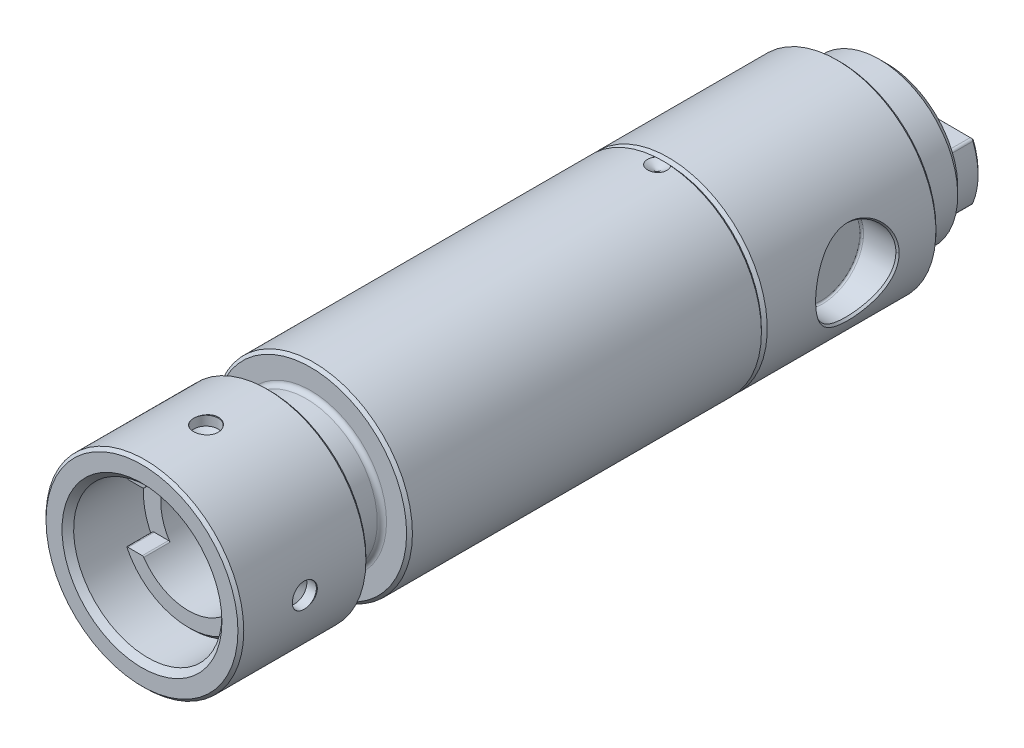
ISO-10303-21;
HEADER;
FILE_DESCRIPTION(('STEP AP214'),'2;1');
FILE_NAME('part.step','',(''),(''),'','','');
FILE_SCHEMA(('AUTOMOTIVE_DESIGN { 1 0 10303 214 1 1 1 1 }'));
ENDSEC;
DATA;
#1=APPLICATION_CONTEXT('core data for automotive mechanical design processes');
#2=APPLICATION_PROTOCOL_DEFINITION('international standard','automotive_design',2000,#1);
#3=PRODUCT_CONTEXT('',#1,'mechanical');
#4=PRODUCT('Part','Part','',(#3));
#5=PRODUCT_RELATED_PRODUCT_CATEGORY('part','',(#4));
#6=PRODUCT_DEFINITION_FORMATION('','',#4);
#7=PRODUCT_DEFINITION_CONTEXT('part definition',#1,'design');
#8=PRODUCT_DEFINITION('design','',#6,#7);
#9=PRODUCT_DEFINITION_SHAPE('','',#8);
#10=(LENGTH_UNIT() NAMED_UNIT(*) SI_UNIT(.MILLI.,.METRE.));
#11=(NAMED_UNIT(*) PLANE_ANGLE_UNIT() SI_UNIT($,.RADIAN.));
#12=(NAMED_UNIT(*) SI_UNIT($,.STERADIAN.) SOLID_ANGLE_UNIT());
#13=UNCERTAINTY_MEASURE_WITH_UNIT(LENGTH_MEASURE(1.E-05),#10,'distance_accuracy_value','');
#14=(GEOMETRIC_REPRESENTATION_CONTEXT(3) GLOBAL_UNCERTAINTY_ASSIGNED_CONTEXT((#13)) GLOBAL_UNIT_ASSIGNED_CONTEXT((#10,
#11,#12)) REPRESENTATION_CONTEXT('',''));
#15=CARTESIAN_POINT('',(0.,0.,0.));
#16=DIRECTION('',(0.,0.,1.));
#17=DIRECTION('',(1.,0.,0.));
#18=AXIS2_PLACEMENT_3D('',#15,#16,#17);
#19=CARTESIAN_POINT('',(0.,0.,-83.));
#20=DIRECTION('',(0.,0.,1.));
#21=DIRECTION('',(0.999989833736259,-0.0045091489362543,0.));
#22=AXIS2_PLACEMENT_3D('',#19,#20,#21);
#23=CONICAL_SURFACE('',#22,9.25,1.02974425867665);
#24=CARTESIAN_POINT('',(0.,0.,-88.5579607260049));
#25=VERTEX_POINT('',#24);
#26=VERTEX_LOOP('',#25);
#27=FACE_BOUND('',#26,.T.);
#28=CARTESIAN_POINT('',(0.,0.,-83.));
#29=DIRECTION('',(0.,0.,1.));
#30=DIRECTION('',(0.999989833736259,-0.0045091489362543,0.));
#31=AXIS2_PLACEMENT_3D('',#28,#29,#30);
#32=CIRCLE('',#31,9.25);
#33=CARTESIAN_POINT('',(9.2499059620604,-0.041709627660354,-83.));
#34=VERTEX_POINT('',#33);
#35=EDGE_CURVE('E1023',#34,#34,#32,.T.);
#36=ORIENTED_EDGE('',*,*,#35,.T.);
#37=EDGE_LOOP('',(#36));
#38=FACE_BOUND('',#37,.T.);
#39=ADVANCED_FACE('F14',(#27,#38),#23,.F.);
#40=CARTESIAN_POINT('',(-17.9770458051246,5.13111334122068,-12.5));
#41=DIRECTION('',(0.0045091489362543,0.999989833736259,0.));
#42=DIRECTION('',(-0.999989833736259,0.0045091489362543,0.));
#43=AXIS2_PLACEMENT_3D('',#40,#41,#42);
#44=PLANE('',#43);
#45=DIRECTION('',(-0.999989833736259,0.0045091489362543,0.));
#46=VECTOR('',#45,1.);
#47=CARTESIAN_POINT('',(-17.9770458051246,5.13111334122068,-12.5));
#48=LINE('',#47,#46);
#49=CARTESIAN_POINT('',(-7.88790055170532,5.08561942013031,-12.5));
#50=VERTEX_POINT('',#49);
#51=CARTESIAN_POINT('',(-10.3337638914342,5.09664829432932,-12.5));
#52=VERTEX_POINT('',#51);
#53=EDGE_CURVE('E866',#50,#52,#48,.T.);
#54=ORIENTED_EDGE('',*,*,#53,.F.);
#55=DIRECTION('',(0.,0.,1.));
#56=VECTOR('',#55,1.);
#57=CARTESIAN_POINT('',(-7.88790055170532,5.08561942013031,-12.5));
#58=LINE('',#57,#56);
#59=CARTESIAN_POINT('',(-7.88790055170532,5.08561942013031,-8.));
#60=VERTEX_POINT('',#59);
#61=EDGE_CURVE('E1863',#50,#60,#58,.T.);
#62=ORIENTED_EDGE('',*,*,#61,.T.);
#63=DIRECTION('',(-0.999989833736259,0.0045091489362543,0.));
#64=VECTOR('',#63,1.);
#65=CARTESIAN_POINT('',(0.0227712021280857,5.04994866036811,-8.));
#66=LINE('',#65,#64);
#67=CARTESIAN_POINT('',(-10.3337638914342,5.09664829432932,-8.));
#68=VERTEX_POINT('',#67);
#69=EDGE_CURVE('E890',#60,#68,#66,.T.);
#70=ORIENTED_EDGE('',*,*,#69,.T.);
#71=DIRECTION('',(0.,0.,1.));
#72=VECTOR('',#71,1.);
#73=CARTESIAN_POINT('',(-10.3337638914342,5.09664829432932,-12.5));
#74=LINE('',#73,#72);
#75=EDGE_CURVE('E1866',#68,#52,#74,.F.);
#76=ORIENTED_EDGE('',*,*,#75,.T.);
#77=EDGE_LOOP('',(#54,#62,#70,#76));
#78=FACE_BOUND('',#77,.T.);
#79=ADVANCED_FACE('F625',(#78),#44,.F.);
#80=CARTESIAN_POINT('',(-7.88654780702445,5.38561637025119,-8.));
#81=DIRECTION('',(0.,0.,1.));
#82=DIRECTION('',(0.999989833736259,-0.0045091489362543,0.));
#83=AXIS2_PLACEMENT_3D('',#80,#81,#82);
#84=CYLINDRICAL_SURFACE('',#83,0.3);
#85=CARTESIAN_POINT('',(-7.88654780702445,5.38561637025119,-12.5));
#86=DIRECTION('',(0.,0.,1.));
#87=DIRECTION('',(0.999989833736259,-0.0045091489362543,0.));
#88=AXIS2_PLACEMENT_3D('',#85,#86,#87);
#89=CIRCLE('',#88,0.3);
#90=CARTESIAN_POINT('',(-7.63880284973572,5.21643470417,-12.5));
#91=VERTEX_POINT('',#90);
#92=EDGE_CURVE('E1050',#91,#50,#89,.F.);
#93=ORIENTED_EDGE('',*,*,#92,.F.);
#94=DIRECTION('',(0.,0.,1.));
#95=VECTOR('',#94,1.);
#96=CARTESIAN_POINT('',(-7.63880284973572,5.21643470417,-8.));
#97=LINE('',#96,#95);
#98=CARTESIAN_POINT('',(-7.63880284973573,5.21643470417,-8.));
#99=VERTEX_POINT('',#98);
#100=EDGE_CURVE('E1039',#99,#91,#97,.F.);
#101=ORIENTED_EDGE('',*,*,#100,.F.);
#102=CARTESIAN_POINT('',(-7.88654780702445,5.38561637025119,-8.));
#103=DIRECTION('',(0.,0.,1.));
#104=DIRECTION('',(0.999989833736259,-0.0045091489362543,0.));
#105=AXIS2_PLACEMENT_3D('',#102,#103,#104);
#106=CIRCLE('',#105,0.3);
#107=EDGE_CURVE('E1048',#60,#99,#106,.T.);
#108=ORIENTED_EDGE('',*,*,#107,.F.);
#109=ORIENTED_EDGE('',*,*,#61,.F.);
#110=EDGE_LOOP('',(#93,#101,#108,#109));
#111=FACE_BOUND('',#110,.T.);
#112=ADVANCED_FACE('F1046',(#111),#84,.T.);
#113=CARTESIAN_POINT('',(-7.93479570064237,-5.31427485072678,-8.));
#114=DIRECTION('',(0.,0.,1.));
#115=DIRECTION('',(0.999989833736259,-0.0045091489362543,0.));
#116=AXIS2_PLACEMENT_3D('',#113,#114,#115);
#117=CYLINDRICAL_SURFACE('',#116,0.3);
#118=CARTESIAN_POINT('',(-7.93479570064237,-5.31427485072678,-8.));
#119=DIRECTION('',(0.,0.,1.));
#120=DIRECTION('',(0.999989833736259,-0.0045091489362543,0.));
#121=AXIS2_PLACEMENT_3D('',#118,#119,#120);
#122=CIRCLE('',#121,0.3);
#123=CARTESIAN_POINT('',(-7.68553510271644,-5.14733427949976,-8.));
#124=VERTEX_POINT('',#123);
#125=CARTESIAN_POINT('',(-7.9334429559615,-5.0142779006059,-8.));
#126=VERTEX_POINT('',#125);
#127=EDGE_CURVE('E1063',#124,#126,#122,.T.);
#128=ORIENTED_EDGE('',*,*,#127,.F.);
#129=DIRECTION('',(0.,0.,1.));
#130=VECTOR('',#129,1.);
#131=CARTESIAN_POINT('',(-7.68553510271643,-5.14733427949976,-8.));
#132=LINE('',#131,#130);
#133=CARTESIAN_POINT('',(-7.68553510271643,-5.14733427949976,-12.5));
#134=VERTEX_POINT('',#133);
#135=EDGE_CURVE('E1056',#134,#124,#132,.T.);
#136=ORIENTED_EDGE('',*,*,#135,.F.);
#137=CARTESIAN_POINT('',(-7.93479570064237,-5.31427485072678,-12.5));
#138=DIRECTION('',(0.,0.,1.));
#139=DIRECTION('',(0.999989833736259,-0.0045091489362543,0.));
#140=AXIS2_PLACEMENT_3D('',#137,#138,#139);
#141=CIRCLE('',#140,0.3);
#142=CARTESIAN_POINT('',(-7.9334429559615,-5.0142779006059,-12.5));
#143=VERTEX_POINT('',#142);
#144=EDGE_CURVE('E1069',#143,#134,#141,.F.);
#145=ORIENTED_EDGE('',*,*,#144,.F.);
#146=DIRECTION('',(0.,0.,1.));
#147=VECTOR('',#146,1.);
#148=CARTESIAN_POINT('',(-7.9334429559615,-5.0142779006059,-12.5));
#149=LINE('',#148,#147);
#150=EDGE_CURVE('E1054',#126,#143,#149,.F.);
#151=ORIENTED_EDGE('',*,*,#150,.F.);
#152=EDGE_LOOP('',(#128,#136,#145,#151));
#153=FACE_BOUND('',#152,.T.);
#154=ADVANCED_FACE('F616',(#153),#117,.T.);
#155=CARTESIAN_POINT('',(-18.0225882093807,-4.96878397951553,-12.5));
#156=DIRECTION('',(-0.0045091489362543,-0.999989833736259,0.));
#157=DIRECTION('',(0.999989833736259,-0.0045091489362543,0.));
#158=AXIS2_PLACEMENT_3D('',#155,#156,#157);
#159=PLANE('',#158);
#160=DIRECTION('',(0.999989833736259,-0.0045091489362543,0.));
#161=VECTOR('',#160,1.);
#162=CARTESIAN_POINT('',(-0.0227712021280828,-5.04994866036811,-8.));
#163=LINE('',#162,#161);
#164=CARTESIAN_POINT('',(-10.3793062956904,-5.0032490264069,-8.));
#165=VERTEX_POINT('',#164);
#166=EDGE_CURVE('E887',#165,#126,#163,.T.);
#167=ORIENTED_EDGE('',*,*,#166,.T.);
#168=ORIENTED_EDGE('',*,*,#150,.T.);
#169=DIRECTION('',(0.999989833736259,-0.0045091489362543,0.));
#170=VECTOR('',#169,1.);
#171=CARTESIAN_POINT('',(-18.0225882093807,-4.96878397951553,-12.5));
#172=LINE('',#171,#170);
#173=CARTESIAN_POINT('',(-10.3793062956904,-5.0032490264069,-12.5));
#174=VERTEX_POINT('',#173);
#175=EDGE_CURVE('E871',#174,#143,#172,.T.);
#176=ORIENTED_EDGE('',*,*,#175,.F.);
#177=DIRECTION('',(0.,0.,1.));
#178=VECTOR('',#177,1.);
#179=CARTESIAN_POINT('',(-10.3793062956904,-5.0032490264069,-12.5));
#180=LINE('',#179,#178);
#181=EDGE_CURVE('E1891',#174,#165,#180,.T.);
#182=ORIENTED_EDGE('',*,*,#181,.T.);
#183=EDGE_LOOP('',(#167,#168,#176,#182));
#184=FACE_BOUND('',#183,.T.);
#185=ADVANCED_FACE('F612',(#184),#159,.F.);
#186=CARTESIAN_POINT('',(0.,0.,-8.));
#187=DIRECTION('',(0.,0.,1.));
#188=DIRECTION('',(0.999989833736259,-0.0045091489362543,0.));
#189=AXIS2_PLACEMENT_3D('',#186,#187,#188);
#190=PLANE('',#189);
#191=CARTESIAN_POINT('',(0.,0.,-8.));
#192=DIRECTION('',(0.,0.,1.));
#193=DIRECTION('',(0.999989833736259,-0.0045091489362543,0.));
#194=AXIS2_PLACEMENT_3D('',#191,#192,#193);
#195=CIRCLE('',#194,9.25);
#196=CARTESIAN_POINT('',(7.63880284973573,-5.21643470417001,-8.));
#197=VERTEX_POINT('',#196);
#198=EDGE_CURVE('E1026',#124,#197,#195,.T.);
#199=ORIENTED_EDGE('',*,*,#198,.F.);
#200=ORIENTED_EDGE('',*,*,#127,.T.);
#201=ORIENTED_EDGE('',*,*,#166,.F.);
#202=CARTESIAN_POINT('',(-10.3815608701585,-5.50324394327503,-8.));
#203=DIRECTION('',(0.,0.,1.));
#204=DIRECTION('',(0.999989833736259,-0.0045091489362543,0.));
#205=AXIS2_PLACEMENT_3D('',#202,#203,#204);
#206=CIRCLE('',#205,0.5);
#207=CARTESIAN_POINT('',(-10.6062891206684,-5.05659283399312,-8.));
#208=VERTEX_POINT('',#207);
#209=EDGE_CURVE('E1892',#165,#208,#206,.T.);
#210=ORIENTED_EDGE('',*,*,#209,.T.);
#211=CARTESIAN_POINT('',(0.,0.,-8.));
#212=DIRECTION('',(0.,0.,1.));
#213=DIRECTION('',(0.999989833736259,-0.0045091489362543,0.));
#214=AXIS2_PLACEMENT_3D('',#211,#212,#213);
#215=CIRCLE('',#214,11.75);
#216=CARTESIAN_POINT('',(10.5602564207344,-5.15203691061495,-8.));
#217=VERTEX_POINT('',#216);
#218=EDGE_CURVE('E1937',#208,#217,#215,.T.);
#219=ORIENTED_EDGE('',*,*,#218,.T.);
#220=CARTESIAN_POINT('',(10.3315093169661,-5.59664321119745,-8.));
#221=DIRECTION('',(0.,0.,1.));
#222=DIRECTION('',(0.999989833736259,-0.0045091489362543,0.));
#223=AXIS2_PLACEMENT_3D('',#220,#221,#222);
#224=CIRCLE('',#223,0.5);
#225=CARTESIAN_POINT('',(10.3337638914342,-5.09664829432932,-8.));
#226=VERTEX_POINT('',#225);
#227=EDGE_CURVE('E1897',#217,#226,#224,.T.);
#228=ORIENTED_EDGE('',*,*,#227,.T.);
#229=CARTESIAN_POINT('',(7.88790055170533,-5.08561942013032,-8.));
#230=VERTEX_POINT('',#229);
#231=EDGE_CURVE('E886',#230,#226,#163,.T.);
#232=ORIENTED_EDGE('',*,*,#231,.F.);
#233=CARTESIAN_POINT('',(7.88654780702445,-5.38561637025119,-8.));
#234=DIRECTION('',(0.,0.,1.));
#235=DIRECTION('',(0.999989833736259,-0.0045091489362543,0.));
#236=AXIS2_PLACEMENT_3D('',#233,#234,#235);
#237=CIRCLE('',#236,0.3);
#238=EDGE_CURVE('E271',#230,#197,#237,.T.);
#239=ORIENTED_EDGE('',*,*,#238,.T.);
#240=EDGE_LOOP('',(#199,#200,#201,#210,#219,#228,#232,#239));
#241=FACE_BOUND('',#240,.T.);
#242=ADVANCED_FACE('F615',(#241),#190,.T.);
#243=CARTESIAN_POINT('',(7.88790055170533,-5.08561942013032,-12.5));
#244=VERTEX_POINT('',#243);
#245=CARTESIAN_POINT('',(10.3337638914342,-5.09664829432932,-12.5));
#246=VERTEX_POINT('',#245);
#247=EDGE_CURVE('E870',#244,#246,#172,.T.);
#248=ORIENTED_EDGE('',*,*,#247,.F.);
#249=DIRECTION('',(0.,0.,1.));
#250=VECTOR('',#249,1.);
#251=CARTESIAN_POINT('',(7.88790055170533,-5.08561942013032,-12.5));
#252=LINE('',#251,#250);
#253=EDGE_CURVE('E1065',#244,#230,#252,.T.);
#254=ORIENTED_EDGE('',*,*,#253,.T.);
#255=ORIENTED_EDGE('',*,*,#231,.T.);
#256=DIRECTION('',(0.,0.,1.));
#257=VECTOR('',#256,1.);
#258=CARTESIAN_POINT('',(10.3337638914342,-5.09664829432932,-12.5));
#259=LINE('',#258,#257);
#260=EDGE_CURVE('E1915',#226,#246,#259,.F.);
#261=ORIENTED_EDGE('',*,*,#260,.T.);
#262=EDGE_LOOP('',(#248,#254,#255,#261));
#263=FACE_BOUND('',#262,.T.);
#264=ADVANCED_FACE('F618',(#263),#159,.F.);
#265=CARTESIAN_POINT('',(7.88654780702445,-5.38561637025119,-8.));
#266=DIRECTION('',(0.,0.,1.));
#267=DIRECTION('',(0.999989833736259,-0.0045091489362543,0.));
#268=AXIS2_PLACEMENT_3D('',#265,#266,#267);
#269=CYLINDRICAL_SURFACE('',#268,0.3);
#270=CARTESIAN_POINT('',(7.88654780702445,-5.38561637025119,-12.5));
#271=DIRECTION('',(0.,0.,1.));
#272=DIRECTION('',(0.999989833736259,-0.0045091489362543,0.));
#273=AXIS2_PLACEMENT_3D('',#270,#271,#272);
#274=CIRCLE('',#273,0.3);
#275=CARTESIAN_POINT('',(7.63880284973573,-5.21643470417,-12.5));
#276=VERTEX_POINT('',#275);
#277=EDGE_CURVE('E18',#276,#244,#274,.F.);
#278=ORIENTED_EDGE('',*,*,#277,.F.);
#279=DIRECTION('',(0.,0.,1.));
#280=VECTOR('',#279,1.);
#281=CARTESIAN_POINT('',(7.63880284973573,-5.21643470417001,-8.));
#282=LINE('',#281,#280);
#283=EDGE_CURVE('E1878',#197,#276,#282,.F.);
#284=ORIENTED_EDGE('',*,*,#283,.F.);
#285=ORIENTED_EDGE('',*,*,#238,.F.);
#286=ORIENTED_EDGE('',*,*,#253,.F.);
#287=EDGE_LOOP('',(#278,#284,#285,#286));
#288=FACE_BOUND('',#287,.T.);
#289=ADVANCED_FACE('F16',(#288),#269,.T.);
#290=CARTESIAN_POINT('',(0.,0.,-8.));
#291=DIRECTION('',(0.,0.,1.));
#292=DIRECTION('',(0.999989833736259,-0.0045091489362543,0.));
#293=AXIS2_PLACEMENT_3D('',#290,#291,#292);
#294=CYLINDRICAL_SURFACE('',#293,9.25);
#295=ORIENTED_EDGE('',*,*,#35,.F.);
#296=EDGE_LOOP('',(#295));
#297=FACE_BOUND('',#296,.T.);
#298=CARTESIAN_POINT('',(7.68553510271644,5.14733427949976,-8.));
#299=VERTEX_POINT('',#298);
#300=EDGE_CURVE('E1028',#299,#99,#195,.T.);
#301=ORIENTED_EDGE('',*,*,#300,.T.);
#302=ORIENTED_EDGE('',*,*,#100,.T.);
#303=CARTESIAN_POINT('',(0.,0.,-12.5));
#304=DIRECTION('',(0.,0.,1.));
#305=DIRECTION('',(0.999989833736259,-0.0045091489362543,0.));
#306=AXIS2_PLACEMENT_3D('',#303,#304,#305);
#307=CIRCLE('',#306,9.25);
#308=EDGE_CURVE('E1030',#91,#134,#307,.T.);
#309=ORIENTED_EDGE('',*,*,#308,.T.);
#310=ORIENTED_EDGE('',*,*,#135,.T.);
#311=ORIENTED_EDGE('',*,*,#198,.T.);
#312=ORIENTED_EDGE('',*,*,#283,.T.);
#313=CARTESIAN_POINT('',(7.68553510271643,5.14733427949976,-12.5));
#314=VERTEX_POINT('',#313);
#315=EDGE_CURVE('E1029',#276,#314,#307,.T.);
#316=ORIENTED_EDGE('',*,*,#315,.T.);
#317=DIRECTION('',(0.,0.,1.));
#318=VECTOR('',#317,1.);
#319=CARTESIAN_POINT('',(7.68553510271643,5.14733427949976,-8.));
#320=LINE('',#319,#318);
#321=EDGE_CURVE('E1042',#314,#299,#320,.T.);
#322=ORIENTED_EDGE('',*,*,#321,.T.);
#323=EDGE_LOOP('',(#301,#302,#309,#310,#311,#312,#316,#322));
#324=FACE_BOUND('',#323,.T.);
#325=ADVANCED_FACE('F1038',(#297,#324),#294,.F.);
#326=CARTESIAN_POINT('',(7.93479570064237,5.31427485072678,-8.));
#327=DIRECTION('',(0.,0.,1.));
#328=DIRECTION('',(0.999989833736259,-0.0045091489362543,0.));
#329=AXIS2_PLACEMENT_3D('',#326,#327,#328);
#330=CYLINDRICAL_SURFACE('',#329,0.3);
#331=CARTESIAN_POINT('',(7.93479570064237,5.31427485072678,-8.));
#332=DIRECTION('',(0.,0.,1.));
#333=DIRECTION('',(0.999989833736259,-0.0045091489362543,0.));
#334=AXIS2_PLACEMENT_3D('',#331,#332,#333);
#335=CIRCLE('',#334,0.3);
#336=CARTESIAN_POINT('',(7.9334429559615,5.0142779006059,-8.));
#337=VERTEX_POINT('',#336);
#338=EDGE_CURVE('E1869',#299,#337,#335,.T.);
#339=ORIENTED_EDGE('',*,*,#338,.F.);
#340=ORIENTED_EDGE('',*,*,#321,.F.);
#341=CARTESIAN_POINT('',(7.93479570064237,5.31427485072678,-12.5));
#342=DIRECTION('',(0.,0.,1.));
#343=DIRECTION('',(0.999989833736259,-0.0045091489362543,0.));
#344=AXIS2_PLACEMENT_3D('',#341,#342,#343);
#345=CIRCLE('',#344,0.3);
#346=CARTESIAN_POINT('',(7.9334429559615,5.0142779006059,-12.5));
#347=VERTEX_POINT('',#346);
#348=EDGE_CURVE('E1068',#347,#314,#345,.F.);
#349=ORIENTED_EDGE('',*,*,#348,.F.);
#350=DIRECTION('',(0.,0.,1.));
#351=VECTOR('',#350,1.);
#352=CARTESIAN_POINT('',(7.9334429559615,5.0142779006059,-12.5));
#353=LINE('',#352,#351);
#354=EDGE_CURVE('E1051',#337,#347,#353,.F.);
#355=ORIENTED_EDGE('',*,*,#354,.F.);
#356=EDGE_LOOP('',(#339,#340,#349,#355));
#357=FACE_BOUND('',#356,.T.);
#358=ADVANCED_FACE('F623',(#357),#330,.T.);
#359=CARTESIAN_POINT('',(10.3793062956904,5.00324902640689,-8.));
#360=VERTEX_POINT('',#359);
#361=EDGE_CURVE('E891',#360,#337,#66,.T.);
#362=ORIENTED_EDGE('',*,*,#361,.T.);
#363=ORIENTED_EDGE('',*,*,#354,.T.);
#364=CARTESIAN_POINT('',(10.3793062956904,5.00324902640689,-12.5));
#365=VERTEX_POINT('',#364);
#366=EDGE_CURVE('E867',#365,#347,#48,.T.);
#367=ORIENTED_EDGE('',*,*,#366,.F.);
#368=DIRECTION('',(0.,0.,1.));
#369=VECTOR('',#368,1.);
#370=CARTESIAN_POINT('',(10.3793062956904,5.00324902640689,-12.5));
#371=LINE('',#370,#369);
#372=EDGE_CURVE('E1988',#365,#360,#371,.T.);
#373=ORIENTED_EDGE('',*,*,#372,.T.);
#374=EDGE_LOOP('',(#362,#363,#367,#373));
#375=FACE_BOUND('',#374,.T.);
#376=ADVANCED_FACE('F619',(#375),#44,.F.);
#377=ORIENTED_EDGE('',*,*,#69,.F.);
#378=ORIENTED_EDGE('',*,*,#107,.T.);
#379=ORIENTED_EDGE('',*,*,#300,.F.);
#380=ORIENTED_EDGE('',*,*,#338,.T.);
#381=ORIENTED_EDGE('',*,*,#361,.F.);
#382=CARTESIAN_POINT('',(10.3815608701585,5.50324394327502,-8.));
#383=DIRECTION('',(0.,0.,1.));
#384=DIRECTION('',(0.999989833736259,-0.0045091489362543,0.));
#385=AXIS2_PLACEMENT_3D('',#382,#383,#384);
#386=CIRCLE('',#385,0.5);
#387=CARTESIAN_POINT('',(10.6062891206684,5.05659283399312,-8.));
#388=VERTEX_POINT('',#387);
#389=EDGE_CURVE('E1997',#360,#388,#386,.T.);
#390=ORIENTED_EDGE('',*,*,#389,.T.);
#391=CARTESIAN_POINT('',(0.,0.,-8.));
#392=DIRECTION('',(0.,0.,1.));
#393=DIRECTION('',(0.999989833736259,-0.0045091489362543,0.));
#394=AXIS2_PLACEMENT_3D('',#391,#392,#393);
#395=CIRCLE('',#394,11.75);
#396=CARTESIAN_POINT('',(-10.5602564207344,5.15203691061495,-8.));
#397=VERTEX_POINT('',#396);
#398=EDGE_CURVE('E1944',#388,#397,#395,.T.);
#399=ORIENTED_EDGE('',*,*,#398,.T.);
#400=CARTESIAN_POINT('',(-10.3315093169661,5.59664321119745,-8.));
#401=DIRECTION('',(0.,0.,1.));
#402=DIRECTION('',(0.999989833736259,-0.0045091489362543,0.));
#403=AXIS2_PLACEMENT_3D('',#400,#401,#402);
#404=CIRCLE('',#403,0.5);
#405=EDGE_CURVE('E1995',#397,#68,#404,.T.);
#406=ORIENTED_EDGE('',*,*,#405,.T.);
#407=EDGE_LOOP('',(#377,#378,#379,#380,#381,#390,#399,#406));
#408=FACE_BOUND('',#407,.T.);
#409=ADVANCED_FACE('F622',(#408),#190,.T.);
#410=CARTESIAN_POINT('',(-10.3315093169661,5.59664321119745,-90.5));
#411=DIRECTION('',(0.,0.,1.));
#412=DIRECTION('',(0.999989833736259,-0.0045091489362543,0.));
#413=AXIS2_PLACEMENT_3D('',#410,#411,#412);
#414=CYLINDRICAL_SURFACE('',#413,0.5);
#415=CARTESIAN_POINT('',(-10.7711480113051,5.83479824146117,-8.5));
#416=CARTESIAN_POINT('',(-10.781980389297,5.81488041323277,-8.50003514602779));
#417=CARTESIAN_POINT('',(-10.7913677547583,5.79424000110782,-8.49852332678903));
#418=CARTESIAN_POINT('',(-10.807139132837,5.75240449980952,-8.49270977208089));
#419=CARTESIAN_POINT('',(-10.8135469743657,5.73121529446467,-8.48843085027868));
#420=CARTESIAN_POINT('',(-10.8234114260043,5.68887790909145,-8.4773922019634));
#421=CARTESIAN_POINT('',(-10.8268753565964,5.66772975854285,-8.47063868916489));
#422=CARTESIAN_POINT('',(-10.8310949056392,5.62591233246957,-8.45504507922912));
#423=CARTESIAN_POINT('',(-10.8318447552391,5.60524416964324,-8.44620058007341));
#424=CARTESIAN_POINT('',(-10.8307222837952,5.55700107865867,-8.42309325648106));
#425=CARTESIAN_POINT('',(-10.8277315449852,5.5298242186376,-8.4080543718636));
#426=CARTESIAN_POINT('',(-10.8178772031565,5.47767556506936,-8.37563211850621));
#427=CARTESIAN_POINT('',(-10.8110072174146,5.4527074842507,-8.35824492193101));
#428=CARTESIAN_POINT('',(-10.7909814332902,5.39645469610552,-8.31509143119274));
#429=CARTESIAN_POINT('',(-10.7764430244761,5.36622471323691,-8.28859552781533));
#430=CARTESIAN_POINT('',(-10.7427784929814,5.31042195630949,-8.23363748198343));
#431=CARTESIAN_POINT('',(-10.7236409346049,5.28486107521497,-8.20517056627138));
#432=CARTESIAN_POINT('',(-10.681972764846,5.23868462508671,-8.14740397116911));
#433=CARTESIAN_POINT('',(-10.6594782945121,5.21802181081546,-8.1181155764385));
#434=CARTESIAN_POINT('',(-10.6117678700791,5.18150176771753,-8.05921543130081));
#435=CARTESIAN_POINT('',(-10.5865740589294,5.16560897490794,-8.02960787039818));
#436=CARTESIAN_POINT('',(-10.5602564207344,5.15203691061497,-8.));
#437=B_SPLINE_CURVE_WITH_KNOTS('',3,(#415,#416,#417,#418,#419,#420,#421,#422,#423,#424,#425,
#426,#427,#428,#429,#430,#431,#432,#433,#434,#435,#436),.UNSPECIFIED.,.F.,.F.,(4,2,2,2,2,2,2,2,
2,2,4),(0.,0.0678296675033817,0.135107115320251,0.20221677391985,0.269468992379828,
0.362565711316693,0.455816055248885,0.583366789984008,0.711238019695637,0.837820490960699,
0.963434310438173),.UNSPECIFIED.);
#438=CARTESIAN_POINT('',(-10.7711480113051,5.83479824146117,-8.5));
#439=VERTEX_POINT('',#438);
#440=EDGE_CURVE('E784',#439,#397,#437,.T.);
#441=ORIENTED_EDGE('',*,*,#440,.F.);
#442=DIRECTION('',(0.,0.,1.));
#443=VECTOR('',#442,1.);
#444=CARTESIAN_POINT('',(-10.7711480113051,5.83479824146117,-90.5));
#445=LINE('',#444,#443);
#446=CARTESIAN_POINT('',(-10.7711480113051,5.83479824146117,-12.5));
#447=VERTEX_POINT('',#446);
#448=EDGE_CURVE('E1904',#447,#439,#445,.T.);
#449=ORIENTED_EDGE('',*,*,#448,.F.);
#450=CARTESIAN_POINT('',(-10.3315093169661,5.59664321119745,-12.5));
#451=DIRECTION('',(0.,0.,1.));
#452=DIRECTION('',(0.999989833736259,-0.0045091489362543,0.));
#453=AXIS2_PLACEMENT_3D('',#450,#451,#452);
#454=CIRCLE('',#453,0.5);
#455=EDGE_CURVE('E1873',#52,#447,#454,.F.);
#456=ORIENTED_EDGE('',*,*,#455,.F.);
#457=ORIENTED_EDGE('',*,*,#75,.F.);
#458=ORIENTED_EDGE('',*,*,#405,.F.);
#459=EDGE_LOOP('',(#441,#449,#456,#457,#458));
#460=FACE_BOUND('',#459,.T.);
#461=ADVANCED_FACE('F1650',(#460),#414,.T.);
#462=CARTESIAN_POINT('',(-17.9770458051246,5.13111334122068,-12.5));
#463=DIRECTION('',(0.,0.,1.));
#464=DIRECTION('',(0.999989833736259,-0.0045091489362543,0.));
#465=AXIS2_PLACEMENT_3D('',#462,#463,#464);
#466=PLANE('',#465);
#467=CARTESIAN_POINT('',(0.,0.,-12.5));
#468=DIRECTION('',(0.,0.,1.));
#469=DIRECTION('',(0.999989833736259,-0.0045091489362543,0.));
#470=AXIS2_PLACEMENT_3D('',#467,#468,#469);
#471=CIRCLE('',#470,12.25);
#472=CARTESIAN_POINT('',(-10.8233294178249,-5.73742453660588,-12.5));
#473=VERTEX_POINT('',#472);
#474=EDGE_CURVE('E983',#473,#447,#471,.F.);
#475=ORIENTED_EDGE('',*,*,#474,.F.);
#476=CARTESIAN_POINT('',(-10.3815608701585,-5.50324394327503,-12.5));
#477=DIRECTION('',(0.,0.,1.));
#478=DIRECTION('',(0.999989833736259,-0.0045091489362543,0.));
#479=AXIS2_PLACEMENT_3D('',#476,#477,#478);
#480=CIRCLE('',#479,0.5);
#481=EDGE_CURVE('E1870',#473,#174,#480,.F.);
#482=ORIENTED_EDGE('',*,*,#481,.T.);
#483=ORIENTED_EDGE('',*,*,#175,.T.);
#484=ORIENTED_EDGE('',*,*,#144,.T.);
#485=ORIENTED_EDGE('',*,*,#308,.F.);
#486=ORIENTED_EDGE('',*,*,#92,.T.);
#487=ORIENTED_EDGE('',*,*,#53,.T.);
#488=ORIENTED_EDGE('',*,*,#455,.T.);
#489=EDGE_LOOP('',(#475,#482,#483,#484,#485,#486,#487,#488));
#490=FACE_BOUND('',#489,.T.);
#491=ADVANCED_FACE('F611',(#490),#466,.T.);
#492=CARTESIAN_POINT('',(-10.3815608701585,-5.50324394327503,-90.5));
#493=DIRECTION('',(0.,0.,1.));
#494=DIRECTION('',(0.999989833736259,-0.0045091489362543,0.));
#495=AXIS2_PLACEMENT_3D('',#492,#493,#494);
#496=CYLINDRICAL_SURFACE('',#495,0.5);
#497=ORIENTED_EDGE('',*,*,#481,.F.);
#498=DIRECTION('',(0.,0.,1.));
#499=VECTOR('',#498,1.);
#500=CARTESIAN_POINT('',(-10.8233294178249,-5.73742453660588,-90.5));
#501=LINE('',#500,#499);
#502=CARTESIAN_POINT('',(-10.8233294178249,-5.73742453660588,-8.5));
#503=VERTEX_POINT('',#502);
#504=EDGE_CURVE('E783',#503,#473,#501,.F.);
#505=ORIENTED_EDGE('',*,*,#504,.F.);
#506=CARTESIAN_POINT('',(-10.6062891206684,-5.05659283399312,-8.));
#507=CARTESIAN_POINT('',(-10.6232986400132,-5.06515893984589,-8.01904068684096));
#508=CARTESIAN_POINT('',(-10.6398251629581,-5.07468453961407,-8.03805740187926));
#509=CARTESIAN_POINT('',(-10.671819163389,-5.09566760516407,-8.07596907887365));
#510=CARTESIAN_POINT('',(-10.6872850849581,-5.1071278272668,-8.09486382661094));
#511=CARTESIAN_POINT('',(-10.732127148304,-5.14459485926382,-8.15148336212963));
#512=CARTESIAN_POINT('',(-10.7596607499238,-5.17354586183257,-8.18882348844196));
#513=CARTESIAN_POINT('',(-10.8008339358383,-5.22933268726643,-8.25015676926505));
#514=CARTESIAN_POINT('',(-10.8161673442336,-5.25421889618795,-8.27480608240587));
#515=CARTESIAN_POINT('',(-10.842709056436,-5.30772021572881,-8.32211249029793));
#516=CARTESIAN_POINT('',(-10.8539314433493,-5.33632213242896,-8.34477618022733));
#517=CARTESIAN_POINT('',(-10.869027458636,-5.38949772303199,-8.38186451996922));
#518=CARTESIAN_POINT('',(-10.8740357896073,-5.41329723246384,-8.39693436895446));
#519=CARTESIAN_POINT('',(-10.8805305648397,-5.46266257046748,-8.42481842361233));
#520=CARTESIAN_POINT('',(-10.8820202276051,-5.48822676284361,-8.43763468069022));
#521=CARTESIAN_POINT('',(-10.8809674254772,-5.535424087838,-8.4580306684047));
#522=CARTESIAN_POINT('',(-10.8791605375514,-5.55684119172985,-8.46614455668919));
#523=CARTESIAN_POINT('',(-10.8725975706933,-5.59997347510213,-8.47998999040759));
#524=CARTESIAN_POINT('',(-10.8678478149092,-5.6216879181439,-8.48572659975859));
#525=CARTESIAN_POINT('',(-10.8568782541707,-5.65929921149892,-8.49333305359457));
#526=CARTESIAN_POINT('',(-10.8513381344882,-5.67527299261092,-8.49581491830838));
#527=CARTESIAN_POINT('',(-10.8385812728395,-5.70677595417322,-8.49915685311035));
#528=CARTESIAN_POINT('',(-10.8313587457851,-5.7223033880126,-8.50001123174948));
#529=CARTESIAN_POINT('',(-10.8233294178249,-5.73742453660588,-8.5));
#530=B_SPLINE_CURVE_WITH_KNOTS('',3,(#506,#507,#508,#509,#510,#511,#512,#513,#514,#515,#516,
#517,#518,#519,#520,#521,#522,#523,#524,#525,#526,#527,#528,#529),.UNSPECIFIED.,.F.,.F.,(4,2,2,
2,2,2,2,2,2,2,2,4),(0.,0.080733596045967,0.161583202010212,0.324624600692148,0.438983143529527,
0.552946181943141,0.638489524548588,0.7239545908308,0.792606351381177,0.861111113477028,
0.912218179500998,0.963503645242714),.UNSPECIFIED.);
#531=EDGE_CURVE('E1918',#208,#503,#530,.T.);
#532=ORIENTED_EDGE('',*,*,#531,.F.);
#533=ORIENTED_EDGE('',*,*,#209,.F.);
#534=ORIENTED_EDGE('',*,*,#181,.F.);
#535=EDGE_LOOP('',(#497,#505,#532,#533,#534));
#536=FACE_BOUND('',#535,.T.);
#537=ADVANCED_FACE('F1632',(#536),#496,.T.);
#538=CARTESIAN_POINT('',(0.,0.,-8.));
#539=DIRECTION('',(0.,0.,-1.));
#540=DIRECTION('',(-0.999989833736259,0.0045091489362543,0.));
#541=AXIS2_PLACEMENT_3D('',#538,#539,#540);
#542=CONICAL_SURFACE('',#541,11.75,0.785398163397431);
#543=CARTESIAN_POINT('',(0.,0.,-8.5));
#544=DIRECTION('',(0.,0.,1.));
#545=DIRECTION('',(0.999989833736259,-0.0045091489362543,0.));
#546=AXIS2_PLACEMENT_3D('',#543,#544,#545);
#547=CIRCLE('',#546,12.25);
#548=CARTESIAN_POINT('',(10.7711480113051,-5.83479824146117,-8.5));
#549=VERTEX_POINT('',#548);
#550=EDGE_CURVE('E1943',#549,#503,#547,.F.);
#551=ORIENTED_EDGE('',*,*,#550,.F.);
#552=CARTESIAN_POINT('',(10.7711480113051,-5.83479824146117,-8.5));
#553=CARTESIAN_POINT('',(10.781980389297,-5.81488041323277,-8.50003514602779));
#554=CARTESIAN_POINT('',(10.7913677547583,-5.79424000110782,-8.49852332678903));
#555=CARTESIAN_POINT('',(10.807139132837,-5.75240449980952,-8.49270977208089));
#556=CARTESIAN_POINT('',(10.8135469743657,-5.73121529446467,-8.48843085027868));
#557=CARTESIAN_POINT('',(10.8234114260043,-5.68887790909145,-8.4773922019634));
#558=CARTESIAN_POINT('',(10.8268753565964,-5.66772975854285,-8.47063868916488));
#559=CARTESIAN_POINT('',(10.8310949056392,-5.62591233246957,-8.45504507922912));
#560=CARTESIAN_POINT('',(10.8318447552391,-5.60524416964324,-8.44620058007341));
#561=CARTESIAN_POINT('',(10.8307222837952,-5.55700107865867,-8.42309325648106));
#562=CARTESIAN_POINT('',(10.8277315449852,-5.5298242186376,-8.4080543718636));
#563=CARTESIAN_POINT('',(10.8178772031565,-5.47767556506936,-8.37563211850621));
#564=CARTESIAN_POINT('',(10.8110072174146,-5.45270748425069,-8.35824492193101));
#565=CARTESIAN_POINT('',(10.7909814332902,-5.39645469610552,-8.31509143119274));
#566=CARTESIAN_POINT('',(10.7764430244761,-5.36622471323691,-8.28859552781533));
#567=CARTESIAN_POINT('',(10.7427784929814,-5.31042195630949,-8.23363748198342));
#568=CARTESIAN_POINT('',(10.7236409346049,-5.28486107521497,-8.20517056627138));
#569=CARTESIAN_POINT('',(10.681972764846,-5.23868462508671,-8.14740397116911));
#570=CARTESIAN_POINT('',(10.6594782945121,-5.21802181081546,-8.1181155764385));
#571=CARTESIAN_POINT('',(10.6117678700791,-5.18150176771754,-8.05921543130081));
#572=CARTESIAN_POINT('',(10.5865740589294,-5.16560897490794,-8.02960787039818));
#573=CARTESIAN_POINT('',(10.5602564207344,-5.15203691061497,-8.));
#574=B_SPLINE_CURVE_WITH_KNOTS('',3,(#552,#553,#554,#555,#556,#557,#558,#559,#560,#561,#562,
#563,#564,#565,#566,#567,#568,#569,#570,#571,#572,#573),.UNSPECIFIED.,.F.,.F.,(4,2,2,2,2,2,2,2,
2,2,4),(0.,0.0678296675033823,0.135107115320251,0.202216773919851,0.269468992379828,
0.362565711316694,0.455816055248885,0.583366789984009,0.711238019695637,0.8378204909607,
0.963434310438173),.UNSPECIFIED.);
#575=EDGE_CURVE('E1924',#549,#217,#574,.T.);
#576=ORIENTED_EDGE('',*,*,#575,.T.);
#577=ORIENTED_EDGE('',*,*,#218,.F.);
#578=ORIENTED_EDGE('',*,*,#531,.T.);
#579=EDGE_LOOP('',(#551,#576,#577,#578));
#580=FACE_BOUND('',#579,.T.);
#581=ADVANCED_FACE('F797',(#580),#542,.T.);
#582=CARTESIAN_POINT('',(10.3315093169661,-5.59664321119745,-90.5));
#583=DIRECTION('',(0.,0.,1.));
#584=DIRECTION('',(0.999989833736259,-0.0045091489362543,0.));
#585=AXIS2_PLACEMENT_3D('',#582,#583,#584);
#586=CYLINDRICAL_SURFACE('',#585,0.5);
#587=ORIENTED_EDGE('',*,*,#575,.F.);
#588=DIRECTION('',(0.,0.,1.));
#589=VECTOR('',#588,1.);
#590=CARTESIAN_POINT('',(10.7711480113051,-5.83479824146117,-90.5));
#591=LINE('',#590,#589);
#592=CARTESIAN_POINT('',(10.7711480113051,-5.83479824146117,-12.5));
#593=VERTEX_POINT('',#592);
#594=EDGE_CURVE('E1909',#593,#549,#591,.T.);
#595=ORIENTED_EDGE('',*,*,#594,.F.);
#596=CARTESIAN_POINT('',(10.3315093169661,-5.59664321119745,-12.5));
#597=DIRECTION('',(0.,0.,1.));
#598=DIRECTION('',(0.999989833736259,-0.0045091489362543,0.));
#599=AXIS2_PLACEMENT_3D('',#596,#597,#598);
#600=CIRCLE('',#599,0.5);
#601=EDGE_CURVE('E1895',#246,#593,#600,.F.);
#602=ORIENTED_EDGE('',*,*,#601,.F.);
#603=ORIENTED_EDGE('',*,*,#260,.F.);
#604=ORIENTED_EDGE('',*,*,#227,.F.);
#605=EDGE_LOOP('',(#587,#595,#602,#603,#604));
#606=FACE_BOUND('',#605,.T.);
#607=ADVANCED_FACE('F610',(#606),#586,.T.);
#608=CARTESIAN_POINT('',(0.,0.,-12.5));
#609=DIRECTION('',(0.,0.,1.));
#610=DIRECTION('',(0.999989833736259,-0.0045091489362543,0.));
#611=AXIS2_PLACEMENT_3D('',#608,#609,#610);
#612=CIRCLE('',#611,12.25);
#613=CARTESIAN_POINT('',(10.8233294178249,5.73742453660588,-12.5));
#614=VERTEX_POINT('',#613);
#615=EDGE_CURVE('E986',#614,#593,#612,.F.);
#616=ORIENTED_EDGE('',*,*,#615,.F.);
#617=CARTESIAN_POINT('',(10.3815608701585,5.50324394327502,-12.5));
#618=DIRECTION('',(0.,0.,1.));
#619=DIRECTION('',(0.999989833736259,-0.0045091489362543,0.));
#620=AXIS2_PLACEMENT_3D('',#617,#618,#619);
#621=CIRCLE('',#620,0.5);
#622=EDGE_CURVE('E1893',#614,#365,#621,.F.);
#623=ORIENTED_EDGE('',*,*,#622,.T.);
#624=ORIENTED_EDGE('',*,*,#366,.T.);
#625=ORIENTED_EDGE('',*,*,#348,.T.);
#626=ORIENTED_EDGE('',*,*,#315,.F.);
#627=ORIENTED_EDGE('',*,*,#277,.T.);
#628=ORIENTED_EDGE('',*,*,#247,.T.);
#629=ORIENTED_EDGE('',*,*,#601,.T.);
#630=EDGE_LOOP('',(#616,#623,#624,#625,#626,#627,#628,#629));
#631=FACE_BOUND('',#630,.T.);
#632=ADVANCED_FACE('F606',(#631),#466,.T.);
#633=CARTESIAN_POINT('',(10.3815608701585,5.50324394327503,-90.5));
#634=DIRECTION('',(0.,0.,1.));
#635=DIRECTION('',(0.999989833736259,-0.0045091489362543,0.));
#636=AXIS2_PLACEMENT_3D('',#633,#634,#635);
#637=CYLINDRICAL_SURFACE('',#636,0.5);
#638=ORIENTED_EDGE('',*,*,#622,.F.);
#639=DIRECTION('',(0.,0.,1.));
#640=VECTOR('',#639,1.);
#641=CARTESIAN_POINT('',(10.8233294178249,5.73742453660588,-90.5));
#642=LINE('',#641,#640);
#643=CARTESIAN_POINT('',(10.8233294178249,5.73742453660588,-8.5));
#644=VERTEX_POINT('',#643);
#645=EDGE_CURVE('E1910',#644,#614,#642,.F.);
#646=ORIENTED_EDGE('',*,*,#645,.F.);
#647=CARTESIAN_POINT('',(10.6062891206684,5.05659283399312,-8.));
#648=CARTESIAN_POINT('',(10.6232986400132,5.06515893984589,-8.01904068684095));
#649=CARTESIAN_POINT('',(10.6398251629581,5.07468453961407,-8.03805740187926));
#650=CARTESIAN_POINT('',(10.671819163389,5.09566760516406,-8.07596907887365));
#651=CARTESIAN_POINT('',(10.6872850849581,5.1071278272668,-8.09486382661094));
#652=CARTESIAN_POINT('',(10.732127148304,5.14459485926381,-8.15148336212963));
#653=CARTESIAN_POINT('',(10.7596607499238,5.17354586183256,-8.18882348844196));
#654=CARTESIAN_POINT('',(10.8008339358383,5.22933268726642,-8.25015676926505));
#655=CARTESIAN_POINT('',(10.8161673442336,5.25421889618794,-8.27480608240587));
#656=CARTESIAN_POINT('',(10.842709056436,5.3077202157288,-8.32211249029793));
#657=CARTESIAN_POINT('',(10.8539314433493,5.33632213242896,-8.34477618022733));
#658=CARTESIAN_POINT('',(10.869027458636,5.38949772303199,-8.38186451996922));
#659=CARTESIAN_POINT('',(10.8740357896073,5.41329723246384,-8.39693436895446));
#660=CARTESIAN_POINT('',(10.8805305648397,5.46266257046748,-8.42481842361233));
#661=CARTESIAN_POINT('',(10.8820202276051,5.48822676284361,-8.43763468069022));
#662=CARTESIAN_POINT('',(10.8809674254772,5.535424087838,-8.4580306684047));
#663=CARTESIAN_POINT('',(10.8791605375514,5.55684119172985,-8.46614455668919));
#664=CARTESIAN_POINT('',(10.8725975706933,5.59997347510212,-8.47998999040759));
#665=CARTESIAN_POINT('',(10.8678478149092,5.62168791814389,-8.48572659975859));
#666=CARTESIAN_POINT('',(10.8568782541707,5.65929921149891,-8.49333305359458));
#667=CARTESIAN_POINT('',(10.8513381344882,5.67527299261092,-8.49581491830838));
#668=CARTESIAN_POINT('',(10.8385812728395,5.70677595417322,-8.49915685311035));
#669=CARTESIAN_POINT('',(10.8313587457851,5.7223033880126,-8.50001123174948));
#670=CARTESIAN_POINT('',(10.8233294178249,5.73742453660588,-8.5));
#671=B_SPLINE_CURVE_WITH_KNOTS('',3,(#647,#648,#649,#650,#651,#652,#653,#654,#655,#656,#657,
#658,#659,#660,#661,#662,#663,#664,#665,#666,#667,#668,#669,#670),.UNSPECIFIED.,.F.,.F.,(4,2,2,
2,2,2,2,2,2,2,2,4),(0.,0.0807335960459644,0.161583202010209,0.324624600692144,0.438983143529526,
0.552946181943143,0.638489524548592,0.723954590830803,0.792606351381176,0.861111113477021,
0.912218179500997,0.963503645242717),.UNSPECIFIED.);
#672=EDGE_CURVE('E775',#388,#644,#671,.T.);
#673=ORIENTED_EDGE('',*,*,#672,.F.);
#674=ORIENTED_EDGE('',*,*,#389,.F.);
#675=ORIENTED_EDGE('',*,*,#372,.F.);
#676=EDGE_LOOP('',(#638,#646,#673,#674,#675));
#677=FACE_BOUND('',#676,.T.);
#678=ADVANCED_FACE('F609',(#677),#637,.T.);
#679=CARTESIAN_POINT('',(0.,0.,-8.));
#680=DIRECTION('',(0.,0.,-1.));
#681=DIRECTION('',(-0.999989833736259,0.0045091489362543,0.));
#682=AXIS2_PLACEMENT_3D('',#679,#680,#681);
#683=CONICAL_SURFACE('',#682,11.75,0.785398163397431);
#684=ORIENTED_EDGE('',*,*,#398,.F.);
#685=ORIENTED_EDGE('',*,*,#672,.T.);
#686=CARTESIAN_POINT('',(0.,0.,-8.5));
#687=DIRECTION('',(0.,0.,1.));
#688=DIRECTION('',(0.999989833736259,-0.0045091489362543,0.));
#689=AXIS2_PLACEMENT_3D('',#686,#687,#688);
#690=CIRCLE('',#689,12.25);
#691=EDGE_CURVE('E1945',#439,#644,#690,.F.);
#692=ORIENTED_EDGE('',*,*,#691,.F.);
#693=ORIENTED_EDGE('',*,*,#440,.T.);
#694=EDGE_LOOP('',(#684,#685,#692,#693));
#695=FACE_BOUND('',#694,.T.);
#696=ADVANCED_FACE('F770',(#695),#683,.T.);
#697=CARTESIAN_POINT('',(0.,0.,-90.5));
#698=DIRECTION('',(0.,0.,1.));
#699=DIRECTION('',(0.999989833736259,-0.0045091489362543,0.));
#700=AXIS2_PLACEMENT_3D('',#697,#698,#699);
#701=CYLINDRICAL_SURFACE('',#700,12.25);
#702=CARTESIAN_POINT('',(0.,0.,-13.));
#703=DIRECTION('',(0.,0.,1.));
#704=DIRECTION('',(0.999989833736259,-0.0045091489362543,0.));
#705=AXIS2_PLACEMENT_3D('',#702,#703,#704);
#706=CIRCLE('',#705,12.25);
#707=CARTESIAN_POINT('',(12.2498754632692,-0.0552370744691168,-13.));
#708=VERTEX_POINT('',#707);
#709=EDGE_CURVE('E981',#708,#708,#706,.T.);
#710=ORIENTED_EDGE('',*,*,#709,.T.);
#711=EDGE_LOOP('',(#710));
#712=FACE_BOUND('',#711,.T.);
#713=ORIENTED_EDGE('',*,*,#691,.T.);
#714=ORIENTED_EDGE('',*,*,#645,.T.);
#715=ORIENTED_EDGE('',*,*,#615,.T.);
#716=ORIENTED_EDGE('',*,*,#594,.T.);
#717=ORIENTED_EDGE('',*,*,#550,.T.);
#718=ORIENTED_EDGE('',*,*,#504,.T.);
#719=ORIENTED_EDGE('',*,*,#474,.T.);
#720=ORIENTED_EDGE('',*,*,#448,.T.);
#721=EDGE_LOOP('',(#713,#714,#715,#716,#717,#718,#719,#720));
#722=FACE_BOUND('',#721,.T.);
#723=ADVANCED_FACE('F795',(#712,#722),#701,.T.);
#724=CARTESIAN_POINT('',(0.,0.,-14.25));
#725=DIRECTION('',(0.,0.,-1.));
#726=DIRECTION('',(-0.999989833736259,0.0045091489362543,0.));
#727=AXIS2_PLACEMENT_3D('',#724,#725,#726);
#728=CONICAL_SURFACE('',#727,13.5,0.785398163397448);
#729=CARTESIAN_POINT('',(0.,0.,-13.5));
#730=DIRECTION('',(0.,0.,-1.));
#731=DIRECTION('',(0.,1.,0.));
#732=AXIS2_PLACEMENT_3D('',#729,#730,#731);
#733=CIRCLE('',#732,12.75);
#734=CARTESIAN_POINT('',(0.,12.75,-13.5));
#735=VERTEX_POINT('',#734);
#736=EDGE_CURVE('E24',#735,#735,#733,.T.);
#737=ORIENTED_EDGE('',*,*,#736,.F.);
#738=EDGE_LOOP('',(#737));
#739=FACE_BOUND('',#738,.T.);
#740=ORIENTED_EDGE('',*,*,#709,.F.);
#741=EDGE_LOOP('',(#740));
#742=FACE_BOUND('',#741,.T.);
#743=ADVANCED_FACE('F975',(#739,#742),#728,.T.);
#744=CARTESIAN_POINT('',(-1.94140818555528E-05,-0.00430544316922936,-128.));
#745=DIRECTION('',(0.,0.,-1.));
#746=DIRECTION('',(-0.999989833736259,0.0045091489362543,0.));
#747=AXIS2_PLACEMENT_3D('',#744,#745,#746);
#748=PLANE('',#747);
#749=CARTESIAN_POINT('',(0.,0.,-128.));
#750=DIRECTION('',(0.,0.,-1.));
#751=DIRECTION('',(-0.999989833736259,0.0045091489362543,0.));
#752=AXIS2_PLACEMENT_3D('',#749,#750,#751);
#753=CIRCLE('',#752,12.25);
#754=CARTESIAN_POINT('',(-11.3183174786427,4.6859566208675,-128.));
#755=VERTEX_POINT('',#754);
#756=CARTESIAN_POINT('',(11.3601161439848,4.58369514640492,-128.));
#757=VERTEX_POINT('',#756);
#758=EDGE_CURVE('E852',#755,#757,#753,.T.);
#759=ORIENTED_EDGE('',*,*,#758,.T.);
#760=CARTESIAN_POINT('',(10.8964379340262,4.39660554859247,-128.));
#761=DIRECTION('',(0.,0.,-1.));
#762=DIRECTION('',(-0.999989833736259,0.0045091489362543,0.));
#763=AXIS2_PLACEMENT_3D('',#760,#761,#762);
#764=CIRCLE('',#763,0.5);
#765=CARTESIAN_POINT('',(10.8986925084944,4.8966004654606,-128.));
#766=VERTEX_POINT('',#765);
#767=EDGE_CURVE('E1990',#757,#766,#764,.F.);
#768=ORIENTED_EDGE('',*,*,#767,.T.);
#769=DIRECTION('',(-0.999989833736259,0.00450914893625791,0.));
#770=VECTOR('',#769,1.);
#771=CARTESIAN_POINT('',(16.2562214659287,4.87244232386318,-128.));
#772=LINE('',#771,#770);
#773=CARTESIAN_POINT('',(-10.8540907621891,4.99468800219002,-128.));
#774=VERTEX_POINT('',#773);
#775=EDGE_CURVE('E863',#766,#774,#772,.T.);
#776=ORIENTED_EDGE('',*,*,#775,.T.);
#777=CARTESIAN_POINT('',(-10.8563453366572,4.49469308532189,-128.));
#778=DIRECTION('',(0.,0.,-1.));
#779=DIRECTION('',(-0.999989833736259,0.0045091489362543,0.));
#780=AXIS2_PLACEMENT_3D('',#777,#778,#779);
#781=CIRCLE('',#780,0.5);
#782=EDGE_CURVE('E1986',#774,#755,#781,.F.);
#783=ORIENTED_EDGE('',*,*,#782,.T.);
#784=EDGE_LOOP('',(#759,#768,#776,#783));
#785=FACE_BOUND('',#784,.T.);
#786=ADVANCED_FACE('F598',(#785),#748,.T.);
#787=CARTESIAN_POINT('',(0.,0.,-8.));
#788=DIRECTION('',(0.,0.,-1.));
#789=DIRECTION('',(-0.999989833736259,0.0045091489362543,0.));
#790=AXIS2_PLACEMENT_3D('',#787,#788,#789);
#791=CYLINDRICAL_SURFACE('',#790,17.);
#792=CARTESIAN_POINT('',(16.9998271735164,-0.0766555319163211,-113.17786070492));
#793=CARTESIAN_POINT('',(17.0176320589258,1.89709955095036,-113.182821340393));
#794=CARTESIAN_POINT('',(16.6406061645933,3.78004951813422,-112.383224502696));
#795=CARTESIAN_POINT('',(15.7793232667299,6.46437216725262,-109.759561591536));
#796=CARTESIAN_POINT('',(15.3650235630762,7.27412796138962,-107.90178972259));
#797=CARTESIAN_POINT('',(15.3672234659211,7.26990836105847,-104.0774832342));
#798=CARTESIAN_POINT('',(15.7800714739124,6.46044691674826,-102.235824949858));
#799=CARTESIAN_POINT('',(16.6412207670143,3.77966096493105,-99.6171721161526));
#800=CARTESIAN_POINT('',(17.0186850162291,1.87772572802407,-98.8148855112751));
#801=CARTESIAN_POINT('',(16.9998271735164,-0.0766555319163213,-98.8221392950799));
#802=B_SPLINE_CURVE_WITH_KNOTS('',3,(#792,#793,#794,#795,#796,#797,#798,#799,#800,#801),
.UNSPECIFIED.,.F.,.F.,(4,2,2,2,4),(0.,0.00567842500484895,0.0113568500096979,0.0170352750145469,
0.0227137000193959),.UNSPECIFIED.);
#803=CARTESIAN_POINT('',(16.9998271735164,-0.0766555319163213,-98.8221392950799));
#804=VERTEX_POINT('',#803);
#805=CARTESIAN_POINT('',(16.9998271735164,-0.0766555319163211,-113.17786070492));
#806=VERTEX_POINT('',#805);
#807=EDGE_CURVE('E672',#804,#806,#802,.F.);
#808=ORIENTED_EDGE('',*,*,#807,.T.);
#809=CARTESIAN_POINT('',(16.9998271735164,-0.0766555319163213,-98.8221392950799));
#810=CARTESIAN_POINT('',(16.9998316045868,-2.05049092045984,-98.8171786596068));
#811=CARTESIAN_POINT('',(16.6058402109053,-3.92996422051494,-99.6167754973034));
#812=CARTESIAN_POINT('',(15.7203845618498,-6.60641048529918,-102.240438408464));
#813=CARTESIAN_POINT('',(15.2987991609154,-7.41239711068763,-104.098210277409));
#814=CARTESIAN_POINT('',(15.3010370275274,-7.40819752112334,-107.9225167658));
#815=CARTESIAN_POINT('',(15.7211681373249,-6.60249214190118,-109.764175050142));
#816=CARTESIAN_POINT('',(16.6064582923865,-3.92958122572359,-112.382827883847));
#817=CARTESIAN_POINT('',(17.0010592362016,-2.03112738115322,-113.185114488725));
#818=CARTESIAN_POINT('',(16.9998271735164,-0.0766555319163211,-113.17786070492));
#819=B_SPLINE_CURVE_WITH_KNOTS('',3,(#809,#810,#811,#812,#813,#814,#815,#816,#817,#818),
.UNSPECIFIED.,.F.,.F.,(4,2,2,2,4),(0.,0.00567842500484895,0.0113568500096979,0.0170352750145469,
0.0227137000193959),.UNSPECIFIED.);
#820=EDGE_CURVE('E670',#806,#804,#819,.F.);
#821=ORIENTED_EDGE('',*,*,#820,.T.);
#822=EDGE_LOOP('',(#808,#821));
#823=FACE_BOUND('',#822,.T.);
#824=CARTESIAN_POINT('',(-16.9998271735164,0.0766555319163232,-113.177860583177));
#825=CARTESIAN_POINT('',(-17.017632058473,-1.89709951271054,-113.182821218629));
#826=CARTESIAN_POINT('',(-16.6406061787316,-3.78004944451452,-112.383224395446));
#827=CARTESIAN_POINT('',(-15.7793233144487,-6.46437204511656,-109.75956152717));
#828=CARTESIAN_POINT('',(-15.3650236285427,-7.27412782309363,-107.901789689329));
#829=CARTESIAN_POINT('',(-15.367223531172,-7.26990822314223,-104.07748326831));
#830=CARTESIAN_POINT('',(-15.7800715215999,-6.46044679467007,-102.235825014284));
#831=CARTESIAN_POINT('',(-16.6412207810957,-3.77966089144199,-99.6171722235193));
#832=CARTESIAN_POINT('',(-17.018685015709,-1.87772569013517,-98.8148856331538));
#833=CARTESIAN_POINT('',(-16.9998271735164,0.076655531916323,-98.8221394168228));
#834=B_SPLINE_CURVE_WITH_KNOTS('',3,(#824,#825,#826,#827,#828,#829,#830,#831,#832,#833),
.UNSPECIFIED.,.F.,.F.,(4,2,2,2,4),(0.,0.0056784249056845,0.011356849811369,0.0170352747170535,
0.0227136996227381),.UNSPECIFIED.);
#835=CARTESIAN_POINT('',(-16.9998271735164,0.0766555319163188,-98.8221394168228));
#836=VERTEX_POINT('',#835);
#837=CARTESIAN_POINT('',(-16.9998271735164,0.0766555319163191,-113.177860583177));
#838=VERTEX_POINT('',#837);
#839=EDGE_CURVE('E681',#836,#838,#834,.F.);
#840=ORIENTED_EDGE('',*,*,#839,.T.);
#841=CARTESIAN_POINT('',(-16.9998271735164,0.076655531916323,-98.8221394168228));
#842=CARTESIAN_POINT('',(-16.9998316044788,2.05049088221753,-98.8171787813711));
#843=CARTESIAN_POINT('',(-16.6058402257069,3.92996414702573,-99.6167756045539));
#844=CARTESIAN_POINT('',(-15.720384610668,6.60641036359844,-102.24043847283));
#845=CARTESIAN_POINT('',(-15.2987992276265,7.41239697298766,-104.098210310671));
#846=CARTESIAN_POINT('',(-15.3010370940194,7.40819738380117,-107.92251673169));
#847=CARTESIAN_POINT('',(-15.7211681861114,6.60249202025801,-109.764174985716));
#848=CARTESIAN_POINT('',(-16.6064583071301,3.92958115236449,-112.38282777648));
#849=CARTESIAN_POINT('',(-17.0010592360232,2.03112734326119,-113.185114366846));
#850=CARTESIAN_POINT('',(-16.9998271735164,0.0766555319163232,-113.177860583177));
#851=B_SPLINE_CURVE_WITH_KNOTS('',3,(#841,#842,#843,#844,#845,#846,#847,#848,#849,#850),
.UNSPECIFIED.,.F.,.F.,(4,2,2,2,4),(0.,0.00567842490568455,0.0113568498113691,0.0170352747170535,
0.0227136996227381),.UNSPECIFIED.);
#852=EDGE_CURVE('E676',#838,#836,#851,.F.);
#853=ORIENTED_EDGE('',*,*,#852,.T.);
#854=EDGE_LOOP('',(#840,#853));
#855=FACE_BOUND('',#854,.T.);
#856=CARTESIAN_POINT('',(0.,0.,-90.5));
#857=DIRECTION('',(0.,0.,-1.));
#858=DIRECTION('',(-0.999989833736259,0.0045091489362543,0.));
#859=AXIS2_PLACEMENT_3D('',#856,#857,#858);
#860=CIRCLE('',#859,17.);
#861=CARTESIAN_POINT('',(-16.9998271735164,0.0766555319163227,-90.5));
#862=VERTEX_POINT('',#861);
#863=EDGE_CURVE('E2259',#862,#862,#860,.T.);
#864=ORIENTED_EDGE('',*,*,#863,.T.);
#865=EDGE_LOOP('',(#864));
#866=FACE_BOUND('',#865,.T.);
#867=CARTESIAN_POINT('',(0.,0.,-119.5));
#868=DIRECTION('',(0.,0.,-1.));
#869=DIRECTION('',(-0.999989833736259,0.0045091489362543,0.));
#870=AXIS2_PLACEMENT_3D('',#867,#868,#869);
#871=CIRCLE('',#870,17.);
#872=CARTESIAN_POINT('',(-16.9998271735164,0.0766555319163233,-119.5));
#873=VERTEX_POINT('',#872);
#874=EDGE_CURVE('E694',#873,#873,#871,.F.);
#875=ORIENTED_EDGE('',*,*,#874,.T.);
#876=EDGE_LOOP('',(#875));
#877=FACE_BOUND('',#876,.T.);
#878=ADVANCED_FACE('F520',(#823,#855,#866,#877),#791,.T.);
#879=CARTESIAN_POINT('',(-16.9998271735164,0.0766555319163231,-106.));
#880=DIRECTION('',(-0.999989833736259,0.0045091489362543,0.));
#881=DIRECTION('',(0.,0.,1.));
#882=AXIS2_PLACEMENT_3D('',#879,#880,#881);
#883=CYLINDRICAL_SURFACE('',#882,7.);
#884=CARTESIAN_POINT('',(-16.6214959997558,0.0749495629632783,-99.));
#885=CARTESIAN_POINT('',(-16.6397206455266,-1.78858584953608,-98.9929259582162));
#886=CARTESIAN_POINT('',(-16.2704492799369,-3.60215636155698,-99.7753326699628));
#887=CARTESIAN_POINT('',(-15.4281724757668,-6.15842772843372,-102.329097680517));
#888=CARTESIAN_POINT('',(-15.0244241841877,-6.93030881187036,-104.125121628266));
#889=CARTESIAN_POINT('',(-15.0222727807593,-6.9343325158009,-107.854664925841));
#890=CARTESIAN_POINT('',(-15.4274404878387,-6.16217061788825,-109.66640316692));
#891=CARTESIAN_POINT('',(-16.2698483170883,-3.60252690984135,-112.225054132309));
#892=CARTESIAN_POINT('',(-16.638689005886,-1.80705925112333,-113.004837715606));
#893=CARTESIAN_POINT('',(-16.6214959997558,0.0749495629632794,-113.));
#894=B_SPLINE_CURVE_WITH_KNOTS('',3,(#884,#885,#886,#887,#888,#889,#890,#891,#892,#893),
.UNSPECIFIED.,.F.,.F.,(4,2,2,2,4),(0.,0.00567842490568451,0.011356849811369,0.0170352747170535,
0.0227136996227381),.UNSPECIFIED.);
#895=CARTESIAN_POINT('',(-16.6214959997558,0.0749495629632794,-113.));
#896=VERTEX_POINT('',#895);
#897=CARTESIAN_POINT('',(-16.6214959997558,0.0749495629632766,-99.));
#898=VERTEX_POINT('',#897);
#899=EDGE_CURVE('E668',#896,#898,#894,.F.);
#900=ORIENTED_EDGE('',*,*,#899,.T.);
#901=CARTESIAN_POINT('',(-16.6214959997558,0.0749495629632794,-113.));
#902=CARTESIAN_POINT('',(-16.6229141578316,1.93857354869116,-113.007074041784));
#903=CARTESIAN_POINT('',(-16.2373026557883,3.74874014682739,-112.224667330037));
#904=CARTESIAN_POINT('',(-15.3720071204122,6.29731173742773,-109.670902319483));
#905=CARTESIAN_POINT('',(-14.9613142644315,7.06552034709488,-107.874878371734));
#906=CARTESIAN_POINT('',(-14.9591266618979,7.06952448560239,-104.145335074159));
#907=CARTESIAN_POINT('',(-15.3712414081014,6.30104787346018,-102.33359683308));
#908=CARTESIAN_POINT('',(-16.2366983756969,3.7491052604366,-99.7749458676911));
#909=CARTESIAN_POINT('',(-16.6217159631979,1.95703689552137,-98.9951622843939));
#910=CARTESIAN_POINT('',(-16.6214959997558,0.0749495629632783,-99.));
#911=B_SPLINE_CURVE_WITH_KNOTS('',3,(#901,#902,#903,#904,#905,#906,#907,#908,#909,#910),
.UNSPECIFIED.,.F.,.F.,(4,2,2,2,4),(0.,0.00567842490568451,0.011356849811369,0.0170352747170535,
0.0227136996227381),.UNSPECIFIED.);
#912=EDGE_CURVE('E669',#898,#896,#911,.F.);
#913=ORIENTED_EDGE('',*,*,#912,.T.);
#914=EDGE_LOOP('',(#900,#913));
#915=FACE_BOUND('',#914,.T.);
#916=CARTESIAN_POINT('',(-11.0498876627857,0.04982609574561,-106.));
#917=DIRECTION('',(0.999989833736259,-0.0045091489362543,0.));
#918=DIRECTION('',(0.,0.,-1.));
#919=AXIS2_PLACEMENT_3D('',#916,#917,#918);
#920=CIRCLE('',#919,7.);
#921=CARTESIAN_POINT('',(-11.0498876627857,0.0498260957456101,-113.));
#922=VERTEX_POINT('',#921);
#923=EDGE_CURVE('E877',#922,#922,#920,.T.);
#924=ORIENTED_EDGE('',*,*,#923,.T.);
#925=EDGE_LOOP('',(#924));
#926=FACE_BOUND('',#925,.T.);
#927=ADVANCED_FACE('F1563',(#915,#926),#883,.F.);
#928=CARTESIAN_POINT('',(-10.7498907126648,0.0484733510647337,-106.));
#929=DIRECTION('',(0.999989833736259,-0.0045091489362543,0.));
#930=DIRECTION('',(0.,0.,-1.));
#931=AXIS2_PLACEMENT_3D('',#928,#929,#930);
#932=PLANE('',#931);
#933=CARTESIAN_POINT('',(-10.7498907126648,0.0484733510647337,-106.));
#934=DIRECTION('',(0.999989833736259,-0.0045091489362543,0.));
#935=DIRECTION('',(0.,0.,-1.));
#936=AXIS2_PLACEMENT_3D('',#933,#934,#935);
#937=CIRCLE('',#936,6.7);
#938=CARTESIAN_POINT('',(-10.7498907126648,0.0484733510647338,-112.7));
#939=VERTEX_POINT('',#938);
#940=EDGE_CURVE('E874',#939,#939,#937,.F.);
#941=ORIENTED_EDGE('',*,*,#940,.T.);
#942=EDGE_LOOP('',(#941));
#943=FACE_BOUND('',#942,.T.);
#944=ADVANCED_FACE('F640',(#943),#932,.F.);
#945=CARTESIAN_POINT('',(16.9998271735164,-0.0766555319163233,-106.));
#946=DIRECTION('',(0.999989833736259,-0.00450914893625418,0.));
#947=DIRECTION('',(0.00450914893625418,0.999989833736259,0.));
#948=AXIS2_PLACEMENT_3D('',#945,#946,#947);
#949=CYLINDRICAL_SURFACE('',#948,7.);
#950=CARTESIAN_POINT('',(16.6214959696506,-0.0749495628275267,-99.));
#951=CARTESIAN_POINT('',(16.6397206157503,1.78858585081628,-98.9929259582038));
#952=CARTESIAN_POINT('',(16.2704492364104,3.60215636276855,-99.7753326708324));
#953=CARTESIAN_POINT('',(15.4281724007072,6.15842772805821,-102.329097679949));
#954=CARTESIAN_POINT('',(15.0244240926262,6.93030881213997,-104.125121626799));
#955=CARTESIAN_POINT('',(15.0222726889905,6.93433251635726,-107.854664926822));
#956=CARTESIAN_POINT('',(15.4274404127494,6.16217061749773,-109.666403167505));
#957=CARTESIAN_POINT('',(16.2698482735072,3.60252691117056,-112.225054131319));
#958=CARTESIAN_POINT('',(16.6386889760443,1.80705925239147,-113.004837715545));
#959=CARTESIAN_POINT('',(16.6214959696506,-0.0749495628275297,-113.));
#960=B_SPLINE_CURVE_WITH_KNOTS('',3,(#950,#951,#952,#953,#954,#955,#956,#957,#958,#959),
.UNSPECIFIED.,.F.,.F.,(4,2,2,2,4),(0.,0.00567842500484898,0.011356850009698,0.0170352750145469,
0.0227137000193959),.UNSPECIFIED.);
#961=CARTESIAN_POINT('',(16.6214959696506,-0.0749495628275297,-113.));
#962=VERTEX_POINT('',#961);
#963=CARTESIAN_POINT('',(16.6214959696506,-0.0749495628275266,-99.));
#964=VERTEX_POINT('',#963);
#965=EDGE_CURVE('E664',#962,#964,#960,.F.);
#966=ORIENTED_EDGE('',*,*,#965,.T.);
#967=CARTESIAN_POINT('',(16.6214959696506,-0.0749495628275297,-113.));
#968=CARTESIAN_POINT('',(16.622914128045,-1.93857354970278,-113.007074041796));
#969=CARTESIAN_POINT('',(16.2373026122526,-3.74874014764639,-112.224667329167));
#970=CARTESIAN_POINT('',(15.372007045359,-6.29731173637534,-109.670902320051));
#971=CARTESIAN_POINT('',(14.9613141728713,-7.06552034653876,-107.874878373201));
#972=CARTESIAN_POINT('',(14.9591265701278,-7.06952448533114,-104.145335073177));
#973=CARTESIAN_POINT('',(15.3712413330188,-6.3010478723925,-102.333596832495));
#974=CARTESIAN_POINT('',(16.2366983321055,-3.74910526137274,-99.7749458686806));
#975=CARTESIAN_POINT('',(16.621715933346,-1.95703689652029,-98.9951622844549));
#976=CARTESIAN_POINT('',(16.6214959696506,-0.0749495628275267,-99.));
#977=B_SPLINE_CURVE_WITH_KNOTS('',3,(#967,#968,#969,#970,#971,#972,#973,#974,#975,#976),
.UNSPECIFIED.,.F.,.F.,(4,2,2,2,4),(0.,0.00567842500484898,0.011356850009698,0.0170352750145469,
0.0227137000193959),.UNSPECIFIED.);
#978=EDGE_CURVE('E661',#964,#962,#977,.F.);
#979=ORIENTED_EDGE('',*,*,#978,.T.);
#980=EDGE_LOOP('',(#966,#979));
#981=FACE_BOUND('',#980,.T.);
#982=CARTESIAN_POINT('',(11.0498876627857,-0.0498260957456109,-106.));
#983=DIRECTION('',(-0.999989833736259,0.00450914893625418,0.));
#984=DIRECTION('',(-0.00450914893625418,-0.999989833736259,0.));
#985=AXIS2_PLACEMENT_3D('',#982,#983,#984);
#986=CIRCLE('',#985,7.);
#987=CARTESIAN_POINT('',(11.0183236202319,-7.04975493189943,-106.));
#988=VERTEX_POINT('',#987);
#989=EDGE_CURVE('E883',#988,#988,#986,.T.);
#990=ORIENTED_EDGE('',*,*,#989,.T.);
#991=EDGE_LOOP('',(#990));
#992=FACE_BOUND('',#991,.T.);
#993=ADVANCED_FACE('F635',(#981,#992),#949,.F.);
#994=CARTESIAN_POINT('',(10.7498907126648,-0.0484733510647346,-106.));
#995=DIRECTION('',(-0.999989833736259,0.00450914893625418,0.));
#996=DIRECTION('',(-0.00450914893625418,-0.999989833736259,0.));
#997=AXIS2_PLACEMENT_3D('',#994,#995,#996);
#998=PLANE('',#997);
#999=CARTESIAN_POINT('',(10.7498907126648,-0.0484733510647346,-106.));
#1000=DIRECTION('',(-0.999989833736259,0.00450914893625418,0.));
#1001=DIRECTION('',(-0.00450914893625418,-0.999989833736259,0.));
#1002=AXIS2_PLACEMENT_3D('',#999,#1000,#1001);
#1003=CIRCLE('',#1002,6.7);
#1004=CARTESIAN_POINT('',(10.7196794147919,-6.74840523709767,-106.));
#1005=VERTEX_POINT('',#1004);
#1006=EDGE_CURVE('E880',#1005,#1005,#1003,.F.);
#1007=ORIENTED_EDGE('',*,*,#1006,.T.);
#1008=EDGE_LOOP('',(#1007));
#1009=FACE_BOUND('',#1008,.T.);
#1010=ADVANCED_FACE('F631',(#1009),#998,.F.);
#1011=CARTESIAN_POINT('',(-11.0498876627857,0.04982609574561,-106.));
#1012=DIRECTION('',(0.999989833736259,-0.0045091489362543,0.));
#1013=DIRECTION('',(0.,0.,-1.));
#1014=AXIS2_PLACEMENT_3D('',#1011,#1012,#1013);
#1015=TOROIDAL_SURFACE('',#1014,6.7,0.3);
#1016=ORIENTED_EDGE('',*,*,#923,.F.);
#1017=EDGE_LOOP('',(#1016));
#1018=FACE_BOUND('',#1017,.T.);
#1019=ORIENTED_EDGE('',*,*,#940,.F.);
#1020=EDGE_LOOP('',(#1019));
#1021=FACE_BOUND('',#1020,.T.);
#1022=ADVANCED_FACE('F634',(#1018,#1021),#1015,.F.);
#1023=CARTESIAN_POINT('',(11.0498876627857,-0.0498260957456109,-106.));
#1024=DIRECTION('',(-0.999989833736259,0.00450914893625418,0.));
#1025=DIRECTION('',(-0.00450914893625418,-0.999989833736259,0.));
#1026=AXIS2_PLACEMENT_3D('',#1023,#1024,#1025);
#1027=TOROIDAL_SURFACE('',#1026,6.7,0.3);
#1028=ORIENTED_EDGE('',*,*,#989,.F.);
#1029=EDGE_LOOP('',(#1028));
#1030=FACE_BOUND('',#1029,.T.);
#1031=ORIENTED_EDGE('',*,*,#1006,.F.);
#1032=EDGE_LOOP('',(#1031));
#1033=FACE_BOUND('',#1032,.T.);
#1034=ADVANCED_FACE('F593',(#1030,#1033),#1027,.F.);
#1035=CARTESIAN_POINT('',(0.,0.,-120.));
#1036=DIRECTION('',(0.,0.,-1.));
#1037=DIRECTION('',(-0.999989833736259,0.0045091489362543,0.));
#1038=AXIS2_PLACEMENT_3D('',#1035,#1036,#1037);
#1039=PLANE('',#1038);
#1040=CARTESIAN_POINT('',(0.,0.,-120.));
#1041=DIRECTION('',(0.,0.,-1.));
#1042=DIRECTION('',(-0.999989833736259,0.0045091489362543,0.));
#1043=AXIS2_PLACEMENT_3D('',#1040,#1041,#1042);
#1044=CIRCLE('',#1043,16.5);
#1045=CARTESIAN_POINT('',(-16.4998322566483,0.0744009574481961,-120.));
#1046=VERTEX_POINT('',#1045);
#1047=EDGE_CURVE('E685',#1046,#1046,#1044,.T.);
#1048=ORIENTED_EDGE('',*,*,#1047,.T.);
#1049=EDGE_LOOP('',(#1048));
#1050=FACE_BOUND('',#1049,.T.);
#1051=CARTESIAN_POINT('',(0.,0.,-120.));
#1052=DIRECTION('',(0.,0.,1.));
#1053=DIRECTION('',(0.999989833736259,-0.0045091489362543,0.));
#1054=AXIS2_PLACEMENT_3D('',#1051,#1052,#1053);
#1055=CIRCLE('',#1054,12.65);
#1056=CARTESIAN_POINT('',(12.6498713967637,-0.0570407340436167,-120.));
#1057=VERTEX_POINT('',#1056);
#1058=EDGE_CURVE('E996',#1057,#1057,#1055,.T.);
#1059=ORIENTED_EDGE('',*,*,#1058,.T.);
#1060=EDGE_LOOP('',(#1059));
#1061=FACE_BOUND('',#1060,.T.);
#1062=ADVANCED_FACE('F590',(#1050,#1061),#1039,.T.);
#1063=CARTESIAN_POINT('',(0.,0.,-120.));
#1064=DIRECTION('',(0.,0.,1.));
#1065=DIRECTION('',(0.999989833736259,-0.0045091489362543,0.));
#1066=AXIS2_PLACEMENT_3D('',#1063,#1064,#1065);
#1067=CONICAL_SURFACE('',#1066,16.5,0.785398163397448);
#1068=ORIENTED_EDGE('',*,*,#874,.F.);
#1069=EDGE_LOOP('',(#1068));
#1070=FACE_BOUND('',#1069,.T.);
#1071=ORIENTED_EDGE('',*,*,#1047,.F.);
#1072=EDGE_LOOP('',(#1071));
#1073=FACE_BOUND('',#1072,.T.);
#1074=ADVANCED_FACE('F572',(#1070,#1073),#1067,.T.);
#1075=CARTESIAN_POINT('',(0.,0.,-90.));
#1076=DIRECTION('',(0.,0.,1.));
#1077=DIRECTION('',(0.999989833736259,-0.0045091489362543,0.));
#1078=AXIS2_PLACEMENT_3D('',#1075,#1076,#1077);
#1079=CONICAL_SURFACE('',#1078,16.5,0.785398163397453);
#1080=CARTESIAN_POINT('',(0.,0.,-90.));
#1081=DIRECTION('',(0.,0.,1.));
#1082=DIRECTION('',(0.999989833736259,-0.0045091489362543,0.));
#1083=AXIS2_PLACEMENT_3D('',#1080,#1081,#1082);
#1084=CIRCLE('',#1083,16.5);
#1085=CARTESIAN_POINT('',(16.4998322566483,-0.0744009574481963,-90.));
#1086=VERTEX_POINT('',#1085);
#1087=EDGE_CURVE('E859',#1086,#1086,#1084,.T.);
#1088=ORIENTED_EDGE('',*,*,#1087,.T.);
#1089=EDGE_LOOP('',(#1088));
#1090=FACE_BOUND('',#1089,.T.);
#1091=CARTESIAN_POINT('',(-1.21672423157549,16.9308585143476,-89.5254782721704));
#1092=CARTESIAN_POINT('',(-1.1503465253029,16.9091342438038,-89.5519044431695));
#1093=CARTESIAN_POINT('',(-1.08299817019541,16.8885185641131,-89.5769253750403));
#1094=CARTESIAN_POINT('',(-0.946280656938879,16.849930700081,-89.6236525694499));
#1095=CARTESIAN_POINT('',(-0.876908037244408,16.8319634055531,-89.6453527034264));
#1096=CARTESIAN_POINT('',(-0.735989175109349,16.7991076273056,-89.6849223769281));
#1097=CARTESIAN_POINT('',(-0.664434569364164,16.78423333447,-89.7027742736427));
#1098=CARTESIAN_POINT('',(-0.519712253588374,16.7581724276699,-89.7339245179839));
#1099=CARTESIAN_POINT('',(-0.446545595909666,16.7469834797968,-89.7472257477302));
#1100=CARTESIAN_POINT('',(-0.304883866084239,16.7294611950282,-89.7678976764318));
#1101=CARTESIAN_POINT('',(-0.23648571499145,16.7228099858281,-89.7756589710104));
#1102=CARTESIAN_POINT('',(-0.0990526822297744,16.7132472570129,-89.7866002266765));
#1103=CARTESIAN_POINT('',(-0.0300177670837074,16.71033593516,-89.7897799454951));
#1104=CARTESIAN_POINT('',(0.107932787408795,16.7083713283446,-89.7914219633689));
#1105=CARTESIAN_POINT('',(0.176848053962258,16.7093051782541,-89.7898999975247));
#1106=CARTESIAN_POINT('',(0.314260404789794,16.7149502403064,-89.7822368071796));
#1107=CARTESIAN_POINT('',(0.382757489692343,16.7196614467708,-89.7760955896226));
#1108=CARTESIAN_POINT('',(0.518556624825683,16.7326287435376,-89.7594742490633));
#1109=CARTESIAN_POINT('',(0.585862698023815,16.7408685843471,-89.7490140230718));
#1110=CARTESIAN_POINT('',(0.719266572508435,16.7605832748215,-89.7241215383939));
#1111=CARTESIAN_POINT('',(0.785363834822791,16.7720595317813,-89.7096875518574));
#1112=CARTESIAN_POINT('',(0.981610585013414,16.8108246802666,-89.6610375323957));
#1113=CARTESIAN_POINT('',(1.10961042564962,16.8424389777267,-89.6214874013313));
#1114=CARTESIAN_POINT('',(1.27977891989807,16.8914060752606,-89.5602404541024));
#1115=CARTESIAN_POINT('',(1.32479844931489,16.9050540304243,-89.5431709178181));
#1116=CARTESIAN_POINT('',(1.36936072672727,16.9191973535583,-89.5254782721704));
#1117=B_SPLINE_CURVE_WITH_KNOTS('',3,(#1091,#1092,#1093,#1094,#1095,#1096,#1097,#1098,#1099,
#1100,#1101,#1102,#1103,#1104,#1105,#1106,#1107,#1108,#1109,#1110,#1111,#1112,#1113,#1114,#1115,
#1116),.UNSPECIFIED.,.F.,.F.,(4,2,2,2,2,2,2,2,2,2,2,2,4),(0.,0.224060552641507,
0.448529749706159,0.674007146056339,0.899341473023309,1.10657304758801,1.31381557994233,
1.52036528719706,1.72691468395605,1.9325229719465,2.13822080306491,2.54993177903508,
2.69999616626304),.UNSPECIFIED.);
#1118=CARTESIAN_POINT('',(-1.21610454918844,16.9306557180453,-89.5257249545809));
#1119=VERTEX_POINT('',#1118);
#1120=CARTESIAN_POINT('',(1.36873924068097,16.9190001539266,-89.5257249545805));
#1121=VERTEX_POINT('',#1120);
#1122=EDGE_CURVE('E556',#1119,#1121,#1117,.T.);
#1123=ORIENTED_EDGE('',*,*,#1122,.T.);
#1124=CARTESIAN_POINT('',(0.421854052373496,16.3816810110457,-90.1128881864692));
#1125=CARTESIAN_POINT('',(0.457513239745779,16.3884495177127,-90.1052045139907));
#1126=CARTESIAN_POINT('',(0.492707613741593,16.3962546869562,-90.0963801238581));
#1127=CARTESIAN_POINT('',(0.561960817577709,16.4138075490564,-90.0766110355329));
#1128=CARTESIAN_POINT('',(0.596020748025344,16.4235532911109,-90.0656684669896));
#1129=CARTESIAN_POINT('',(0.695922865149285,16.4554100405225,-90.0300113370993));
#1130=CARTESIAN_POINT('',(0.759889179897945,16.4802189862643,-90.0023780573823));
#1131=CARTESIAN_POINT('',(0.907286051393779,16.5475871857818,-89.9277743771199));
#1132=CARTESIAN_POINT('',(0.987647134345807,16.5932287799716,-89.8775524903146));
#1133=CARTESIAN_POINT('',(1.13521389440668,16.6937208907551,-89.7678742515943));
#1134=CARTESIAN_POINT('',(1.2023977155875,16.7485864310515,-89.708402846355));
#1135=CARTESIAN_POINT('',(1.2982651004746,16.8405598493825,-89.609502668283));
#1136=CARTESIAN_POINT('',(1.33128501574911,16.8754753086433,-89.5721175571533));
#1137=CARTESIAN_POINT('',(1.38449972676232,16.9372417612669,-89.5062778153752));
#1138=CARTESIAN_POINT('',(1.40571187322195,16.96364423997,-89.4782214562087));
#1139=CARTESIAN_POINT('',(1.4624476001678,17.0392711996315,-89.3981156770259));
#1140=CARTESIAN_POINT('',(1.49547424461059,17.0894874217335,-89.3452240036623));
#1141=CARTESIAN_POINT('',(1.55468724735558,17.1921184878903,-89.2377454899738));
#1142=CARTESIAN_POINT('',(1.58087296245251,17.2445335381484,-89.1831584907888));
#1143=CARTESIAN_POINT('',(1.60379430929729,17.2977208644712,-89.1280886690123));
#1144=B_SPLINE_CURVE_WITH_KNOTS('',3,(#1124,#1125,#1126,#1127,#1128,#1129,#1130,#1131,#1132,
#1133,#1134,#1135,#1136,#1137,#1138,#1139,#1140,#1141,#1142,#1143),.UNSPECIFIED.,.F.,.F.,(4,2,2,
2,2,2,2,2,2,4),(0.,0.111229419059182,0.222347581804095,0.443342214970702,0.756901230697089,
1.07097600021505,1.253446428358,1.38531850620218,1.62512743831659,1.86495890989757),.UNSPECIFIED.);
#1145=CARTESIAN_POINT('',(1.38885388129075,16.9431722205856,-89.5));
#1146=VERTEX_POINT('',#1145);
#1147=EDGE_CURVE('E548',#1121,#1146,#1144,.T.);
#1148=ORIENTED_EDGE('',*,*,#1147,.T.);
#1149=CARTESIAN_POINT('',(0.,0.,-89.5));
#1150=DIRECTION('',(0.,0.,1.));
#1151=DIRECTION('',(0.999989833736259,-0.0045091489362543,0.));
#1152=AXIS2_PLACEMENT_3D('',#1149,#1150,#1151);
#1153=CIRCLE('',#1152,17.);
#1154=CARTESIAN_POINT('',(-1.23600038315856,16.9550081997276,-89.5));
#1155=VERTEX_POINT('',#1154);
#1156=EDGE_CURVE('E708',#1155,#1146,#1153,.T.);
#1157=ORIENTED_EDGE('',*,*,#1156,.F.);
#1158=CARTESIAN_POINT('',(-1.44773467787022,17.3114808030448,-89.1280886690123));
#1159=CARTESIAN_POINT('',(-1.42525410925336,17.2579901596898,-89.1832600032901));
#1160=CARTESIAN_POINT('',(-1.39948467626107,17.2052392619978,-89.2379533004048));
#1161=CARTESIAN_POINT('',(-1.34116984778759,17.1020826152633,-89.3454297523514));
#1162=CARTESIAN_POINT('',(-1.30865149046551,17.051668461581,-89.3982195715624));
#1163=CARTESIAN_POINT('',(-1.25267496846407,16.975633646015,-89.478218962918));
#1164=CARTESIAN_POINT('',(-1.231705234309,16.9490449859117,-89.5062708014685));
#1165=CARTESIAN_POINT('',(-1.15810769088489,16.8620458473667,-89.5982972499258));
#1166=CARTESIAN_POINT('',(-1.10049027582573,16.8037191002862,-89.6603925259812));
#1167=CARTESIAN_POINT('',(-0.972459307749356,16.6941838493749,-89.7776256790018));
#1168=CARTESIAN_POINT('',(-0.902035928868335,16.6429808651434,-89.8327581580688));
#1169=CARTESIAN_POINT('',(-0.764368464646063,16.5598518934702,-89.9226216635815));
#1170=CARTESIAN_POINT('',(-0.69943535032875,16.5261261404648,-89.9592177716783));
#1171=CARTESIAN_POINT('',(-0.562391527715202,16.4664229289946,-90.0241121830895));
#1172=CARTESIAN_POINT('',(-0.49030513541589,16.4404203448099,-90.0524373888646));
#1173=CARTESIAN_POINT('',(-0.39238102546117,16.4124251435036,-90.0829011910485));
#1174=CARTESIAN_POINT('',(-0.369055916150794,16.4062686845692,-90.0895977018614));
#1175=CARTESIAN_POINT('',(-0.32192709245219,16.3948590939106,-90.1019972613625));
#1176=CARTESIAN_POINT('',(-0.29812339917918,16.3896059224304,-90.1077003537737));
#1177=CARTESIAN_POINT('',(-0.274103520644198,16.3848192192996,-90.1128881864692));
#1178=B_SPLINE_CURVE_WITH_KNOTS('',3,(#1158,#1159,#1160,#1161,#1162,#1163,#1164,#1165,#1166,
#1167,#1168,#1169,#1170,#1171,#1172,#1173,#1174,#1175,#1176,#1177),.UNSPECIFIED.,.F.,.F.,(4,2,2,
2,2,2,2,2,2,4),(0.,0.24029258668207,0.47964045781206,0.611512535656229,0.918896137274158,
1.22651659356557,1.4710367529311,1.71475247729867,1.7898300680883,1.86490435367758),.UNSPECIFIED.);
#1179=EDGE_CURVE('E537',#1155,#1119,#1178,.T.);
#1180=ORIENTED_EDGE('',*,*,#1179,.T.);
#1181=EDGE_LOOP('',(#1123,#1148,#1157,#1180));
#1182=FACE_BOUND('',#1181,.T.);
#1183=ADVANCED_FACE('F566',(#1090,#1182),#1079,.T.);
#1184=CARTESIAN_POINT('',(0.,0.,-91.));
#1185=DIRECTION('',(0.,0.,-1.));
#1186=DIRECTION('',(-0.999989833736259,0.0045091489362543,0.));
#1187=AXIS2_PLACEMENT_3D('',#1184,#1185,#1186);
#1188=CONICAL_SURFACE('',#1187,17.5,0.785398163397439);
#1189=ORIENTED_EDGE('',*,*,#1087,.F.);
#1190=EDGE_LOOP('',(#1189));
#1191=FACE_BOUND('',#1190,.T.);
#1192=ORIENTED_EDGE('',*,*,#863,.F.);
#1193=EDGE_LOOP('',(#1192));
#1194=FACE_BOUND('',#1193,.T.);
#1195=ADVANCED_FACE('F571',(#1191,#1194),#1188,.T.);
#1196=CARTESIAN_POINT('',(0.,0.,-29.));
#1197=DIRECTION('',(0.,0.,1.));
#1198=DIRECTION('',(0.999989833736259,-0.0045091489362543,0.));
#1199=AXIS2_PLACEMENT_3D('',#1196,#1197,#1198);
#1200=PLANE('',#1199);
#1201=CARTESIAN_POINT('',(0.,0.,-29.));
#1202=DIRECTION('',(0.,0.,1.));
#1203=DIRECTION('',(0.999989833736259,-0.0045091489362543,0.));
#1204=AXIS2_PLACEMENT_3D('',#1201,#1202,#1203);
#1205=CIRCLE('',#1204,16.5);
#1206=CARTESIAN_POINT('',(16.4998322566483,-0.0744009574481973,-29.));
#1207=VERTEX_POINT('',#1206);
#1208=EDGE_CURVE('E914',#1207,#1207,#1205,.T.);
#1209=ORIENTED_EDGE('',*,*,#1208,.T.);
#1210=EDGE_LOOP('',(#1209));
#1211=FACE_BOUND('',#1210,.T.);
#1212=CARTESIAN_POINT('',(0.,0.,-29.));
#1213=DIRECTION('',(0.,0.,1.));
#1214=DIRECTION('',(0.999989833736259,-0.0045091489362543,0.));
#1215=AXIS2_PLACEMENT_3D('',#1212,#1213,#1214);
#1216=CIRCLE('',#1215,13.05);
#1217=CARTESIAN_POINT('',(13.0498673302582,-0.05884439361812,-29.));
#1218=VERTEX_POINT('',#1217);
#1219=EDGE_CURVE('E1011',#1218,#1218,#1216,.T.);
#1220=ORIENTED_EDGE('',*,*,#1219,.F.);
#1221=EDGE_LOOP('',(#1220));
#1222=FACE_BOUND('',#1221,.T.);
#1223=ADVANCED_FACE('F626',(#1211,#1222),#1200,.T.);
#1224=CARTESIAN_POINT('',(0.,0.,-29.));
#1225=DIRECTION('',(0.,0.,-1.));
#1226=DIRECTION('',(-0.999989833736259,0.0045091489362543,0.));
#1227=AXIS2_PLACEMENT_3D('',#1224,#1225,#1226);
#1228=CONICAL_SURFACE('',#1227,16.5,0.785398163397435);
#1229=CARTESIAN_POINT('',(0.,0.,-29.5));
#1230=DIRECTION('',(0.,0.,1.));
#1231=DIRECTION('',(0.999989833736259,-0.0045091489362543,0.));
#1232=AXIS2_PLACEMENT_3D('',#1229,#1230,#1231);
#1233=CIRCLE('',#1232,17.);
#1234=CARTESIAN_POINT('',(16.9998271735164,-0.0766555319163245,-29.5));
#1235=VERTEX_POINT('',#1234);
#1236=EDGE_CURVE('E690',#1235,#1235,#1233,.F.);
#1237=ORIENTED_EDGE('',*,*,#1236,.F.);
#1238=EDGE_LOOP('',(#1237));
#1239=FACE_BOUND('',#1238,.T.);
#1240=ORIENTED_EDGE('',*,*,#1208,.F.);
#1241=EDGE_LOOP('',(#1240));
#1242=FACE_BOUND('',#1241,.T.);
#1243=ADVANCED_FACE('F629',(#1239,#1242),#1228,.T.);
#1244=ORIENTED_EDGE('',*,*,#1156,.T.);
#1245=CARTESIAN_POINT('',(1.38885388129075,16.9431722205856,-89.5));
#1246=CARTESIAN_POINT('',(1.42169661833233,16.9404792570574,-89.4568941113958));
#1247=CARTESIAN_POINT('',(1.45240364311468,16.9378668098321,-89.4121578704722));
#1248=CARTESIAN_POINT('',(1.50900848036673,16.932917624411,-89.3203158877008));
#1249=CARTESIAN_POINT('',(1.53494940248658,16.930578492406,-89.2732368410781));
#1250=CARTESIAN_POINT('',(1.58212110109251,16.926235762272,-89.1767598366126));
#1251=CARTESIAN_POINT('',(1.60335184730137,16.9242321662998,-89.127361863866));
#1252=CARTESIAN_POINT('',(1.64109012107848,16.9206137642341,-89.026236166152));
#1253=CARTESIAN_POINT('',(1.65755015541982,16.9190028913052,-88.974490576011));
#1254=CARTESIAN_POINT('',(1.6714108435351,16.9176353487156,-88.9220485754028));
#1255=B_SPLINE_CURVE_WITH_KNOTS('',3,(#1245,#1246,#1247,#1248,#1249,#1250,#1251,#1252,#1253,
#1254),.UNSPECIFIED.,.F.,.F.,(4,2,2,2,4),(0.,0.162708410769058,0.323863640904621,
0.485019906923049,0.647729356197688),.UNSPECIFIED.);
#1256=CARTESIAN_POINT('',(1.6714108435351,16.9176353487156,-88.9220485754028));
#1257=VERTEX_POINT('',#1256);
#1258=EDGE_CURVE('E514',#1146,#1257,#1255,.T.);
#1259=ORIENTED_EDGE('',*,*,#1258,.T.);
#1260=CARTESIAN_POINT('',(1.22680581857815,16.9556759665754,-89.7652));
#1261=CARTESIAN_POINT('',(1.29522094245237,16.9507146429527,-89.6926040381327));
#1262=CARTESIAN_POINT('',(1.35716812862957,16.9458264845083,-89.6140852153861));
#1263=CARTESIAN_POINT('',(1.46706278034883,16.9366722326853,-89.4479926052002));
#1264=CARTESIAN_POINT('',(1.51504069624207,16.9324047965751,-89.3604390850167));
#1265=CARTESIAN_POINT('',(1.5964854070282,16.9249194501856,-89.1781806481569));
#1266=CARTESIAN_POINT('',(1.62986337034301,16.9217079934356,-89.0834359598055));
#1267=CARTESIAN_POINT('',(1.68117403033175,16.9166878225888,-88.8897811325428));
#1268=CARTESIAN_POINT('',(1.69909884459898,16.9148798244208,-88.7908688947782));
#1269=CARTESIAN_POINT('',(1.71969204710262,16.9127992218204,-88.5864094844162));
#1270=CARTESIAN_POINT('',(1.72154740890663,16.9126084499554,-88.4807788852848));
#1271=CARTESIAN_POINT('',(1.70783352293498,16.9139986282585,-88.2706536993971));
#1272=CARTESIAN_POINT('',(1.6922616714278,16.9155798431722,-88.1661592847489));
#1273=CARTESIAN_POINT('',(1.64365461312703,16.9203723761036,-87.9599541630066));
#1274=CARTESIAN_POINT('',(1.61040386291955,16.923603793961,-87.8582944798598));
#1275=CARTESIAN_POINT('',(1.52691876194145,16.9313398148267,-87.6622304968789));
#1276=CARTESIAN_POINT('',(1.47668512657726,16.9358443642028,-87.5678258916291));
#1277=CARTESIAN_POINT('',(1.36177042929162,16.9454657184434,-87.3917540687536));
#1278=CARTESIAN_POINT('',(1.29749762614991,16.9505636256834,-87.3098201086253));
#1279=CARTESIAN_POINT('',(1.15523844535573,16.9608516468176,-87.158850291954));
#1280=CARTESIAN_POINT('',(1.07725730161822,16.9660417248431,-87.0898095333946));
#1281=CARTESIAN_POINT('',(0.915065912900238,16.9755357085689,-86.9715174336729));
#1282=CARTESIAN_POINT('',(0.831578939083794,16.9798751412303,-86.9212788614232));
#1283=CARTESIAN_POINT('',(0.656782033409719,16.9875324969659,-86.8369188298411));
#1284=CARTESIAN_POINT('',(0.565476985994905,16.9908510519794,-86.8027873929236));
#1285=CARTESIAN_POINT('',(0.385494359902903,16.9958479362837,-86.7543439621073));
#1286=CARTESIAN_POINT('',(0.297184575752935,16.9976356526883,-86.7386725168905));
#1287=CARTESIAN_POINT('',(0.11917721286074,16.999814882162,-86.7231447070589));
#1288=CARTESIAN_POINT('',(0.0294801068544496,17.0002068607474,-86.7232830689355));
#1289=CARTESIAN_POINT('',(-0.144216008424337,16.9995997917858,-86.7389705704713));
#1290=CARTESIAN_POINT('',(-0.228282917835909,16.9986661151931,-86.7537853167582));
#1291=CARTESIAN_POINT('',(-0.392778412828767,16.9956611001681,-86.7971026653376));
#1292=CARTESIAN_POINT('',(-0.473206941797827,16.9935897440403,-86.8256054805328));
#1293=CARTESIAN_POINT('',(-0.629368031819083,16.9885280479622,-86.895625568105));
#1294=CARTESIAN_POINT('',(-0.705027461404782,16.9855263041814,-86.9373044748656));
#1295=CARTESIAN_POINT('',(-0.848794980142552,16.9789497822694,-87.0320583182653));
#1296=CARTESIAN_POINT('',(-0.916901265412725,16.9753748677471,-87.0851359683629));
#1297=CARTESIAN_POINT('',(-1.04812040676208,16.967793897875,-87.2045758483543));
#1298=CARTESIAN_POINT('',(-1.1106730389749,16.9637748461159,-87.2715520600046));
#1299=CARTESIAN_POINT('',(-1.22459407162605,16.9559322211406,-87.4144227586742));
#1300=CARTESIAN_POINT('',(-1.27595888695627,16.9521087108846,-87.4903200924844));
#1301=CARTESIAN_POINT('',(-1.37009097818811,16.9447706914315,-87.6550135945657));
#1302=CARTESIAN_POINT('',(-1.41191548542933,16.941301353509,-87.7443510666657));
#1303=CARTESIAN_POINT('',(-1.48094171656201,16.9354071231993,-87.9285379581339));
#1304=CARTESIAN_POINT('',(-1.50813923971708,16.9329825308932,-88.0233889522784));
#1305=CARTESIAN_POINT('',(-1.5486122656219,16.9293309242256,-88.221762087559));
#1306=CARTESIAN_POINT('',(-1.56099403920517,16.9281810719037,-88.3254687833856));
#1307=CARTESIAN_POINT('',(-1.56869483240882,16.9274690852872,-88.5335407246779));
#1308=CARTESIAN_POINT('',(-1.56400872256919,16.9279074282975,-88.6379061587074));
#1309=CARTESIAN_POINT('',(-1.53732352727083,16.9303521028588,-88.8469715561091));
#1310=CARTESIAN_POINT('',(-1.51490672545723,16.9323962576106,-88.9516180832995));
#1311=CARTESIAN_POINT('',(-1.45265386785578,16.9378500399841,-89.1555150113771));
#1312=CARTESIAN_POINT('',(-1.41283055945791,16.9412586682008,-89.2547693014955));
#1313=CARTESIAN_POINT('',(-1.32636932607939,16.9482217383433,-89.4254346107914));
#1314=CARTESIAN_POINT('',(-1.2827667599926,16.9516053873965,-89.4984017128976));
#1315=CARTESIAN_POINT('',(-1.1856147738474,16.9586746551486,-89.6374035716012));
#1316=CARTESIAN_POINT('',(-1.13206090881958,16.9623604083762,-89.7034352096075));
#1317=CARTESIAN_POINT('',(-1.07384614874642,16.9660500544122,-89.7652));
#1318=B_SPLINE_CURVE_WITH_KNOTS('',3,(#1260,#1261,#1262,#1263,#1264,#1265,#1266,#1267,#1268,
#1269,#1270,#1271,#1272,#1273,#1274,#1275,#1276,#1277,#1278,#1279,#1280,#1281,#1282,#1283,#1284,
#1285,#1286,#1287,#1288,#1289,#1290,#1291,#1292,#1293,#1294,#1295,#1296,#1297,#1298,#1299,#1300,
#1301,#1302,#1303,#1304,#1305,#1306,#1307,#1308,#1309,#1310,#1311,#1312,#1313,#1314,#1315,#1316,
#1317),.UNSPECIFIED.,.F.,.F.,(4,2,2,2,2,2,2,2,2,2,2,2,2,2,2,2,2,2,2,2,2,2,2,2,2,2,2,2,4),(0.,
0.299072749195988,0.597488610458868,0.897695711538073,1.19805585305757,1.51352898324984,
1.82904925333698,2.14850769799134,2.4679526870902,2.77911705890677,3.09016288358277,
3.38120219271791,3.67206097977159,3.9398060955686,4.20746190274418,4.46236815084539,
4.71727836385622,4.97544560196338,5.23367436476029,5.50769777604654,5.78180886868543,
6.0766297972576,6.37153535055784,6.68345488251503,6.99546816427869,7.31505931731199,
7.63441681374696,7.88879322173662,8.1432835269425),.UNSPECIFIED.);
#1319=CARTESIAN_POINT('',(1.6714108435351,16.9176353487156,-88.077951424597));
#1320=VERTEX_POINT('',#1319);
#1321=EDGE_CURVE('E2027',#1257,#1320,#1318,.T.);
#1322=ORIENTED_EDGE('',*,*,#1321,.T.);
#1323=CARTESIAN_POINT('',(1.6714108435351,16.9176353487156,-88.077951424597));
#1324=CARTESIAN_POINT('',(1.65954007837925,16.9188071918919,-88.0330679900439));
#1325=CARTESIAN_POINT('',(1.64578181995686,16.9201548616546,-87.9887117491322));
#1326=CARTESIAN_POINT('',(1.61458591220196,16.9231606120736,-87.9013269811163));
#1327=CARTESIAN_POINT('',(1.59714852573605,16.9248186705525,-87.8582983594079));
#1328=CARTESIAN_POINT('',(1.53952298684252,16.9301908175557,-87.7317468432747));
#1329=CARTESIAN_POINT('',(1.49398073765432,16.9343071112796,-87.6506050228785));
#1330=CARTESIAN_POINT('',(1.38995671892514,16.943161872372,-87.4971471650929));
#1331=CARTESIAN_POINT('',(1.33147027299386,16.947900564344,-87.424834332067));
#1332=CARTESIAN_POINT('',(1.20320407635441,16.9574887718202,-87.2910466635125));
#1333=CARTESIAN_POINT('',(1.13342599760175,16.9623382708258,-87.2295702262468));
#1334=CARTESIAN_POINT('',(0.984379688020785,16.971640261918,-87.1190761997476));
#1335=CARTESIAN_POINT('',(0.905092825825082,16.9760919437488,-87.0700836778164));
#1336=CARTESIAN_POINT('',(0.739361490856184,16.9841166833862,-86.9861081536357));
#1337=CARTESIAN_POINT('',(0.6529161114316,16.9876896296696,-86.9511269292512));
#1338=CARTESIAN_POINT('',(0.475530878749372,16.9935788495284,-86.896260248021));
#1339=CARTESIAN_POINT('',(0.384601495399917,16.9958979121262,-86.8763412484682));
#1340=CARTESIAN_POINT('',(0.200671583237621,16.9990642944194,-86.8520545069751));
#1341=CARTESIAN_POINT('',(0.107671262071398,16.9999117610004,-86.8476852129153));
#1342=CARTESIAN_POINT('',(-0.0773762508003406,17.0000747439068,-86.8546084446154));
#1343=CARTESIAN_POINT('',(-0.169425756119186,16.9993962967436,-86.865839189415));
#1344=CARTESIAN_POINT('',(-0.350335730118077,16.9966306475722,-86.9035254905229));
#1345=CARTESIAN_POINT('',(-0.439196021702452,16.9945433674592,-86.92998189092));
#1346=CARTESIAN_POINT('',(-0.61125129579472,16.9892257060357,-86.9973697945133));
#1347=CARTESIAN_POINT('',(-0.694443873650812,16.9859948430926,-87.0383073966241));
#1348=CARTESIAN_POINT('',(-0.852793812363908,16.9787818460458,-87.1334904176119));
#1349=CARTESIAN_POINT('',(-0.927951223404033,16.9747997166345,-87.1877357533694));
#1350=CARTESIAN_POINT('',(-1.06843856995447,16.9665383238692,-87.3082652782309));
#1351=CARTESIAN_POINT('',(-1.13372487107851,16.9622578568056,-87.3746002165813));
#1352=CARTESIAN_POINT('',(-1.25224169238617,16.9539206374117,-87.517293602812));
#1353=CARTESIAN_POINT('',(-1.30547515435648,16.949863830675,-87.5936495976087));
#1354=CARTESIAN_POINT('',(-1.38852038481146,16.9432398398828,-87.73717991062));
#1355=CARTESIAN_POINT('',(-1.42090476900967,16.940539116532,-87.8028759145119));
#1356=CARTESIAN_POINT('',(-1.47669019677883,16.9357644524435,-87.9379357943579));
#1357=CARTESIAN_POINT('',(-1.50009841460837,16.9336900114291,-88.0072966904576));
#1358=CARTESIAN_POINT('',(-1.51877615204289,16.9320205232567,-88.0779514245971));
#1359=B_SPLINE_CURVE_WITH_KNOTS('',3,(#1323,#1324,#1325,#1326,#1327,#1328,#1329,#1330,#1331,
#1332,#1333,#1334,#1335,#1336,#1337,#1338,#1339,#1340,#1341,#1342,#1343,#1344,#1345,#1346,#1347,
#1348,#1349,#1350,#1351,#1352,#1353,#1354,#1355,#1356,#1357,#1358),.UNSPECIFIED.,.F.,.F.,(4,2,2,
2,2,2,2,2,2,2,2,2,2,2,2,2,2,4),(0.,0.139238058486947,0.278466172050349,0.556452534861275,
0.834539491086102,1.11258530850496,1.39118510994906,1.66982025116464,1.94783304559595,
2.22581808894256,2.50270535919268,2.77960798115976,3.05662736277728,3.33364501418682,
3.61185348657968,3.889993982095,4.10925168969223,4.32833378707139),.UNSPECIFIED.);
#1360=CARTESIAN_POINT('',(-1.5187761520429,16.9320205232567,-88.0779514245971));
#1361=VERTEX_POINT('',#1360);
#1362=EDGE_CURVE('E989',#1320,#1361,#1359,.T.);
#1363=ORIENTED_EDGE('',*,*,#1362,.T.);
#1364=CARTESIAN_POINT('',(-1.51877615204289,16.9320205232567,-88.9220485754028));
#1365=VERTEX_POINT('',#1364);
#1366=EDGE_CURVE('E555',#1361,#1365,#1318,.T.);
#1367=ORIENTED_EDGE('',*,*,#1366,.T.);
#1368=CARTESIAN_POINT('',(-1.5187761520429,16.9320205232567,-88.9220485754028));
#1369=CARTESIAN_POINT('',(-1.50490369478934,16.933263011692,-88.974490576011));
#1370=CARTESIAN_POINT('',(-1.48842980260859,16.9347253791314,-89.026236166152));
#1371=CARTESIAN_POINT('',(-1.45066043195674,16.9380033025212,-89.127361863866));
#1372=CARTESIAN_POINT('',(-1.42941248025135,16.9398153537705,-89.1767598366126));
#1373=CARTESIAN_POINT('',(-1.38220353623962,16.9437325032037,-89.2732368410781));
#1374=CARTESIAN_POINT('',(-1.3562425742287,16.9458375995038,-89.3203158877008));
#1375=CARTESIAN_POINT('',(-1.29959540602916,16.9502761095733,-89.4121578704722));
#1376=CARTESIAN_POINT('',(-1.26886607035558,16.9526115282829,-89.4568941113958));
#1377=CARTESIAN_POINT('',(-1.23600038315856,16.9550081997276,-89.5));
#1378=B_SPLINE_CURVE_WITH_KNOTS('',3,(#1368,#1369,#1370,#1371,#1372,#1373,#1374,#1375,#1376,
#1377),.UNSPECIFIED.,.F.,.F.,(4,2,2,2,4),(0.,0.16270944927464,0.323865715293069,
0.485020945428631,0.64772935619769),.UNSPECIFIED.);
#1379=EDGE_CURVE('E504',#1365,#1155,#1378,.T.);
#1380=ORIENTED_EDGE('',*,*,#1379,.T.);
#1381=EDGE_LOOP('',(#1244,#1259,#1322,#1363,#1367,#1380));
#1382=FACE_BOUND('',#1381,.T.);
#1383=ORIENTED_EDGE('',*,*,#1236,.T.);
#1384=EDGE_LOOP('',(#1383));
#1385=FACE_BOUND('',#1384,.T.);
#1386=ADVANCED_FACE('F1483',(#1382,#1385),#791,.T.);
#1387=CARTESIAN_POINT('',(0.,0.,-20.2656854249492));
#1388=DIRECTION('',(0.,0.,1.));
#1389=DIRECTION('',(0.999989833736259,-0.0045091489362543,0.));
#1390=AXIS2_PLACEMENT_3D('',#1387,#1388,#1389);
#1391=CONICAL_SURFACE('',#1390,12.4843145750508,0.785398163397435);
#1392=CARTESIAN_POINT('',(0.,0.,-20.));
#1393=DIRECTION('',(0.,0.,1.));
#1394=DIRECTION('',(0.,-1.,0.));
#1395=AXIS2_PLACEMENT_3D('',#1392,#1393,#1394);
#1396=CIRCLE('',#1395,12.75);
#1397=CARTESIAN_POINT('',(0.,-12.75,-20.));
#1398=VERTEX_POINT('',#1397);
#1399=EDGE_CURVE('E9',#1398,#1398,#1396,.T.);
#1400=ORIENTED_EDGE('',*,*,#1399,.F.);
#1401=EDGE_LOOP('',(#1400));
#1402=FACE_BOUND('',#1401,.T.);
#1403=CARTESIAN_POINT('',(0.,0.,-20.2656854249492));
#1404=DIRECTION('',(0.,0.,1.));
#1405=DIRECTION('',(0.999989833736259,-0.0045091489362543,0.));
#1406=AXIS2_PLACEMENT_3D('',#1403,#1404,#1405);
#1407=CIRCLE('',#1406,12.4843145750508);
#1408=CARTESIAN_POINT('',(12.4841876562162,-0.0562936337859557,-20.2656854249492));
#1409=VERTEX_POINT('',#1408);
#1410=EDGE_CURVE('E1020',#1409,#1409,#1407,.T.);
#1411=ORIENTED_EDGE('',*,*,#1410,.T.);
#1412=EDGE_LOOP('',(#1411));
#1413=FACE_BOUND('',#1412,.T.);
#1414=ADVANCED_FACE('F1473',(#1402,#1413),#1391,.T.);
#1415=CARTESIAN_POINT('',(0.,0.,-20.8313708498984));
#1416=DIRECTION('',(0.,0.,1.));
#1417=DIRECTION('',(0.999989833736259,-0.0045091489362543,0.));
#1418=AXIS2_PLACEMENT_3D('',#1415,#1416,#1417);
#1419=TOROIDAL_SURFACE('',#1418,13.05,0.8);
#1420=ORIENTED_EDGE('',*,*,#1410,.F.);
#1421=EDGE_LOOP('',(#1420));
#1422=FACE_BOUND('',#1421,.T.);
#1423=CARTESIAN_POINT('',(0.,0.,-20.8313708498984));
#1424=DIRECTION('',(0.,0.,1.));
#1425=DIRECTION('',(0.999989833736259,-0.0045091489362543,0.));
#1426=AXIS2_PLACEMENT_3D('',#1423,#1424,#1425);
#1427=CIRCLE('',#1426,12.25);
#1428=CARTESIAN_POINT('',(12.2498754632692,-0.0552370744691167,-20.8313708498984));
#1429=VERTEX_POINT('',#1428);
#1430=EDGE_CURVE('E1017',#1429,#1429,#1427,.T.);
#1431=ORIENTED_EDGE('',*,*,#1430,.T.);
#1432=EDGE_LOOP('',(#1431));
#1433=FACE_BOUND('',#1432,.T.);
#1434=ADVANCED_FACE('F1463',(#1422,#1433),#1419,.F.);
#1435=CARTESIAN_POINT('',(0.,0.,-90.5));
#1436=DIRECTION('',(0.,0.,1.));
#1437=DIRECTION('',(0.999989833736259,-0.0045091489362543,0.));
#1438=AXIS2_PLACEMENT_3D('',#1435,#1436,#1437);
#1439=CYLINDRICAL_SURFACE('',#1438,12.25);
#1440=ORIENTED_EDGE('',*,*,#1430,.F.);
#1441=EDGE_LOOP('',(#1440));
#1442=FACE_BOUND('',#1441,.T.);
#1443=CARTESIAN_POINT('',(0.,0.,-28.2));
#1444=DIRECTION('',(0.,0.,1.));
#1445=DIRECTION('',(0.999989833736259,-0.0045091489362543,0.));
#1446=AXIS2_PLACEMENT_3D('',#1443,#1444,#1445);
#1447=CIRCLE('',#1446,12.25);
#1448=CARTESIAN_POINT('',(12.2498754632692,-0.0552370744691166,-28.2));
#1449=VERTEX_POINT('',#1448);
#1450=EDGE_CURVE('E1014',#1449,#1449,#1447,.T.);
#1451=ORIENTED_EDGE('',*,*,#1450,.T.);
#1452=EDGE_LOOP('',(#1451));
#1453=FACE_BOUND('',#1452,.T.);
#1454=ADVANCED_FACE('F1453',(#1442,#1453),#1439,.T.);
#1455=CARTESIAN_POINT('',(0.,0.,-28.2));
#1456=DIRECTION('',(0.,0.,1.));
#1457=DIRECTION('',(0.999989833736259,-0.0045091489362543,0.));
#1458=AXIS2_PLACEMENT_3D('',#1455,#1456,#1457);
#1459=TOROIDAL_SURFACE('',#1458,13.05,0.8);
#1460=ORIENTED_EDGE('',*,*,#1450,.F.);
#1461=EDGE_LOOP('',(#1460));
#1462=FACE_BOUND('',#1461,.T.);
#1463=ORIENTED_EDGE('',*,*,#1219,.T.);
#1464=EDGE_LOOP('',(#1463));
#1465=FACE_BOUND('',#1464,.T.);
#1466=ADVANCED_FACE('F1443',(#1462,#1465),#1459,.F.);
#1467=CARTESIAN_POINT('',(0.,0.,-120.3));
#1468=DIRECTION('',(0.,0.,1.));
#1469=DIRECTION('',(0.999989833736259,-0.0045091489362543,0.));
#1470=AXIS2_PLACEMENT_3D('',#1467,#1468,#1469);
#1471=TOROIDAL_SURFACE('',#1470,12.65,0.3);
#1472=ORIENTED_EDGE('',*,*,#1058,.F.);
#1473=EDGE_LOOP('',(#1472));
#1474=FACE_BOUND('',#1473,.T.);
#1475=CARTESIAN_POINT('',(0.,0.,-120.3));
#1476=DIRECTION('',(0.,0.,1.));
#1477=DIRECTION('',(0.999989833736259,-0.0045091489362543,0.));
#1478=AXIS2_PLACEMENT_3D('',#1475,#1476,#1477);
#1479=CIRCLE('',#1478,12.35);
#1480=CARTESIAN_POINT('',(12.3498744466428,-0.0556879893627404,-120.3));
#1481=VERTEX_POINT('',#1480);
#1482=EDGE_CURVE('E1008',#1481,#1481,#1479,.T.);
#1483=ORIENTED_EDGE('',*,*,#1482,.T.);
#1484=EDGE_LOOP('',(#1483));
#1485=FACE_BOUND('',#1484,.T.);
#1486=ADVANCED_FACE('F1433',(#1474,#1485),#1471,.F.);
#1487=CARTESIAN_POINT('',(0.,0.,-90.5));
#1488=DIRECTION('',(0.,0.,1.));
#1489=DIRECTION('',(0.999989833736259,-0.0045091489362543,0.));
#1490=AXIS2_PLACEMENT_3D('',#1487,#1488,#1489);
#1491=CYLINDRICAL_SURFACE('',#1490,12.35);
#1492=ORIENTED_EDGE('',*,*,#1482,.F.);
#1493=EDGE_LOOP('',(#1492));
#1494=FACE_BOUND('',#1493,.T.);
#1495=CARTESIAN_POINT('',(0.,0.,-120.392893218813));
#1496=DIRECTION('',(0.,0.,1.));
#1497=DIRECTION('',(0.999989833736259,-0.0045091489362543,0.));
#1498=AXIS2_PLACEMENT_3D('',#1495,#1496,#1497);
#1499=CIRCLE('',#1498,12.35);
#1500=CARTESIAN_POINT('',(12.3498744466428,-0.0556879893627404,-120.392893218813));
#1501=VERTEX_POINT('',#1500);
#1502=EDGE_CURVE('E1005',#1501,#1501,#1499,.T.);
#1503=ORIENTED_EDGE('',*,*,#1502,.T.);
#1504=EDGE_LOOP('',(#1503));
#1505=FACE_BOUND('',#1504,.T.);
#1506=ADVANCED_FACE('F1423',(#1494,#1505),#1491,.T.);
#1507=CARTESIAN_POINT('',(0.,0.,-120.392893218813));
#1508=DIRECTION('',(0.,0.,1.));
#1509=DIRECTION('',(0.999989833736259,-0.0045091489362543,0.));
#1510=AXIS2_PLACEMENT_3D('',#1507,#1508,#1509);
#1511=TOROIDAL_SURFACE('',#1510,12.85,0.5);
#1512=ORIENTED_EDGE('',*,*,#1502,.F.);
#1513=EDGE_LOOP('',(#1512));
#1514=FACE_BOUND('',#1513,.T.);
#1515=CARTESIAN_POINT('',(0.,0.,-120.746446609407));
#1516=DIRECTION('',(0.,0.,1.));
#1517=DIRECTION('',(0.999989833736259,-0.0045091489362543,0.));
#1518=AXIS2_PLACEMENT_3D('',#1515,#1516,#1517);
#1519=CIRCLE('',#1518,12.4964466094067);
#1520=CARTESIAN_POINT('',(12.4963195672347,-0.0563483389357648,-120.746446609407));
#1521=VERTEX_POINT('',#1520);
#1522=EDGE_CURVE('E1002',#1521,#1521,#1519,.T.);
#1523=ORIENTED_EDGE('',*,*,#1522,.T.);
#1524=EDGE_LOOP('',(#1523));
#1525=FACE_BOUND('',#1524,.T.);
#1526=ADVANCED_FACE('F1413',(#1514,#1525),#1511,.F.);
#1527=CARTESIAN_POINT('',(0.,0.,-121.75));
#1528=DIRECTION('',(0.,0.,-1.));
#1529=DIRECTION('',(-0.999989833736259,0.0045091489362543,0.));
#1530=AXIS2_PLACEMENT_3D('',#1527,#1528,#1529);
#1531=CONICAL_SURFACE('',#1530,13.5,0.785398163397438);
#1532=ORIENTED_EDGE('',*,*,#1522,.F.);
#1533=EDGE_LOOP('',(#1532));
#1534=FACE_BOUND('',#1533,.T.);
#1535=CARTESIAN_POINT('',(0.,0.,-121.75));
#1536=DIRECTION('',(0.,0.,1.));
#1537=DIRECTION('',(0.999989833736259,-0.0045091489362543,0.));
#1538=AXIS2_PLACEMENT_3D('',#1535,#1536,#1537);
#1539=CIRCLE('',#1538,13.5);
#1540=CARTESIAN_POINT('',(13.4998627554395,-0.0608735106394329,-121.75));
#1541=VERTEX_POINT('',#1540);
#1542=EDGE_CURVE('E999',#1541,#1541,#1539,.T.);
#1543=ORIENTED_EDGE('',*,*,#1542,.T.);
#1544=EDGE_LOOP('',(#1543));
#1545=FACE_BOUND('',#1544,.T.);
#1546=ADVANCED_FACE('F1403',(#1534,#1545),#1531,.T.);
#1547=CARTESIAN_POINT('',(0.,0.,-132.));
#1548=DIRECTION('',(0.,0.,1.));
#1549=DIRECTION('',(0.999989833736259,-0.0045091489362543,0.));
#1550=AXIS2_PLACEMENT_3D('',#1547,#1548,#1549);
#1551=PLANE('',#1550);
#1552=CARTESIAN_POINT('',(0.,0.,-132.));
#1553=DIRECTION('',(0.,0.,1.));
#1554=DIRECTION('',(0.999989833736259,-0.0045091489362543,0.));
#1555=AXIS2_PLACEMENT_3D('',#1552,#1553,#1554);
#1556=CIRCLE('',#1555,11.75);
#1557=CARTESIAN_POINT('',(10.8964379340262,4.39660554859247,-132.));
#1558=VERTEX_POINT('',#1557);
#1559=CARTESIAN_POINT('',(10.8527828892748,-4.50328808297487,-132.));
#1560=VERTEX_POINT('',#1559);
#1561=EDGE_CURVE('E902',#1558,#1560,#1556,.F.);
#1562=ORIENTED_EDGE('',*,*,#1561,.T.);
#1563=DIRECTION('',(-0.999989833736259,0.00450914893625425,0.));
#1564=VECTOR('',#1563,1.);
#1565=CARTESIAN_POINT('',(-0.0200851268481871,-4.45426020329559,-132.));
#1566=LINE('',#1565,#1564);
#1567=CARTESIAN_POINT('',(-10.8929531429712,-4.40523232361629,-132.));
#1568=VERTEX_POINT('',#1567);
#1569=EDGE_CURVE('E904',#1560,#1568,#1566,.T.);
#1570=ORIENTED_EDGE('',*,*,#1569,.T.);
#1571=CARTESIAN_POINT('',(0.,0.,-132.));
#1572=DIRECTION('',(0.,0.,1.));
#1573=DIRECTION('',(0.999989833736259,-0.0045091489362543,0.));
#1574=AXIS2_PLACEMENT_3D('',#1571,#1572,#1573);
#1575=CIRCLE('',#1574,11.75);
#1576=CARTESIAN_POINT('',(-10.8563453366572,4.49469308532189,-132.));
#1577=VERTEX_POINT('',#1576);
#1578=EDGE_CURVE('E897',#1568,#1577,#1575,.F.);
#1579=ORIENTED_EDGE('',*,*,#1578,.T.);
#1580=DIRECTION('',(0.999989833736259,-0.00450914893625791,0.));
#1581=VECTOR('',#1580,1.);
#1582=CARTESIAN_POINT('',(0.0200462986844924,4.44564931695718,-132.));
#1583=LINE('',#1582,#1581);
#1584=EDGE_CURVE('E900',#1577,#1558,#1583,.T.);
#1585=ORIENTED_EDGE('',*,*,#1584,.T.);
#1586=EDGE_LOOP('',(#1562,#1570,#1579,#1585));
#1587=FACE_BOUND('',#1586,.T.);
#1588=ADVANCED_FACE('F1394',(#1587),#1551,.F.);
#1589=CARTESIAN_POINT('',(16.2562214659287,4.87244232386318,-131.5));
#1590=DIRECTION('',(-0.00318844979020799,-0.707099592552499,0.707106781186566));
#1591=DIRECTION('',(0.00318844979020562,0.707099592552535,0.70710678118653));
#1592=AXIS2_PLACEMENT_3D('',#1589,#1590,#1591);
#1593=PLANE('',#1592);
#1594=DIRECTION('',(-0.999989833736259,0.00450914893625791,0.));
#1595=VECTOR('',#1594,1.);
#1596=CARTESIAN_POINT('',(16.2562214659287,4.87244232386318,-131.5));
#1597=LINE('',#1596,#1595);
#1598=CARTESIAN_POINT('',(10.8986925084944,4.8966004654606,-131.5));
#1599=VERTEX_POINT('',#1598);
#1600=CARTESIAN_POINT('',(-10.8540907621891,4.99468800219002,-131.5));
#1601=VERTEX_POINT('',#1600);
#1602=EDGE_CURVE('E910',#1599,#1601,#1597,.T.);
#1603=ORIENTED_EDGE('',*,*,#1602,.F.);
#1604=CARTESIAN_POINT('',(10.8964379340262,4.39660554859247,-132.));
#1605=DIRECTION('',(-0.00318844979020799,-0.707099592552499,0.707106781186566));
#1606=DIRECTION('',(-0.00318844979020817,-0.707099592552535,-0.70710678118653));
#1607=AXIS2_PLACEMENT_3D('',#1604,#1605,#1606);
#1608=ELLIPSE('',#1607,0.707106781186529,0.5);
#1609=CARTESIAN_POINT('',(11.1746469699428,4.81205678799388,-131.583298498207));
#1610=VERTEX_POINT('',#1609);
#1611=EDGE_CURVE('E1967',#1599,#1610,#1608,.F.);
#1612=ORIENTED_EDGE('',*,*,#1611,.T.);
#1613=CARTESIAN_POINT('',(11.2294437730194,4.89510904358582,-131.5));
#1614=CARTESIAN_POINT('',(11.1746191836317,4.81179803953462,-131.583557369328));
#1615=CARTESIAN_POINT('',(11.1194564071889,4.72860058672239,-131.667002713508));
#1616=CARTESIAN_POINT('',(11.0084544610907,4.56243275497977,-131.833669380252));
#1617=CARTESIAN_POINT('',(10.9526152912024,4.47946237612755,-131.916890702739));
#1618=CARTESIAN_POINT('',(10.8964379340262,4.39660554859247,-132.));
#1619=B_SPLINE_CURVE_WITH_KNOTS('',3,(#1613,#1614,#1615,#1616,#1617,#1618),.UNSPECIFIED.,.F.,
.F.,(4,2,4),(0.,0.390321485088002,0.780643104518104),.UNSPECIFIED.);
#1620=EDGE_CURVE('E856',#1558,#1610,#1619,.F.);
#1621=ORIENTED_EDGE('',*,*,#1620,.F.);
#1622=ORIENTED_EDGE('',*,*,#1584,.F.);
#1623=CARTESIAN_POINT('',(-11.1848420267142,4.99617942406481,-131.5));
#1624=CARTESIAN_POINT('',(-11.1307709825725,4.91237738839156,-131.583557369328));
#1625=CARTESIAN_POINT('',(-11.0763607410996,4.82868584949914,-131.667002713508));
#1626=CARTESIAN_POINT('',(-10.9668618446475,4.66152373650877,-131.833669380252));
#1627=CARTESIAN_POINT('',(-10.9117731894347,4.57805316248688,-131.916890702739));
#1628=CARTESIAN_POINT('',(-10.8563453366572,4.49469308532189,-132.));
#1629=B_SPLINE_CURVE_WITH_KNOTS('',3,(#1623,#1624,#1625,#1626,#1627,#1628),.UNSPECIFIED.,.F.,
.F.,(4,2,4),(0.,0.390321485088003,0.780643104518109),.UNSPECIFIED.);
#1630=CARTESIAN_POINT('',(-11.1307964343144,4.91263637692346,-131.583298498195));
#1631=VERTEX_POINT('',#1630);
#1632=EDGE_CURVE('E735',#1631,#1577,#1629,.T.);
#1633=ORIENTED_EDGE('',*,*,#1632,.F.);
#1634=CARTESIAN_POINT('',(-10.8563453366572,4.49469308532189,-132.));
#1635=DIRECTION('',(-0.00318844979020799,-0.707099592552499,0.707106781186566));
#1636=DIRECTION('',(-0.00318844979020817,-0.707099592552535,-0.70710678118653));
#1637=AXIS2_PLACEMENT_3D('',#1634,#1635,#1636);
#1638=ELLIPSE('',#1637,0.707106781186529,0.5);
#1639=EDGE_CURVE('E1966',#1631,#1601,#1638,.F.);
#1640=ORIENTED_EDGE('',*,*,#1639,.T.);
#1641=EDGE_LOOP('',(#1603,#1612,#1621,#1622,#1633,#1640));
#1642=FACE_BOUND('',#1641,.T.);
#1643=ADVANCED_FACE('F727',(#1642),#1593,.F.);
#1644=CARTESIAN_POINT('',(0.,0.,-131.5));
#1645=DIRECTION('',(0.,0.,1.));
#1646=DIRECTION('',(0.999989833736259,-0.0045091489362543,0.));
#1647=AXIS2_PLACEMENT_3D('',#1644,#1645,#1646);
#1648=CONICAL_SURFACE('',#1647,12.25,0.785398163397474);
#1649=ORIENTED_EDGE('',*,*,#1620,.T.);
#1650=CARTESIAN_POINT('',(11.1746469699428,4.81205678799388,-131.583298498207));
#1651=CARTESIAN_POINT('',(11.1920044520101,4.80045096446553,-131.571946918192));
#1652=CARTESIAN_POINT('',(11.2090477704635,4.78744512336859,-131.561399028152));
#1653=CARTESIAN_POINT('',(11.2420824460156,4.75856155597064,-131.542300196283));
#1654=CARTESIAN_POINT('',(11.2580626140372,4.74265837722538,-131.533768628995));
#1655=CARTESIAN_POINT('',(11.2882983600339,4.70801771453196,-131.519275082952));
#1656=CARTESIAN_POINT('',(11.3025426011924,4.68926322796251,-131.513329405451));
#1657=CARTESIAN_POINT('',(11.3284156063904,4.64949168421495,-131.504583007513));
#1658=CARTESIAN_POINT('',(11.3400594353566,4.62848876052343,-131.501763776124));
#1659=CARTESIAN_POINT('',(11.3536645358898,4.59912922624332,-131.500199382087));
#1660=CARTESIAN_POINT('',(11.3569909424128,4.59145043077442,-131.499996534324));
#1661=CARTESIAN_POINT('',(11.3601161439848,4.58369514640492,-131.5));
#1662=B_SPLINE_CURVE_WITH_KNOTS('',3,(#1650,#1651,#1652,#1653,#1654,#1655,#1656,#1657,#1658,
#1659,#1660,#1661),.UNSPECIFIED.,.F.,.F.,(4,2,2,2,2,4),(0.,0.0713524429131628,0.143364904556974,
0.215824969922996,0.287853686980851,0.312945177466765),.UNSPECIFIED.);
#1663=CARTESIAN_POINT('',(11.3601161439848,4.58369514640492,-131.5));
#1664=VERTEX_POINT('',#1663);
#1665=EDGE_CURVE('E812',#1610,#1664,#1662,.T.);
#1666=ORIENTED_EDGE('',*,*,#1665,.T.);
#1667=CARTESIAN_POINT('',(0.,0.,-131.5));
#1668=DIRECTION('',(0.,0.,1.));
#1669=DIRECTION('',(0.999989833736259,-0.0045091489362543,0.));
#1670=AXIS2_PLACEMENT_3D('',#1667,#1668,#1669);
#1671=CIRCLE('',#1670,12.25);
#1672=CARTESIAN_POINT('',(11.3146034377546,-4.69491736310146,-131.5));
#1673=VERTEX_POINT('',#1672);
#1674=EDGE_CURVE('E907',#1673,#1664,#1671,.T.);
#1675=ORIENTED_EDGE('',*,*,#1674,.F.);
#1676=CARTESIAN_POINT('',(11.3146034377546,-4.69491736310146,-131.5));
#1677=CARTESIAN_POINT('',(11.3059530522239,-4.71586314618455,-131.499964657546));
#1678=CARTESIAN_POINT('',(11.295832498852,-4.73614200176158,-131.501475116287));
#1679=CARTESIAN_POINT('',(11.2732607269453,-4.7747361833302,-131.507286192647));
#1680=CARTESIAN_POINT('',(11.2608267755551,-4.79306456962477,-131.511566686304));
#1681=CARTESIAN_POINT('',(11.2341308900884,-4.82740118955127,-131.522610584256));
#1682=CARTESIAN_POINT('',(11.2198734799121,-4.84341496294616,-131.529367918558));
#1683=CARTESIAN_POINT('',(11.1900375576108,-4.87301876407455,-131.544965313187));
#1684=CARTESIAN_POINT('',(11.174457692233,-4.88660626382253,-131.553807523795));
#1685=CARTESIAN_POINT('',(11.1481477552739,-4.90693420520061,-131.569726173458));
#1686=CARTESIAN_POINT('',(11.1376662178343,-4.91438993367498,-131.576310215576));
#1687=CARTESIAN_POINT('',(11.1270699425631,-4.92133905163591,-131.58319008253));
#1688=B_SPLINE_CURVE_WITH_KNOTS('',3,(#1676,#1677,#1678,#1679,#1680,#1681,#1682,#1683,#1684,
#1685,#1686,#1687),.UNSPECIFIED.,.F.,.F.,(4,2,2,2,2,4),(0.,0.0677971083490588,0.135107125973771,
0.20225327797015,0.269468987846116,0.312750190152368),.UNSPECIFIED.);
#1689=CARTESIAN_POINT('',(11.1270699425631,-4.92133905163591,-131.58319008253));
#1690=VERTEX_POINT('',#1689);
#1691=EDGE_CURVE('E820',#1673,#1690,#1688,.T.);
#1692=ORIENTED_EDGE('',*,*,#1691,.T.);
#1693=CARTESIAN_POINT('',(11.1809993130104,-5.00477315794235,-131.5));
#1694=CARTESIAN_POINT('',(11.1269742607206,-4.92097175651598,-131.583556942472));
#1695=CARTESIAN_POINT('',(11.0726103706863,-4.83728064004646,-131.667002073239));
#1696=CARTESIAN_POINT('',(10.9632048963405,-4.67011894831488,-131.833668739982));
#1697=CARTESIAN_POINT('',(10.9081633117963,-4.58664837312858,-131.916890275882));
#1698=CARTESIAN_POINT('',(10.8527828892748,-4.50328808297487,-132.));
#1699=B_SPLINE_CURVE_WITH_KNOTS('',3,(#1693,#1694,#1695,#1696,#1697,#1698),.UNSPECIFIED.,.F.,
.F.,(4,2,4),(0.,0.390262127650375,0.780524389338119),.UNSPECIFIED.);
#1700=EDGE_CURVE('E698',#1560,#1690,#1699,.F.);
#1701=ORIENTED_EDGE('',*,*,#1700,.F.);
#1702=ORIENTED_EDGE('',*,*,#1561,.F.);
#1703=EDGE_LOOP('',(#1649,#1666,#1675,#1692,#1701,#1702));
#1704=FACE_BOUND('',#1703,.T.);
#1705=ADVANCED_FACE('F715',(#1704),#1648,.T.);
#1706=CARTESIAN_POINT('',(16.2115808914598,-5.02745703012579,-131.5));
#1707=DIRECTION('',(0.00318844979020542,0.707099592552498,0.707106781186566));
#1708=DIRECTION('',(0.0031884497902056,0.707099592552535,-0.707106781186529));
#1709=AXIS2_PLACEMENT_3D('',#1706,#1707,#1708);
#1710=PLANE('',#1709);
#1711=ORIENTED_EDGE('',*,*,#1700,.T.);
#1712=CARTESIAN_POINT('',(10.8527828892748,-4.50328808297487,-132.));
#1713=DIRECTION('',(0.00318844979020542,0.707099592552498,0.707106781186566));
#1714=DIRECTION('',(0.00318844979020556,0.707099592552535,-0.707106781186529));
#1715=AXIS2_PLACEMENT_3D('',#1712,#1713,#1714);
#1716=ELLIPSE('',#1715,0.707106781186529,0.5);
#1717=CARTESIAN_POINT('',(10.8505283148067,-5.003282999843,-131.5));
#1718=VERTEX_POINT('',#1717);
#1719=EDGE_CURVE('E827',#1690,#1718,#1716,.F.);
#1720=ORIENTED_EDGE('',*,*,#1719,.T.);
#1721=DIRECTION('',(0.999989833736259,-0.00450914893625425,0.));
#1722=VECTOR('',#1721,1.);
#1723=CARTESIAN_POINT('',(16.2115808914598,-5.02745703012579,-131.5));
#1724=LINE('',#1723,#1722);
#1725=CARTESIAN_POINT('',(-10.8952077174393,-4.90522724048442,-131.5));
#1726=VERTEX_POINT('',#1725);
#1727=EDGE_CURVE('E894',#1726,#1718,#1724,.T.);
#1728=ORIENTED_EDGE('',*,*,#1727,.F.);
#1729=CARTESIAN_POINT('',(-10.8929531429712,-4.40523232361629,-132.));
#1730=DIRECTION('',(0.00318844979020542,0.707099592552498,0.707106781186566));
#1731=DIRECTION('',(0.00318844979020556,0.707099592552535,-0.707106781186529));
#1732=AXIS2_PLACEMENT_3D('',#1729,#1730,#1731);
#1733=ELLIPSE('',#1732,0.707106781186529,0.5);
#1734=CARTESIAN_POINT('',(-11.1709991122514,-4.82079271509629,-131.58319008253));
#1735=VERTEX_POINT('',#1734);
#1736=EDGE_CURVE('E819',#1726,#1735,#1733,.F.);
#1737=ORIENTED_EDGE('',*,*,#1736,.T.);
#1738=CARTESIAN_POINT('',(-10.8929531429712,-4.40523232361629,-132.));
#1739=CARTESIAN_POINT('',(-10.9490830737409,-4.48808979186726,-131.916890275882));
#1740=CARTESIAN_POINT('',(-11.0048751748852,-4.57106059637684,-131.833668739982));
#1741=CARTESIAN_POINT('',(-11.1157836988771,-4.73722884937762,-131.667002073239));
#1742=CARTESIAN_POINT('',(-11.1709001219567,-4.82042629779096,-131.583556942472));
#1743=CARTESIAN_POINT('',(-11.2256787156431,-4.90373708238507,-131.5));
#1744=B_SPLINE_CURVE_WITH_KNOTS('',3,(#1738,#1739,#1740,#1741,#1742,#1743),.UNSPECIFIED.,.F.,
.F.,(4,2,4),(0.,0.390262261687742,0.780524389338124),.UNSPECIFIED.);
#1745=EDGE_CURVE('E707',#1735,#1568,#1744,.F.);
#1746=ORIENTED_EDGE('',*,*,#1745,.T.);
#1747=ORIENTED_EDGE('',*,*,#1569,.F.);
#1748=EDGE_LOOP('',(#1711,#1720,#1728,#1737,#1746,#1747));
#1749=FACE_BOUND('',#1748,.T.);
#1750=ADVANCED_FACE('F718',(#1749),#1710,.F.);
#1751=CARTESIAN_POINT('',(0.,0.,-131.5));
#1752=DIRECTION('',(0.,0.,1.));
#1753=DIRECTION('',(0.999989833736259,-0.0045091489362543,0.));
#1754=AXIS2_PLACEMENT_3D('',#1751,#1752,#1753);
#1755=CONICAL_SURFACE('',#1754,12.25,0.785398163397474);
#1756=ORIENTED_EDGE('',*,*,#1745,.F.);
#1757=CARTESIAN_POINT('',(-11.1709991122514,-4.82079271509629,-131.58319008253));
#1758=CARTESIAN_POINT('',(-11.1883581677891,-4.80919572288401,-131.571847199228));
#1759=CARTESIAN_POINT('',(-11.2054036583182,-4.79619905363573,-131.561308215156));
#1760=CARTESIAN_POINT('',(-11.2384439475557,-4.76733477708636,-131.542227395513));
#1761=CARTESIAN_POINT('',(-11.2544275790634,-4.75144174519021,-131.533704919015));
#1762=CARTESIAN_POINT('',(-11.2846718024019,-4.71682240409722,-131.519229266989));
#1763=CARTESIAN_POINT('',(-11.2989210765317,-4.69807911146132,-131.513292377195));
#1764=CARTESIAN_POINT('',(-11.3248062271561,-4.65833059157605,-131.504562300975));
#1765=CARTESIAN_POINT('',(-11.3364571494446,-4.63733948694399,-131.501750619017));
#1766=CARTESIAN_POINT('',(-11.3500553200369,-4.60803476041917,-131.500197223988));
#1767=CARTESIAN_POINT('',(-11.3533686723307,-4.60039978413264,-131.499996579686));
#1768=CARTESIAN_POINT('',(-11.3564830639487,-4.59268901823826,-131.5));
#1769=B_SPLINE_CURVE_WITH_KNOTS('',3,(#1757,#1758,#1759,#1760,#1761,#1762,#1763,#1764,#1765,
#1766,#1767,#1768),.UNSPECIFIED.,.F.,.F.,(4,2,2,2,2,4),(0.,0.0713304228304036,0.143320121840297,
0.215756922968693,0.287762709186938,0.312718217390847),.UNSPECIFIED.);
#1770=CARTESIAN_POINT('',(-11.3564830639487,-4.59268901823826,-131.5));
#1771=VERTEX_POINT('',#1770);
#1772=EDGE_CURVE('E749',#1735,#1771,#1769,.T.);
#1773=ORIENTED_EDGE('',*,*,#1772,.T.);
#1774=CARTESIAN_POINT('',(0.,0.,-131.5));
#1775=DIRECTION('',(0.,0.,1.));
#1776=DIRECTION('',(0.999989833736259,-0.0045091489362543,0.));
#1777=AXIS2_PLACEMENT_3D('',#1774,#1775,#1776);
#1778=CIRCLE('',#1777,12.25);
#1779=CARTESIAN_POINT('',(-11.3183174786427,4.6859566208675,-131.5));
#1780=VERTEX_POINT('',#1779);
#1781=EDGE_CURVE('E844',#1780,#1771,#1778,.T.);
#1782=ORIENTED_EDGE('',*,*,#1781,.F.);
#1783=CARTESIAN_POINT('',(-11.3183174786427,4.6859566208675,-131.5));
#1784=CARTESIAN_POINT('',(-11.3096836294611,4.7069093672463,-131.499964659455));
#1785=CARTESIAN_POINT('',(-11.2995790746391,4.72719633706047,-131.501475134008));
#1786=CARTESIAN_POINT('',(-11.2770378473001,4.76580835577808,-131.507286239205));
#1787=CARTESIAN_POINT('',(-11.2646184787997,4.78414647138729,-131.511566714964));
#1788=CARTESIAN_POINT('',(-11.2379499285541,4.81850403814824,-131.522610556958));
#1789=CARTESIAN_POINT('',(-11.2237052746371,4.83452902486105,-131.529367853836));
#1790=CARTESIAN_POINT('',(-11.1938928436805,4.86415644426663,-131.544965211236));
#1791=CARTESIAN_POINT('',(-11.1783236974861,4.87775632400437,-131.553807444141));
#1792=CARTESIAN_POINT('',(-11.1519756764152,4.8981470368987,-131.569758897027));
#1793=CARTESIAN_POINT('',(-11.1414441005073,4.90564760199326,-131.576379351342));
#1794=CARTESIAN_POINT('',(-11.1307964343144,4.91263637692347,-131.583298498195));
#1795=B_SPLINE_CURVE_WITH_KNOTS('',3,(#1783,#1784,#1785,#1786,#1787,#1788,#1789,#1790,#1791,
#1792,#1793,#1794),.UNSPECIFIED.,.F.,.F.,(4,2,2,2,2,4),(0.,0.0677974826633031,0.135107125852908,
0.202252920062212,0.269468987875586,0.312977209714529),.UNSPECIFIED.);
#1796=EDGE_CURVE('E742',#1780,#1631,#1795,.T.);
#1797=ORIENTED_EDGE('',*,*,#1796,.T.);
#1798=ORIENTED_EDGE('',*,*,#1632,.T.);
#1799=ORIENTED_EDGE('',*,*,#1578,.F.);
#1800=EDGE_LOOP('',(#1756,#1773,#1782,#1797,#1798,#1799));
#1801=FACE_BOUND('',#1800,.T.);
#1802=ADVANCED_FACE('F604',(#1801),#1755,.T.);
#1803=CARTESIAN_POINT('',(16.2562214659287,4.87244232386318,-128.));
#1804=DIRECTION('',(-0.00450914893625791,-0.999989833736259,0.));
#1805=DIRECTION('',(0.999989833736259,-0.00450914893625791,0.));
#1806=AXIS2_PLACEMENT_3D('',#1803,#1804,#1805);
#1807=PLANE('',#1806);
#1808=ORIENTED_EDGE('',*,*,#775,.F.);
#1809=DIRECTION('',(0.,0.,1.));
#1810=VECTOR('',#1809,1.);
#1811=CARTESIAN_POINT('',(10.8986925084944,4.8966004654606,-131.5));
#1812=LINE('',#1811,#1810);
#1813=EDGE_CURVE('E1964',#766,#1599,#1812,.F.);
#1814=ORIENTED_EDGE('',*,*,#1813,.T.);
#1815=ORIENTED_EDGE('',*,*,#1602,.T.);
#1816=DIRECTION('',(0.,0.,1.));
#1817=VECTOR('',#1816,1.);
#1818=CARTESIAN_POINT('',(-10.8540907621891,4.99468800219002,-128.));
#1819=LINE('',#1818,#1817);
#1820=EDGE_CURVE('E1962',#1601,#774,#1819,.T.);
#1821=ORIENTED_EDGE('',*,*,#1820,.T.);
#1822=EDGE_LOOP('',(#1808,#1814,#1815,#1821));
#1823=FACE_BOUND('',#1822,.T.);
#1824=ADVANCED_FACE('F581',(#1823),#1807,.F.);
#1825=CARTESIAN_POINT('',(0.,0.,-128.));
#1826=DIRECTION('',(0.,0.,-1.));
#1827=DIRECTION('',(-0.999989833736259,0.0045091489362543,0.));
#1828=AXIS2_PLACEMENT_3D('',#1825,#1826,#1827);
#1829=CYLINDRICAL_SURFACE('',#1828,12.25);
#1830=ORIENTED_EDGE('',*,*,#1674,.T.);
#1831=DIRECTION('',(0.,0.,-1.));
#1832=VECTOR('',#1831,1.);
#1833=CARTESIAN_POINT('',(11.3601161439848,4.58369514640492,-128.));
#1834=LINE('',#1833,#1832);
#1835=EDGE_CURVE('E1959',#1664,#757,#1834,.F.);
#1836=ORIENTED_EDGE('',*,*,#1835,.T.);
#1837=CARTESIAN_POINT('',(0.,0.,-128.));
#1838=DIRECTION('',(0.,0.,-1.));
#1839=DIRECTION('',(-0.999989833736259,0.0045091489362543,0.));
#1840=AXIS2_PLACEMENT_3D('',#1837,#1838,#1839);
#1841=CIRCLE('',#1840,12.25);
#1842=CARTESIAN_POINT('',(11.3146034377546,-4.69491736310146,-128.));
#1843=VERTEX_POINT('',#1842);
#1844=EDGE_CURVE('E853',#757,#1843,#1841,.T.);
#1845=ORIENTED_EDGE('',*,*,#1844,.T.);
#1846=DIRECTION('',(0.,0.,-1.));
#1847=VECTOR('',#1846,1.);
#1848=CARTESIAN_POINT('',(11.3146034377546,-4.69491736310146,-128.));
#1849=LINE('',#1848,#1847);
#1850=EDGE_CURVE('E1956',#1843,#1673,#1849,.T.);
#1851=ORIENTED_EDGE('',*,*,#1850,.T.);
#1852=EDGE_LOOP('',(#1830,#1836,#1845,#1851));
#1853=FACE_BOUND('',#1852,.T.);
#1854=ADVANCED_FACE('F575',(#1853),#1829,.T.);
#1855=CARTESIAN_POINT('',(16.2115808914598,-5.02745703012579,-128.));
#1856=DIRECTION('',(0.00450914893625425,0.999989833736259,0.));
#1857=DIRECTION('',(-0.999989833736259,0.00450914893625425,0.));
#1858=AXIS2_PLACEMENT_3D('',#1855,#1856,#1857);
#1859=PLANE('',#1858);
#1860=ORIENTED_EDGE('',*,*,#1727,.T.);
#1861=DIRECTION('',(0.,0.,1.));
#1862=VECTOR('',#1861,1.);
#1863=CARTESIAN_POINT('',(10.8505283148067,-5.003282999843,-128.));
#1864=LINE('',#1863,#1862);
#1865=CARTESIAN_POINT('',(10.8505283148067,-5.003282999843,-128.));
#1866=VERTEX_POINT('',#1865);
#1867=EDGE_CURVE('E831',#1718,#1866,#1864,.T.);
#1868=ORIENTED_EDGE('',*,*,#1867,.T.);
#1869=DIRECTION('',(0.999989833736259,-0.00450914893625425,0.));
#1870=VECTOR('',#1869,1.);
#1871=CARTESIAN_POINT('',(16.2115808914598,-5.02745703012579,-128.));
#1872=LINE('',#1871,#1870);
#1873=CARTESIAN_POINT('',(-10.8952077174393,-4.90522724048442,-128.));
#1874=VERTEX_POINT('',#1873);
#1875=EDGE_CURVE('E855',#1874,#1866,#1872,.T.);
#1876=ORIENTED_EDGE('',*,*,#1875,.F.);
#1877=DIRECTION('',(0.,0.,1.));
#1878=VECTOR('',#1877,1.);
#1879=CARTESIAN_POINT('',(-10.8952077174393,-4.90522724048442,-131.5));
#1880=LINE('',#1879,#1878);
#1881=EDGE_CURVE('E829',#1874,#1726,#1880,.F.);
#1882=ORIENTED_EDGE('',*,*,#1881,.T.);
#1883=EDGE_LOOP('',(#1860,#1868,#1876,#1882));
#1884=FACE_BOUND('',#1883,.T.);
#1885=ADVANCED_FACE('F580',(#1884),#1859,.F.);
#1886=ORIENTED_EDGE('',*,*,#1781,.T.);
#1887=DIRECTION('',(0.,0.,-1.));
#1888=VECTOR('',#1887,1.);
#1889=CARTESIAN_POINT('',(-11.3564830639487,-4.59268901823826,-128.));
#1890=LINE('',#1889,#1888);
#1891=CARTESIAN_POINT('',(-11.3564830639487,-4.59268901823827,-128.));
#1892=VERTEX_POINT('',#1891);
#1893=EDGE_CURVE('E750',#1771,#1892,#1890,.F.);
#1894=ORIENTED_EDGE('',*,*,#1893,.T.);
#1895=EDGE_CURVE('E842',#1892,#755,#1841,.T.);
#1896=ORIENTED_EDGE('',*,*,#1895,.T.);
#1897=DIRECTION('',(0.,0.,-1.));
#1898=VECTOR('',#1897,1.);
#1899=CARTESIAN_POINT('',(-11.3183174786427,4.6859566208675,-128.));
#1900=LINE('',#1899,#1898);
#1901=EDGE_CURVE('E832',#755,#1780,#1900,.T.);
#1902=ORIENTED_EDGE('',*,*,#1901,.T.);
#1903=EDGE_LOOP('',(#1886,#1894,#1896,#1902));
#1904=FACE_BOUND('',#1903,.T.);
#1905=ADVANCED_FACE('F583',(#1904),#1829,.T.);
#1906=CARTESIAN_POINT('',(0.,0.,-128.));
#1907=DIRECTION('',(0.,0.,-1.));
#1908=DIRECTION('',(-0.999989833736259,0.0045091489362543,0.));
#1909=AXIS2_PLACEMENT_3D('',#1906,#1907,#1908);
#1910=CIRCLE('',#1909,12.25);
#1911=EDGE_CURVE('E850',#1843,#1892,#1910,.T.);
#1912=ORIENTED_EDGE('',*,*,#1911,.T.);
#1913=CARTESIAN_POINT('',(-10.8929531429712,-4.40523232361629,-128.));
#1914=DIRECTION('',(0.,0.,-1.));
#1915=DIRECTION('',(-0.999989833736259,0.0045091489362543,0.));
#1916=AXIS2_PLACEMENT_3D('',#1913,#1914,#1915);
#1917=CIRCLE('',#1916,0.5);
#1918=EDGE_CURVE('E1985',#1892,#1874,#1917,.F.);
#1919=ORIENTED_EDGE('',*,*,#1918,.T.);
#1920=ORIENTED_EDGE('',*,*,#1875,.T.);
#1921=CARTESIAN_POINT('',(10.8527828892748,-4.50328808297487,-128.));
#1922=DIRECTION('',(0.,0.,-1.));
#1923=DIRECTION('',(-0.999989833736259,0.0045091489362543,0.));
#1924=AXIS2_PLACEMENT_3D('',#1921,#1922,#1923);
#1925=CIRCLE('',#1924,0.5);
#1926=EDGE_CURVE('E1982',#1866,#1843,#1925,.F.);
#1927=ORIENTED_EDGE('',*,*,#1926,.T.);
#1928=EDGE_LOOP('',(#1912,#1919,#1920,#1927));
#1929=FACE_BOUND('',#1928,.T.);
#1930=ADVANCED_FACE('F588',(#1929),#748,.T.);
#1931=CARTESIAN_POINT('',(0.,0.,-120.));
#1932=DIRECTION('',(0.,0.,-1.));
#1933=DIRECTION('',(-0.999989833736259,0.0045091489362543,0.));
#1934=AXIS2_PLACEMENT_3D('',#1931,#1932,#1933);
#1935=CYLINDRICAL_SURFACE('',#1934,13.5);
#1936=CARTESIAN_POINT('',(0.,0.,-126.75));
#1937=DIRECTION('',(0.,0.,-1.));
#1938=DIRECTION('',(-0.999989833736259,0.0045091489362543,0.));
#1939=AXIS2_PLACEMENT_3D('',#1936,#1937,#1938);
#1940=CIRCLE('',#1939,13.5);
#1941=CARTESIAN_POINT('',(-13.4998627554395,0.0608735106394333,-126.75));
#1942=VERTEX_POINT('',#1941);
#1943=EDGE_CURVE('E1953',#1942,#1942,#1940,.F.);
#1944=ORIENTED_EDGE('',*,*,#1943,.T.);
#1945=EDGE_LOOP('',(#1944));
#1946=FACE_BOUND('',#1945,.T.);
#1947=ORIENTED_EDGE('',*,*,#1542,.F.);
#1948=EDGE_LOOP('',(#1947));
#1949=FACE_BOUND('',#1948,.T.);
#1950=ADVANCED_FACE('F584',(#1946,#1949),#1935,.T.);
#1951=CARTESIAN_POINT('',(16.9998271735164,-0.0766555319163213,-98.8221392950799));
#1952=CARTESIAN_POINT('',(17.0186850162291,1.87772572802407,-98.8148855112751));
#1953=CARTESIAN_POINT('',(16.6412207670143,3.77966096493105,-99.6171721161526));
#1954=CARTESIAN_POINT('',(15.7800714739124,6.46044691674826,-102.235824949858));
#1955=CARTESIAN_POINT('',(15.3672234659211,7.26990836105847,-104.0774832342));
#1956=CARTESIAN_POINT('',(15.3650235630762,7.27412796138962,-107.90178972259));
#1957=CARTESIAN_POINT('',(15.7793232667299,6.46437216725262,-109.759561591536));
#1958=CARTESIAN_POINT('',(16.6406061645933,3.78004951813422,-112.383224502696));
#1959=CARTESIAN_POINT('',(17.0176320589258,1.89709955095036,-113.182821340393));
#1960=CARTESIAN_POINT('',(16.9998271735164,-0.0766555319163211,-113.17786070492));
#1961=CARTESIAN_POINT('',(16.6214959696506,-0.0749495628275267,-99.));
#1962=CARTESIAN_POINT('',(16.6397206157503,1.78858585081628,-98.9929259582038));
#1963=CARTESIAN_POINT('',(16.2704492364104,3.60215636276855,-99.7753326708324));
#1964=CARTESIAN_POINT('',(15.4281724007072,6.15842772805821,-102.329097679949));
#1965=CARTESIAN_POINT('',(15.0244240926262,6.93030881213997,-104.125121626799));
#1966=CARTESIAN_POINT('',(15.0222726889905,6.93433251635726,-107.854664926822));
#1967=CARTESIAN_POINT('',(15.4274404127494,6.16217061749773,-109.666403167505));
#1968=CARTESIAN_POINT('',(16.2698482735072,3.60252691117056,-112.225054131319));
#1969=CARTESIAN_POINT('',(16.6386889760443,1.80705925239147,-113.004837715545));
#1970=CARTESIAN_POINT('',(16.6214959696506,-0.0749495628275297,-113.));
#1971=B_SPLINE_SURFACE_WITH_KNOTS('',1,3,((#1951,#1952,#1953,#1954,#1955,#1956,#1957,#1958,
#1959,#1960),(#1961,#1962,#1963,#1964,#1965,#1966,#1967,#1968,#1969,#1970)),.UNSPECIFIED.,.F.,
.F.,.F.,(2,2),(4,2,2,2,4),(0.,1.),(0.,0.00567842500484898,0.011356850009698,0.0170352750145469,
0.0227137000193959),.UNSPECIFIED.);
#1972=CARTESIAN_POINT('',(16.6214959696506,-0.0749495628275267,-99.));
#1973=CARTESIAN_POINT('',(16.9998271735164,-0.0766555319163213,-98.8221392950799));
#1974=B_SPLINE_CURVE_WITH_KNOTS('',1,(#1972,#1973),.UNSPECIFIED.,.F.,.F.,(2,2),(0.,1.),.UNSPECIFIED.);
#1975=EDGE_CURVE('E988',#964,#804,#1974,.T.);
#1976=CARTESIAN_POINT('',(16.9998271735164,-0.0766555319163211,-113.17786070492));
#1977=CARTESIAN_POINT('',(16.9840633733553,-0.0765844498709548,-113.170449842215));
#1978=CARTESIAN_POINT('',(16.9682995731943,-0.0765133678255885,-113.16303897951));
#1979=CARTESIAN_POINT('',(16.9367719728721,-0.0763712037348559,-113.1482172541));
#1980=CARTESIAN_POINT('',(16.921008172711,-0.0763001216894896,-113.140806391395));
#1981=CARTESIAN_POINT('',(16.8894805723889,-0.0761579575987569,-113.125984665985));
#1982=CARTESIAN_POINT('',(16.8737167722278,-0.0760868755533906,-113.11857380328));
#1983=CARTESIAN_POINT('',(16.8421891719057,-0.075944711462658,-113.10375207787));
#1984=CARTESIAN_POINT('',(16.8264253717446,-0.0758736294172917,-113.096341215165));
#1985=CARTESIAN_POINT('',(16.7948977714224,-0.0757314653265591,-113.081519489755));
#1986=CARTESIAN_POINT('',(16.7791339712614,-0.0756603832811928,-113.07410862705));
#1987=CARTESIAN_POINT('',(16.7476063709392,-0.0755182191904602,-113.05928690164));
#1988=CARTESIAN_POINT('',(16.7318425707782,-0.0754471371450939,-113.051876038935));
#1989=CARTESIAN_POINT('',(16.700314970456,-0.0753049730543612,-113.037054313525));
#1990=CARTESIAN_POINT('',(16.6845511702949,-0.0752338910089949,-113.02964345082));
#1991=CARTESIAN_POINT('',(16.6530235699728,-0.0750917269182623,-113.01482172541));
#1992=CARTESIAN_POINT('',(16.6372597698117,-0.075020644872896,-113.007410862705));
#1993=CARTESIAN_POINT('',(16.6214959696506,-0.0749495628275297,-113.));
#1994=B_SPLINE_CURVE_WITH_KNOTS('',3,(#1976,#1977,#1978,#1979,#1980,#1981,#1982,#1983,#1984,
#1985,#1986,#1987,#1988,#1989,#1990,#1991,#1992,#1993),.UNSPECIFIED.,.F.,.F.,(4,2,2,2,2,2,2,2,
4),(0.,0.0522571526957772,0.104514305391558,0.156771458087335,0.209028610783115,
0.261285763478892,0.31354291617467,0.36580006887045,0.418057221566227),.UNSPECIFIED.);
#1995=EDGE_CURVE('E984',#806,#962,#1994,.T.);
#1996=ORIENTED_EDGE('',*,*,#1975,.F.);
#1997=ORIENTED_EDGE('',*,*,#965,.F.);
#1998=ORIENTED_EDGE('',*,*,#1995,.F.);
#1999=ORIENTED_EDGE('',*,*,#807,.F.);
#2000=EDGE_LOOP('',(#1996,#1997,#1998,#1999));
#2001=FACE_BOUND('',#2000,.T.);
#2002=ADVANCED_FACE('F587',(#2001),#1971,.T.);
#2003=CARTESIAN_POINT('',(16.9998271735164,-0.0766555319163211,-113.17786070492));
#2004=CARTESIAN_POINT('',(17.0010592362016,-2.03112738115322,-113.185114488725));
#2005=CARTESIAN_POINT('',(16.6064582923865,-3.92958122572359,-112.382827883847));
#2006=CARTESIAN_POINT('',(15.7211681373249,-6.60249214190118,-109.764175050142));
#2007=CARTESIAN_POINT('',(15.3010370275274,-7.40819752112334,-107.9225167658));
#2008=CARTESIAN_POINT('',(15.2987991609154,-7.41239711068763,-104.098210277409));
#2009=CARTESIAN_POINT('',(15.7203845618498,-6.60641048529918,-102.240438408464));
#2010=CARTESIAN_POINT('',(16.6058402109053,-3.92996422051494,-99.6167754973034));
#2011=CARTESIAN_POINT('',(16.9998316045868,-2.05049092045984,-98.8171786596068));
#2012=CARTESIAN_POINT('',(16.9998271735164,-0.0766555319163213,-98.8221392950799));
#2013=CARTESIAN_POINT('',(16.6214959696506,-0.0749495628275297,-113.));
#2014=CARTESIAN_POINT('',(16.622914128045,-1.93857354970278,-113.007074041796));
#2015=CARTESIAN_POINT('',(16.2373026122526,-3.74874014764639,-112.224667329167));
#2016=CARTESIAN_POINT('',(15.372007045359,-6.29731173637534,-109.670902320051));
#2017=CARTESIAN_POINT('',(14.9613141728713,-7.06552034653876,-107.874878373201));
#2018=CARTESIAN_POINT('',(14.9591265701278,-7.06952448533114,-104.145335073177));
#2019=CARTESIAN_POINT('',(15.3712413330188,-6.3010478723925,-102.333596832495));
#2020=CARTESIAN_POINT('',(16.2366983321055,-3.74910526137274,-99.7749458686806));
#2021=CARTESIAN_POINT('',(16.621715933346,-1.95703689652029,-98.9951622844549));
#2022=CARTESIAN_POINT('',(16.6214959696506,-0.0749495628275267,-99.));
#2023=B_SPLINE_SURFACE_WITH_KNOTS('',1,3,((#2003,#2004,#2005,#2006,#2007,#2008,#2009,#2010,
#2011,#2012),(#2013,#2014,#2015,#2016,#2017,#2018,#2019,#2020,#2021,#2022)),.UNSPECIFIED.,.F.,
.F.,.F.,(2,2),(4,2,2,2,4),(0.,1.),(0.,0.00567842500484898,0.011356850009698,0.0170352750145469,
0.0227137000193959),.UNSPECIFIED.);
#2024=ORIENTED_EDGE('',*,*,#1995,.T.);
#2025=ORIENTED_EDGE('',*,*,#978,.F.);
#2026=ORIENTED_EDGE('',*,*,#1975,.T.);
#2027=ORIENTED_EDGE('',*,*,#820,.F.);
#2028=EDGE_LOOP('',(#2024,#2025,#2026,#2027));
#2029=FACE_BOUND('',#2028,.T.);
#2030=ADVANCED_FACE('F1310',(#2029),#2023,.T.);
#2031=CARTESIAN_POINT('',(-16.9998271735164,0.076655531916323,-98.8221394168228));
#2032=CARTESIAN_POINT('',(-17.018685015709,-1.87772569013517,-98.8148856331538));
#2033=CARTESIAN_POINT('',(-16.6412207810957,-3.77966089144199,-99.6171722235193));
#2034=CARTESIAN_POINT('',(-15.7800715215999,-6.46044679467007,-102.235825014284));
#2035=CARTESIAN_POINT('',(-15.367223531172,-7.26990822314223,-104.07748326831));
#2036=CARTESIAN_POINT('',(-15.3650236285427,-7.27412782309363,-107.901789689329));
#2037=CARTESIAN_POINT('',(-15.7793233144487,-6.46437204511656,-109.75956152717));
#2038=CARTESIAN_POINT('',(-16.6406061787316,-3.78004944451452,-112.383224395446));
#2039=CARTESIAN_POINT('',(-17.017632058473,-1.89709951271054,-113.182821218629));
#2040=CARTESIAN_POINT('',(-16.9998271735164,0.0766555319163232,-113.177860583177));
#2041=CARTESIAN_POINT('',(-16.6214959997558,0.0749495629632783,-99.));
#2042=CARTESIAN_POINT('',(-16.6397206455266,-1.78858584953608,-98.9929259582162));
#2043=CARTESIAN_POINT('',(-16.2704492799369,-3.60215636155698,-99.7753326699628));
#2044=CARTESIAN_POINT('',(-15.4281724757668,-6.15842772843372,-102.329097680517));
#2045=CARTESIAN_POINT('',(-15.0244241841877,-6.93030881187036,-104.125121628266));
#2046=CARTESIAN_POINT('',(-15.0222727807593,-6.9343325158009,-107.854664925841));
#2047=CARTESIAN_POINT('',(-15.4274404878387,-6.16217061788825,-109.66640316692));
#2048=CARTESIAN_POINT('',(-16.2698483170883,-3.60252690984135,-112.225054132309));
#2049=CARTESIAN_POINT('',(-16.638689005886,-1.80705925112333,-113.004837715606));
#2050=CARTESIAN_POINT('',(-16.6214959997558,0.0749495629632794,-113.));
#2051=B_SPLINE_SURFACE_WITH_KNOTS('',1,3,((#2031,#2032,#2033,#2034,#2035,#2036,#2037,#2038,
#2039,#2040),(#2041,#2042,#2043,#2044,#2045,#2046,#2047,#2048,#2049,#2050)),.UNSPECIFIED.,.F.,
.F.,.F.,(2,2),(4,2,2,2,4),(0.,1.),(0.,0.00567842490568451,0.011356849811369,0.0170352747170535,
0.0227136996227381),.UNSPECIFIED.);
#2052=CARTESIAN_POINT('',(-16.6214959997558,0.0749495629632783,-99.));
#2053=CARTESIAN_POINT('',(-16.9998271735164,0.076655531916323,-98.8221394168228));
#2054=B_SPLINE_CURVE_WITH_KNOTS('',1,(#2052,#2053),.UNSPECIFIED.,.F.,.F.,(2,2),(0.,1.),.UNSPECIFIED.);
#2055=EDGE_CURVE('E2039',#898,#836,#2054,.T.);
#2056=CARTESIAN_POINT('',(-16.9998271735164,0.0766555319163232,-113.177860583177));
#2057=CARTESIAN_POINT('',(-16.9840633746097,0.076584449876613,-113.170449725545));
#2058=CARTESIAN_POINT('',(-16.968299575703,0.0765133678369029,-113.163038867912));
#2059=CARTESIAN_POINT('',(-16.9367719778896,0.0763712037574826,-113.148217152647));
#2060=CARTESIAN_POINT('',(-16.9210081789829,0.0763001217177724,-113.140806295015));
#2061=CARTESIAN_POINT('',(-16.8894805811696,0.0761579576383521,-113.12598457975));
#2062=CARTESIAN_POINT('',(-16.8737167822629,0.0760868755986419,-113.118573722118));
#2063=CARTESIAN_POINT('',(-16.8421891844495,0.0759447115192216,-113.103752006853));
#2064=CARTESIAN_POINT('',(-16.8264253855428,0.0758736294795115,-113.096341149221));
#2065=CARTESIAN_POINT('',(-16.7948977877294,0.0757314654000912,-113.081519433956));
#2066=CARTESIAN_POINT('',(-16.7791339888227,0.075660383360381,-113.074108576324));
#2067=CARTESIAN_POINT('',(-16.7476063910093,0.0755182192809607,-113.059286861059));
#2068=CARTESIAN_POINT('',(-16.7318425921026,0.0754471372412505,-113.051876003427));
#2069=CARTESIAN_POINT('',(-16.7003149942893,0.0753049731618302,-113.037054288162));
#2070=CARTESIAN_POINT('',(-16.6845511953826,0.07523389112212,-113.02964343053));
#2071=CARTESIAN_POINT('',(-16.6530235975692,0.0750917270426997,-113.014821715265));
#2072=CARTESIAN_POINT('',(-16.6372597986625,0.0750206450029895,-113.007410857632));
#2073=CARTESIAN_POINT('',(-16.6214959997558,0.0749495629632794,-113.));
#2074=B_SPLINE_CURVE_WITH_KNOTS('',3,(#2056,#2057,#2058,#2059,#2060,#2061,#2062,#2063,#2064,
#2065,#2066,#2067,#2068,#2069,#2070,#2071,#2072,#2073),.UNSPECIFIED.,.F.,.F.,(4,2,2,2,2,2,2,2,
4),(0.,0.0522571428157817,0.104514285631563,0.156771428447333,0.209028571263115,
0.261285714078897,0.313542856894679,0.365799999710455,0.418057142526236),.UNSPECIFIED.);
#2075=EDGE_CURVE('E2040',#838,#896,#2074,.T.);
#2076=ORIENTED_EDGE('',*,*,#2055,.F.);
#2077=ORIENTED_EDGE('',*,*,#899,.F.);
#2078=ORIENTED_EDGE('',*,*,#2075,.F.);
#2079=ORIENTED_EDGE('',*,*,#839,.F.);
#2080=EDGE_LOOP('',(#2076,#2077,#2078,#2079));
#2081=FACE_BOUND('',#2080,.T.);
#2082=ADVANCED_FACE('F1300',(#2081),#2051,.T.);
#2083=CARTESIAN_POINT('',(-16.9998271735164,0.0766555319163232,-113.177860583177));
#2084=CARTESIAN_POINT('',(-17.0010592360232,2.03112734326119,-113.185114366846));
#2085=CARTESIAN_POINT('',(-16.6064583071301,3.92958115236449,-112.38282777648));
#2086=CARTESIAN_POINT('',(-15.7211681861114,6.60249202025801,-109.764174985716));
#2087=CARTESIAN_POINT('',(-15.3010370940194,7.40819738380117,-107.92251673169));
#2088=CARTESIAN_POINT('',(-15.2987992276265,7.41239697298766,-104.098210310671));
#2089=CARTESIAN_POINT('',(-15.720384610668,6.60641036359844,-102.24043847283));
#2090=CARTESIAN_POINT('',(-16.6058402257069,3.92996414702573,-99.6167756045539));
#2091=CARTESIAN_POINT('',(-16.9998316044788,2.05049088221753,-98.8171787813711));
#2092=CARTESIAN_POINT('',(-16.9998271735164,0.076655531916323,-98.8221394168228));
#2093=CARTESIAN_POINT('',(-16.6214959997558,0.0749495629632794,-113.));
#2094=CARTESIAN_POINT('',(-16.6229141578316,1.93857354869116,-113.007074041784));
#2095=CARTESIAN_POINT('',(-16.2373026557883,3.74874014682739,-112.224667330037));
#2096=CARTESIAN_POINT('',(-15.3720071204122,6.29731173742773,-109.670902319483));
#2097=CARTESIAN_POINT('',(-14.9613142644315,7.06552034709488,-107.874878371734));
#2098=CARTESIAN_POINT('',(-14.9591266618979,7.06952448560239,-104.145335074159));
#2099=CARTESIAN_POINT('',(-15.3712414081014,6.30104787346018,-102.33359683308));
#2100=CARTESIAN_POINT('',(-16.2366983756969,3.7491052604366,-99.7749458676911));
#2101=CARTESIAN_POINT('',(-16.6217159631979,1.95703689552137,-98.9951622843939));
#2102=CARTESIAN_POINT('',(-16.6214959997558,0.0749495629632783,-99.));
#2103=B_SPLINE_SURFACE_WITH_KNOTS('',1,3,((#2083,#2084,#2085,#2086,#2087,#2088,#2089,#2090,
#2091,#2092),(#2093,#2094,#2095,#2096,#2097,#2098,#2099,#2100,#2101,#2102)),.UNSPECIFIED.,.F.,
.F.,.F.,(2,2),(4,2,2,2,4),(0.,1.),(0.,0.00567842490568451,0.011356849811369,0.0170352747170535,
0.0227136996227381),.UNSPECIFIED.);
#2104=ORIENTED_EDGE('',*,*,#2075,.T.);
#2105=ORIENTED_EDGE('',*,*,#912,.F.);
#2106=ORIENTED_EDGE('',*,*,#2055,.T.);
#2107=ORIENTED_EDGE('',*,*,#852,.F.);
#2108=EDGE_LOOP('',(#2104,#2105,#2106,#2107));
#2109=FACE_BOUND('',#2108,.T.);
#2110=ADVANCED_FACE('F1291',(#2109),#2103,.T.);
#2111=CARTESIAN_POINT('',(0.0763173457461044,16.9248279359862,-88.5));
#2112=DIRECTION('',(0.00450914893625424,0.999989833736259,0.));
#2113=DIRECTION('',(-0.999989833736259,0.00450914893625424,0.));
#2114=AXIS2_PLACEMENT_3D('',#2111,#2112,#2113);
#2115=CONICAL_SURFACE('',#2114,1.65,1.02974425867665);
#2116=CARTESIAN_POINT('',(0.0718468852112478,15.9334179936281,-88.5));
#2117=VERTEX_POINT('',#2116);
#2118=VERTEX_LOOP('',#2117);
#2119=FACE_BOUND('',#2118,.T.);
#2120=CARTESIAN_POINT('',(0.0763173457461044,16.9248279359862,-88.5));
#2121=DIRECTION('',(0.00450914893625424,0.999989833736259,0.));
#2122=DIRECTION('',(-0.999989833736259,0.00450914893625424,0.));
#2123=AXIS2_PLACEMENT_3D('',#2120,#2121,#2122);
#2124=CIRCLE('',#2123,1.65);
#2125=EDGE_CURVE('E506',#1119,#1365,#2124,.T.);
#2126=ORIENTED_EDGE('',*,*,#2125,.T.);
#2127=ORIENTED_EDGE('',*,*,#1366,.F.);
#2128=EDGE_CURVE('E501',#1361,#1320,#2124,.T.);
#2129=ORIENTED_EDGE('',*,*,#2128,.T.);
#2130=ORIENTED_EDGE('',*,*,#1321,.F.);
#2131=EDGE_CURVE('E505',#1257,#1121,#2124,.T.);
#2132=ORIENTED_EDGE('',*,*,#2131,.T.);
#2133=ORIENTED_EDGE('',*,*,#1122,.F.);
#2134=EDGE_LOOP('',(#2126,#2127,#2129,#2130,#2132,#2133));
#2135=FACE_BOUND('',#2134,.T.);
#2136=ADVANCED_FACE('F529',(#2119,#2135),#2115,.F.);
#2137=CARTESIAN_POINT('',(0.0766555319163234,16.9998271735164,-88.5));
#2138=DIRECTION('',(0.00450914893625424,0.999989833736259,0.));
#2139=DIRECTION('',(-0.999989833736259,0.00450914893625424,0.));
#2140=AXIS2_PLACEMENT_3D('',#2137,#2138,#2139);
#2141=CYLINDRICAL_SURFACE('',#2140,1.65);
#2142=ORIENTED_EDGE('',*,*,#2128,.F.);
#2143=ORIENTED_EDGE('',*,*,#1362,.F.);
#2144=EDGE_LOOP('',(#2142,#2143));
#2145=FACE_BOUND('',#2144,.T.);
#2146=ADVANCED_FACE('F524',(#2145),#2141,.F.);
#2147=ORIENTED_EDGE('',*,*,#1147,.F.);
#2148=ORIENTED_EDGE('',*,*,#2131,.F.);
#2149=ORIENTED_EDGE('',*,*,#1258,.F.);
#2150=EDGE_LOOP('',(#2147,#2148,#2149));
#2151=FACE_BOUND('',#2150,.T.);
#2152=ADVANCED_FACE('F528',(#2151),#2141,.F.);
#2153=ORIENTED_EDGE('',*,*,#2125,.F.);
#2154=ORIENTED_EDGE('',*,*,#1179,.F.);
#2155=ORIENTED_EDGE('',*,*,#1379,.F.);
#2156=EDGE_LOOP('',(#2153,#2154,#2155));
#2157=FACE_BOUND('',#2156,.T.);
#2158=ADVANCED_FACE('F531',(#2157),#2141,.F.);
#2159=CARTESIAN_POINT('',(0.,0.,-128.));
#2160=DIRECTION('',(0.,0.,1.));
#2161=DIRECTION('',(0.999989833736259,-0.0045091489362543,0.));
#2162=AXIS2_PLACEMENT_3D('',#2159,#2160,#2161);
#2163=CONICAL_SURFACE('',#2162,12.25,0.785398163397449);
#2164=ORIENTED_EDGE('',*,*,#1943,.F.);
#2165=EDGE_LOOP('',(#2164));
#2166=FACE_BOUND('',#2165,.T.);
#2167=ORIENTED_EDGE('',*,*,#1844,.F.);
#2168=ORIENTED_EDGE('',*,*,#758,.F.);
#2169=ORIENTED_EDGE('',*,*,#1895,.F.);
#2170=ORIENTED_EDGE('',*,*,#1911,.F.);
#2171=EDGE_LOOP('',(#2167,#2168,#2169,#2170));
#2172=FACE_BOUND('',#2171,.T.);
#2173=ADVANCED_FACE('F800',(#2166,#2172),#2163,.T.);
#2174=CARTESIAN_POINT('',(10.8964379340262,4.39660554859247,-128.));
#2175=DIRECTION('',(0.,0.,-1.));
#2176=DIRECTION('',(-0.999989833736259,0.0045091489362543,0.));
#2177=AXIS2_PLACEMENT_3D('',#2174,#2175,#2176);
#2178=CYLINDRICAL_SURFACE('',#2177,0.5);
#2179=ORIENTED_EDGE('',*,*,#1611,.F.);
#2180=ORIENTED_EDGE('',*,*,#1813,.F.);
#2181=ORIENTED_EDGE('',*,*,#767,.F.);
#2182=ORIENTED_EDGE('',*,*,#1835,.F.);
#2183=ORIENTED_EDGE('',*,*,#1665,.F.);
#2184=EDGE_LOOP('',(#2179,#2180,#2181,#2182,#2183));
#2185=FACE_BOUND('',#2184,.T.);
#2186=ADVANCED_FACE('F804',(#2185),#2178,.T.);
#2187=CARTESIAN_POINT('',(10.8527828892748,-4.50328808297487,-128.));
#2188=DIRECTION('',(0.,0.,-1.));
#2189=DIRECTION('',(-0.999989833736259,0.0045091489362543,0.));
#2190=AXIS2_PLACEMENT_3D('',#2187,#2188,#2189);
#2191=CYLINDRICAL_SURFACE('',#2190,0.5);
#2192=ORIENTED_EDGE('',*,*,#1926,.F.);
#2193=ORIENTED_EDGE('',*,*,#1867,.F.);
#2194=ORIENTED_EDGE('',*,*,#1719,.F.);
#2195=ORIENTED_EDGE('',*,*,#1691,.F.);
#2196=ORIENTED_EDGE('',*,*,#1850,.F.);
#2197=EDGE_LOOP('',(#2192,#2193,#2194,#2195,#2196));
#2198=FACE_BOUND('',#2197,.T.);
#2199=ADVANCED_FACE('F808',(#2198),#2191,.T.);
#2200=CARTESIAN_POINT('',(-10.8929531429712,-4.40523232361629,-128.));
#2201=DIRECTION('',(0.,0.,-1.));
#2202=DIRECTION('',(-0.999989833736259,0.0045091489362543,0.));
#2203=AXIS2_PLACEMENT_3D('',#2200,#2201,#2202);
#2204=CYLINDRICAL_SURFACE('',#2203,0.5);
#2205=ORIENTED_EDGE('',*,*,#1736,.F.);
#2206=ORIENTED_EDGE('',*,*,#1881,.F.);
#2207=ORIENTED_EDGE('',*,*,#1918,.F.);
#2208=ORIENTED_EDGE('',*,*,#1893,.F.);
#2209=ORIENTED_EDGE('',*,*,#1772,.F.);
#2210=EDGE_LOOP('',(#2205,#2206,#2207,#2208,#2209));
#2211=FACE_BOUND('',#2210,.T.);
#2212=ADVANCED_FACE('F763',(#2211),#2204,.T.);
#2213=CARTESIAN_POINT('',(-10.8563453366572,4.49469308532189,-128.));
#2214=DIRECTION('',(0.,0.,-1.));
#2215=DIRECTION('',(-0.999989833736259,0.0045091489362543,0.));
#2216=AXIS2_PLACEMENT_3D('',#2213,#2214,#2215);
#2217=CYLINDRICAL_SURFACE('',#2216,0.5);
#2218=ORIENTED_EDGE('',*,*,#782,.F.);
#2219=ORIENTED_EDGE('',*,*,#1820,.F.);
#2220=ORIENTED_EDGE('',*,*,#1639,.F.);
#2221=ORIENTED_EDGE('',*,*,#1796,.F.);
#2222=ORIENTED_EDGE('',*,*,#1901,.F.);
#2223=EDGE_LOOP('',(#2218,#2219,#2220,#2221,#2222));
#2224=FACE_BOUND('',#2223,.T.);
#2225=ADVANCED_FACE('F758',(#2224),#2217,.T.);
#2226=CARTESIAN_POINT('',(15.25,0.,-11.));
#2227=DIRECTION('',(1.,0.,0.));
#2228=DIRECTION('',(0.,0.,-1.));
#2229=AXIS2_PLACEMENT_3D('',#2226,#2227,#2228);
#2230=CONICAL_SURFACE('',#2229,2.1,1.02974425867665);
#2231=CARTESIAN_POINT('',(13.9881927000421,0.,-11.));
#2232=VERTEX_POINT('',#2231);
#2233=VERTEX_LOOP('',#2232);
#2234=FACE_BOUND('',#2233,.T.);
#2235=CARTESIAN_POINT('',(15.25,0.,-11.));
#2236=DIRECTION('',(1.,0.,0.));
#2237=DIRECTION('',(0.,0.,-1.));
#2238=AXIS2_PLACEMENT_3D('',#2235,#2236,#2237);
#2239=CIRCLE('',#2238,2.1);
#2240=CARTESIAN_POINT('',(15.25,0.,-13.1));
#2241=VERTEX_POINT('',#2240);
#2242=EDGE_CURVE('E1096',#2241,#2241,#2239,.T.);
#2243=ORIENTED_EDGE('',*,*,#2242,.T.);
#2244=EDGE_LOOP('',(#2243));
#2245=FACE_BOUND('',#2244,.T.);
#2246=ADVANCED_FACE('F762',(#2234,#2245),#2230,.F.);
#2247=CARTESIAN_POINT('',(0.,-15.25,-11.));
#2248=DIRECTION('',(0.,-1.,0.));
#2249=DIRECTION('',(0.,0.,-1.));
#2250=AXIS2_PLACEMENT_3D('',#2247,#2248,#2249);
#2251=CONICAL_SURFACE('',#2250,2.1,1.02974425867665);
#2252=CARTESIAN_POINT('',(0.,-13.9881927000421,-11.));
#2253=VERTEX_POINT('',#2252);
#2254=VERTEX_LOOP('',#2253);
#2255=FACE_BOUND('',#2254,.T.);
#2256=CARTESIAN_POINT('',(0.,-15.25,-11.));
#2257=DIRECTION('',(0.,-1.,0.));
#2258=DIRECTION('',(0.,0.,-1.));
#2259=AXIS2_PLACEMENT_3D('',#2256,#2257,#2258);
#2260=CIRCLE('',#2259,2.1);
#2261=CARTESIAN_POINT('',(0.,-15.25,-13.1));
#2262=VERTEX_POINT('',#2261);
#2263=EDGE_CURVE('E338',#2262,#2262,#2260,.T.);
#2264=ORIENTED_EDGE('',*,*,#2263,.T.);
#2265=EDGE_LOOP('',(#2264));
#2266=FACE_BOUND('',#2265,.T.);
#2267=ADVANCED_FACE('F929',(#2255,#2266),#2251,.F.);
#2268=CARTESIAN_POINT('',(0.,15.25,-11.));
#2269=DIRECTION('',(0.,1.,0.));
#2270=DIRECTION('',(0.,0.,1.));
#2271=AXIS2_PLACEMENT_3D('',#2268,#2269,#2270);
#2272=CONICAL_SURFACE('',#2271,2.1,1.02974425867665);
#2273=CARTESIAN_POINT('',(0.,13.9881927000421,-11.));
#2274=VERTEX_POINT('',#2273);
#2275=VERTEX_LOOP('',#2274);
#2276=FACE_BOUND('',#2275,.T.);
#2277=CARTESIAN_POINT('',(0.,15.25,-11.));
#2278=DIRECTION('',(0.,1.,0.));
#2279=DIRECTION('',(0.,0.,1.));
#2280=AXIS2_PLACEMENT_3D('',#2277,#2278,#2279);
#2281=CIRCLE('',#2280,2.1);
#2282=CARTESIAN_POINT('',(0.,15.25,-8.9));
#2283=VERTEX_POINT('',#2282);
#2284=EDGE_CURVE('E1087',#2283,#2283,#2281,.T.);
#2285=ORIENTED_EDGE('',*,*,#2284,.T.);
#2286=EDGE_LOOP('',(#2285));
#2287=FACE_BOUND('',#2286,.T.);
#2288=ADVANCED_FACE('F383',(#2276,#2287),#2272,.F.);
#2289=CARTESIAN_POINT('',(-15.25,0.,-11.));
#2290=DIRECTION('',(-1.,0.,0.));
#2291=DIRECTION('',(0.,0.,1.));
#2292=AXIS2_PLACEMENT_3D('',#2289,#2290,#2291);
#2293=CONICAL_SURFACE('',#2292,2.1,1.02974425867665);
#2294=CARTESIAN_POINT('',(-13.9881927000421,0.,-11.));
#2295=VERTEX_POINT('',#2294);
#2296=VERTEX_LOOP('',#2295);
#2297=FACE_BOUND('',#2296,.T.);
#2298=CARTESIAN_POINT('',(-15.25,0.,-11.));
#2299=DIRECTION('',(-1.,0.,0.));
#2300=DIRECTION('',(0.,0.,1.));
#2301=AXIS2_PLACEMENT_3D('',#2298,#2299,#2300);
#2302=CIRCLE('',#2301,2.1);
#2303=CARTESIAN_POINT('',(-15.25,0.,-8.9));
#2304=VERTEX_POINT('',#2303);
#2305=EDGE_CURVE('E1079',#2304,#2304,#2302,.T.);
#2306=ORIENTED_EDGE('',*,*,#2305,.T.);
#2307=EDGE_LOOP('',(#2306));
#2308=FACE_BOUND('',#2307,.T.);
#2309=ADVANCED_FACE('F420',(#2297,#2308),#2293,.F.);
#2310=CARTESIAN_POINT('',(17.,0.,-11.));
#2311=DIRECTION('',(1.,0.,0.));
#2312=DIRECTION('',(0.,0.,-1.));
#2313=AXIS2_PLACEMENT_3D('',#2310,#2311,#2312);
#2314=CONICAL_SURFACE('',#2313,2.15,0.392699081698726);
#2315=CARTESIAN_POINT('',(16.8792893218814,0.,-11.));
#2316=DIRECTION('',(1.,0.,0.));
#2317=DIRECTION('',(0.,0.,-1.));
#2318=AXIS2_PLACEMENT_3D('',#2315,#2316,#2317);
#2319=CIRCLE('',#2318,2.1);
#2320=CARTESIAN_POINT('',(16.8792893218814,2.02227396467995,-10.4339540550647));
#2321=VERTEX_POINT('',#2320);
#2322=CARTESIAN_POINT('',(16.8792893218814,-2.02227396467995,-10.4339540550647));
#2323=VERTEX_POINT('',#2322);
#2324=EDGE_CURVE('E1095',#2321,#2323,#2319,.T.);
#2325=ORIENTED_EDGE('',*,*,#2324,.F.);
#2326=CARTESIAN_POINT('',(16.8790893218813,-2.02394260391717,-10.4402604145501));
#2327=CARTESIAN_POINT('',(16.8810571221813,-2.00751215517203,-10.3777633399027));
#2328=CARTESIAN_POINT('',(16.8833375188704,-1.98831057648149,-10.3160069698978));
#2329=CARTESIAN_POINT('',(16.888437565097,-1.94452652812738,-10.1944502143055));
#2330=CARTESIAN_POINT('',(16.891257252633,-1.91994367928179,-10.1346499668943));
#2331=CARTESIAN_POINT('',(16.8973486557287,-1.86556959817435,-10.0175078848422));
#2332=CARTESIAN_POINT('',(16.9006202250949,-1.8357800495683,-9.96016526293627));
#2333=CARTESIAN_POINT('',(16.907508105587,-1.77122130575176,-9.84840476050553));
#2334=CARTESIAN_POINT('',(16.9111243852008,-1.73645256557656,-9.7939866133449));
#2335=CARTESIAN_POINT('',(16.9219149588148,-1.62904198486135,-9.64149671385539));
#2336=CARTESIAN_POINT('',(16.9293913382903,-1.55023417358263,-9.5476795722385));
#2337=CARTESIAN_POINT('',(16.9442980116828,-1.37776340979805,-9.37504581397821));
#2338=CARTESIAN_POINT('',(16.9517283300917,-1.28410921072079,-9.29622041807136));
#2339=CARTESIAN_POINT('',(16.9655382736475,-1.08634017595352,-9.15731180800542));
#2340=CARTESIAN_POINT('',(16.9719349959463,-0.982454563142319,-9.09690470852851));
#2341=CARTESIAN_POINT('',(16.9830923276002,-0.765721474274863,-8.99489567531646));
#2342=CARTESIAN_POINT('',(16.9878528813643,-0.652873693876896,-8.95329438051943));
#2343=CARTESIAN_POINT('',(16.9950630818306,-0.424824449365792,-8.89125492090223));
#2344=CARTESIAN_POINT('',(16.9975735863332,-0.309776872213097,-8.87025786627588));
#2345=CARTESIAN_POINT('',(17.0002175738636,-0.0777747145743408,-8.8481610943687));
#2346=CARTESIAN_POINT('',(17.0003515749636,0.0391794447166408,-8.84705704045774));
#2347=CARTESIAN_POINT('',(16.9982489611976,0.269310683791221,-8.86460367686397));
#2348=CARTESIAN_POINT('',(16.9960576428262,0.382517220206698,-8.88287689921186));
#2349=CARTESIAN_POINT('',(16.9896198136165,0.604259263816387,-8.93797401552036));
#2350=CARTESIAN_POINT('',(16.98537319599,0.712794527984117,-8.97479887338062));
#2351=CARTESIAN_POINT('',(16.9752671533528,0.922719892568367,-9.0660155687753));
#2352=CARTESIAN_POINT('',(16.9694003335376,1.02407448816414,-9.12048815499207));
#2353=CARTESIAN_POINT('',(16.9566969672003,1.21644374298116,-9.24526416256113));
#2354=CARTESIAN_POINT('',(16.9498603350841,1.30745748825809,-9.31556898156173));
#2355=CARTESIAN_POINT('',(16.9357699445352,1.47894979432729,-9.47183479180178));
#2356=CARTESIAN_POINT('',(16.928510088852,1.55911895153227,-9.55813443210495));
#2357=CARTESIAN_POINT('',(16.9145147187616,1.70426456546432,-9.74272255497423));
#2358=CARTESIAN_POINT('',(16.9077791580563,1.76924236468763,-9.84100997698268));
#2359=CARTESIAN_POINT('',(16.8970164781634,1.86888426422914,-10.0221716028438));
#2360=CARTESIAN_POINT('',(16.8927268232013,1.90708168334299,-10.1031128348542));
#2361=CARTESIAN_POINT('',(16.885120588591,1.97325650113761,-10.268979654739));
#2362=CARTESIAN_POINT('',(16.8818026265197,2.00124843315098,-10.3538993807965));
#2363=CARTESIAN_POINT('',(16.8790893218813,2.02394260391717,-10.4402604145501));
#2364=B_SPLINE_CURVE_WITH_KNOTS('',3,(#2326,#2327,#2328,#2329,#2330,#2331,#2332,#2333,#2334,
#2335,#2336,#2337,#2338,#2339,#2340,#2341,#2342,#2343,#2344,#2345,#2346,#2347,#2348,#2349,#2350,
#2351,#2352,#2353,#2354,#2355,#2356,#2357,#2358,#2359,#2360,#2361,#2362,#2363),.UNSPECIFIED.,
.F.,.F.,(4,2,2,2,2,2,2,2,2,2,2,2,2,2,2,2,2,2,4),(0.,0.193884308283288,0.387782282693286,
0.581617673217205,0.77543536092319,1.14175700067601,1.50786345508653,1.86710120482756,
2.22635115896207,2.57556237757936,2.92469746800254,3.26715424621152,3.60962881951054,
3.95369308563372,4.29778773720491,4.65023597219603,5.00265304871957,5.27081504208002,
5.53859364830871),.UNSPECIFIED.);
#2365=EDGE_CURVE('E1099',#2323,#2321,#2364,.T.);
#2366=ORIENTED_EDGE('',*,*,#2365,.F.);
#2367=EDGE_LOOP('',(#2325,#2366));
#2368=FACE_BOUND('',#2367,.T.);
#2369=ADVANCED_FACE('F1114',(#2368),#2314,.F.);
#2370=CARTESIAN_POINT('',(16.8792893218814,-2.02227396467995,-11.5660459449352));
#2371=VERTEX_POINT('',#2370);
#2372=CARTESIAN_POINT('',(16.8792893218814,2.02227396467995,-11.5660459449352));
#2373=VERTEX_POINT('',#2372);
#2374=EDGE_CURVE('E1092',#2371,#2373,#2319,.T.);
#2375=ORIENTED_EDGE('',*,*,#2374,.F.);
#2376=CARTESIAN_POINT('',(16.8790893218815,2.02394260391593,-11.5597395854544));
#2377=CARTESIAN_POINT('',(16.8810571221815,2.00751215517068,-11.6222366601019));
#2378=CARTESIAN_POINT('',(16.8833375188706,1.98831057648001,-11.6839930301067));
#2379=CARTESIAN_POINT('',(16.8884375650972,1.94452652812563,-11.805549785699));
#2380=CARTESIAN_POINT('',(16.8912572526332,1.91994367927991,-11.8653500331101));
#2381=CARTESIAN_POINT('',(16.8973486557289,1.86556959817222,-11.9824921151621));
#2382=CARTESIAN_POINT('',(16.9006202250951,1.83578004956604,-12.0398347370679));
#2383=CARTESIAN_POINT('',(16.9075081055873,1.77122130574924,-12.1515952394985));
#2384=CARTESIAN_POINT('',(16.911124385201,1.7364525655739,-12.2060133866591));
#2385=CARTESIAN_POINT('',(16.9219149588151,1.62904198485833,-12.3585032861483));
#2386=CARTESIAN_POINT('',(16.9293913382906,1.55023417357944,-12.4523204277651));
#2387=CARTESIAN_POINT('',(16.9442980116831,1.37776340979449,-12.624954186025));
#2388=CARTESIAN_POINT('',(16.9517283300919,1.28410921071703,-12.7037795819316));
#2389=CARTESIAN_POINT('',(16.9655382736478,1.08634017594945,-12.842688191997));
#2390=CARTESIAN_POINT('',(16.9719349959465,0.982454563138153,-12.9030952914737));
#2391=CARTESIAN_POINT('',(16.9830923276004,0.765721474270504,-13.0051043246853));
#2392=CARTESIAN_POINT('',(16.9878528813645,0.65287369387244,-13.046705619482));
#2393=CARTESIAN_POINT('',(16.9950630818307,0.424824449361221,-13.1087450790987));
#2394=CARTESIAN_POINT('',(16.9975735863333,0.309776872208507,-13.1297421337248));
#2395=CARTESIAN_POINT('',(17.0002175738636,0.077774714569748,-13.1518389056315));
#2396=CARTESIAN_POINT('',(17.0003515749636,-0.0391794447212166,-13.1529429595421));
#2397=CARTESIAN_POINT('',(16.9982489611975,-0.269310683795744,-13.1353963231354));
#2398=CARTESIAN_POINT('',(16.9960576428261,-0.382517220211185,-13.1171231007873));
#2399=CARTESIAN_POINT('',(16.9896198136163,-0.604259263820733,-13.0620259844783));
#2400=CARTESIAN_POINT('',(16.9853731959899,-0.712794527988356,-13.0252011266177));
#2401=CARTESIAN_POINT('',(16.9752671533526,-0.922719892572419,-12.9339844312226));
#2402=CARTESIAN_POINT('',(16.9694003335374,-1.02407448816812,-12.8795118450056));
#2403=CARTESIAN_POINT('',(16.9566969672,-1.21644374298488,-12.7547358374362));
#2404=CARTESIAN_POINT('',(16.9498603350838,-1.30745748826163,-12.6844310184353));
#2405=CARTESIAN_POINT('',(16.935769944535,-1.47894979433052,-12.5281652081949));
#2406=CARTESIAN_POINT('',(16.9285100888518,-1.55911895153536,-12.4418655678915));
#2407=CARTESIAN_POINT('',(16.9145147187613,-1.70426456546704,-12.2572774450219));
#2408=CARTESIAN_POINT('',(16.907779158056,-1.76924236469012,-12.1589900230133));
#2409=CARTESIAN_POINT('',(16.8970164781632,-1.86888426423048,-11.9778283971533));
#2410=CARTESIAN_POINT('',(16.8927268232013,-1.90708168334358,-11.8968871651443));
#2411=CARTESIAN_POINT('',(16.885120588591,-1.97325650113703,-11.7310203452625));
#2412=CARTESIAN_POINT('',(16.8818026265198,-2.00124843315,-11.6461006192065));
#2413=CARTESIAN_POINT('',(16.8790893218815,-2.02394260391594,-11.5597395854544));
#2414=B_SPLINE_CURVE_WITH_KNOTS('',3,(#2376,#2377,#2378,#2379,#2380,#2381,#2382,#2383,#2384,
#2385,#2386,#2387,#2388,#2389,#2390,#2391,#2392,#2393,#2394,#2395,#2396,#2397,#2398,#2399,#2400,
#2401,#2402,#2403,#2404,#2405,#2406,#2407,#2408,#2409,#2410,#2411,#2412,#2413),.UNSPECIFIED.,
.F.,.F.,(4,2,2,2,2,2,2,2,2,2,2,2,2,2,2,2,2,2,4),(0.,0.193884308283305,0.387782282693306,
0.58161767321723,0.775435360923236,1.14175700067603,1.50786345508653,1.86710120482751,
2.22635115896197,2.5755623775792,2.92469746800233,3.26715424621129,3.6096288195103,
3.95369308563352,4.29778773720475,4.65023597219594,5.00265304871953,5.27081504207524,
5.53859364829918),.UNSPECIFIED.);
#2415=EDGE_CURVE('E352',#2373,#2371,#2414,.T.);
#2416=ORIENTED_EDGE('',*,*,#2415,.F.);
#2417=EDGE_LOOP('',(#2375,#2416));
#2418=FACE_BOUND('',#2417,.T.);
#2419=ADVANCED_FACE('F1111',(#2418),#2314,.F.);
#2420=CARTESIAN_POINT('',(17.,0.,-11.));
#2421=DIRECTION('',(1.,0.,0.));
#2422=DIRECTION('',(0.,0.,-1.));
#2423=AXIS2_PLACEMENT_3D('',#2420,#2421,#2422);
#2424=CYLINDRICAL_SURFACE('',#2423,2.1);
#2425=ORIENTED_EDGE('',*,*,#2242,.F.);
#2426=EDGE_LOOP('',(#2425));
#2427=FACE_BOUND('',#2426,.T.);
#2428=ORIENTED_EDGE('',*,*,#2374,.T.);
#2429=CARTESIAN_POINT('',(16.8792893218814,2.02227396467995,-10.4339540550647));
#2430=CARTESIAN_POINT('',(16.8773718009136,2.03826038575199,-10.4910428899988));
#2431=CARTESIAN_POINT('',(16.8757264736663,2.05181891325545,-10.5488203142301));
#2432=CARTESIAN_POINT('',(16.8730148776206,2.07400915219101,-10.6653407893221));
#2433=CARTESIAN_POINT('',(16.8719487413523,2.08263973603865,-10.724084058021));
#2434=CARTESIAN_POINT('',(16.870448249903,2.09475724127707,-10.840765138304));
#2435=CARTESIAN_POINT('',(16.8700001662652,2.09835595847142,-10.8986911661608));
#2436=CARTESIAN_POINT('',(16.8697021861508,2.10074932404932,-11.0146207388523));
#2437=CARTESIAN_POINT('',(16.8698520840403,2.09954562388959,-11.0726242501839));
#2438=CARTESIAN_POINT('',(16.8708660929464,2.09139032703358,-11.2035747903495));
#2439=CARTESIAN_POINT('',(16.8719078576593,2.08300881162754,-11.2764354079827));
#2440=CARTESIAN_POINT('',(16.8749097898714,2.05852439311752,-11.4219229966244));
#2441=CARTESIAN_POINT('',(16.8768831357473,2.04231061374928,-11.4945310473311));
#2442=CARTESIAN_POINT('',(16.8792893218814,2.02227396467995,-11.5660459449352));
#2443=B_SPLINE_CURVE_WITH_KNOTS('',3,(#2429,#2430,#2431,#2432,#2433,#2434,#2435,#2436,#2437,
#2438,#2439,#2440,#2441,#2442),.UNSPECIFIED.,.F.,.F.,(4,2,2,2,2,2,4),(0.,0.177893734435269,
0.355828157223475,0.529742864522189,0.703597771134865,0.923226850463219,1.14606047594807),.UNSPECIFIED.);
#2444=EDGE_CURVE('E1106',#2321,#2373,#2443,.T.);
#2445=ORIENTED_EDGE('',*,*,#2444,.F.);
#2446=ORIENTED_EDGE('',*,*,#2324,.T.);
#2447=CARTESIAN_POINT('',(16.8792893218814,-2.02227396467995,-11.5660459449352));
#2448=CARTESIAN_POINT('',(16.8773718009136,-2.038260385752,-11.5089571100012));
#2449=CARTESIAN_POINT('',(16.8757264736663,-2.05181891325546,-11.4511796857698));
#2450=CARTESIAN_POINT('',(16.8730148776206,-2.07400915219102,-11.3346592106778));
#2451=CARTESIAN_POINT('',(16.8719487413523,-2.08263973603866,-11.2759159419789));
#2452=CARTESIAN_POINT('',(16.870448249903,-2.09475724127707,-11.159234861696));
#2453=CARTESIAN_POINT('',(16.8700001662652,-2.09835595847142,-11.1013088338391));
#2454=CARTESIAN_POINT('',(16.8697021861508,-2.10074932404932,-10.9853792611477));
#2455=CARTESIAN_POINT('',(16.8698520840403,-2.09954562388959,-10.9273757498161));
#2456=CARTESIAN_POINT('',(16.8708660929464,-2.09139032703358,-10.7964252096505));
#2457=CARTESIAN_POINT('',(16.8719078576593,-2.08300881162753,-10.7235645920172));
#2458=CARTESIAN_POINT('',(16.8749097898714,-2.0585243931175,-10.5780770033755));
#2459=CARTESIAN_POINT('',(16.8768831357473,-2.04231061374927,-10.5054689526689));
#2460=CARTESIAN_POINT('',(16.8792893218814,-2.02227396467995,-10.4339540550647));
#2461=B_SPLINE_CURVE_WITH_KNOTS('',3,(#2447,#2448,#2449,#2450,#2451,#2452,#2453,#2454,#2455,
#2456,#2457,#2458,#2459,#2460),.UNSPECIFIED.,.F.,.F.,(4,2,2,2,2,2,4),(0.,0.177893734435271,
0.355828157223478,0.529742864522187,0.703597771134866,0.923226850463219,1.14606047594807),.UNSPECIFIED.);
#2462=EDGE_CURVE('E355',#2371,#2323,#2461,.T.);
#2463=ORIENTED_EDGE('',*,*,#2462,.F.);
#2464=EDGE_LOOP('',(#2428,#2445,#2446,#2463));
#2465=FACE_BOUND('',#2464,.T.);
#2466=ADVANCED_FACE('F940',(#2427,#2465),#2424,.F.);
#2467=CARTESIAN_POINT('',(0.,-17.,-11.));
#2468=DIRECTION('',(0.,-1.,0.));
#2469=DIRECTION('',(0.,0.,-1.));
#2470=AXIS2_PLACEMENT_3D('',#2467,#2468,#2469);
#2471=CONICAL_SURFACE('',#2470,2.15,0.392699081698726);
#2472=CARTESIAN_POINT('',(0.,-16.8792893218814,-11.));
#2473=DIRECTION('',(0.,-1.,0.));
#2474=DIRECTION('',(0.,0.,-1.));
#2475=AXIS2_PLACEMENT_3D('',#2472,#2473,#2474);
#2476=CIRCLE('',#2475,2.1);
#2477=CARTESIAN_POINT('',(2.02227396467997,-16.8792893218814,-10.4339540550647));
#2478=VERTEX_POINT('',#2477);
#2479=CARTESIAN_POINT('',(-2.02227396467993,-16.8792893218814,-10.4339540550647));
#2480=VERTEX_POINT('',#2479);
#2481=EDGE_CURVE('E331',#2478,#2480,#2476,.T.);
#2482=ORIENTED_EDGE('',*,*,#2481,.F.);
#2483=CARTESIAN_POINT('',(-2.02394260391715,-16.8790893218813,-10.4402604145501));
#2484=CARTESIAN_POINT('',(-2.00751215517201,-16.8810571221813,-10.3777633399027));
#2485=CARTESIAN_POINT('',(-1.98831057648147,-16.8833375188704,-10.3160069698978));
#2486=CARTESIAN_POINT('',(-1.94452652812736,-16.888437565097,-10.1944502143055));
#2487=CARTESIAN_POINT('',(-1.91994367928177,-16.891257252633,-10.1346499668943));
#2488=CARTESIAN_POINT('',(-1.86556959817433,-16.8973486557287,-10.0175078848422));
#2489=CARTESIAN_POINT('',(-1.83578004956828,-16.9006202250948,-9.96016526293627));
#2490=CARTESIAN_POINT('',(-1.77122130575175,-16.907508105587,-9.84840476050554));
#2491=CARTESIAN_POINT('',(-1.73645256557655,-16.9111243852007,-9.7939866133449));
#2492=CARTESIAN_POINT('',(-1.62904198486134,-16.9219149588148,-9.64149671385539));
#2493=CARTESIAN_POINT('',(-1.55023417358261,-16.9293913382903,-9.5476795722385));
#2494=CARTESIAN_POINT('',(-1.37776340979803,-16.9442980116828,-9.37504581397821));
#2495=CARTESIAN_POINT('',(-1.28410921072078,-16.9517283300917,-9.29622041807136));
#2496=CARTESIAN_POINT('',(-1.08634017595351,-16.9655382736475,-9.15731180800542));
#2497=CARTESIAN_POINT('',(-0.982454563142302,-16.9719349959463,-9.09690470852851));
#2498=CARTESIAN_POINT('',(-0.765721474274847,-16.9830923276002,-8.99489567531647));
#2499=CARTESIAN_POINT('',(-0.652873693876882,-16.9878528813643,-8.95329438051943));
#2500=CARTESIAN_POINT('',(-0.42482444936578,-16.9950630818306,-8.89125492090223));
#2501=CARTESIAN_POINT('',(-0.309776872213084,-16.9975735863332,-8.87025786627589));
#2502=CARTESIAN_POINT('',(-0.0777747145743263,-17.0002175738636,-8.84816109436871));
#2503=CARTESIAN_POINT('',(0.0391794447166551,-17.0003515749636,-8.84705704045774));
#2504=CARTESIAN_POINT('',(0.269310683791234,-16.9982489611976,-8.86460367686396));
#2505=CARTESIAN_POINT('',(0.38251722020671,-16.9960576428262,-8.88287689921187));
#2506=CARTESIAN_POINT('',(0.6042592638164,-16.9896198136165,-8.93797401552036));
#2507=CARTESIAN_POINT('',(0.712794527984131,-16.98537319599,-8.97479887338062));
#2508=CARTESIAN_POINT('',(0.92271989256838,-16.9752671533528,-9.0660155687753));
#2509=CARTESIAN_POINT('',(1.02407448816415,-16.9694003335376,-9.12048815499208));
#2510=CARTESIAN_POINT('',(1.21644374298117,-16.9566969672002,-9.24526416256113));
#2511=CARTESIAN_POINT('',(1.3074574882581,-16.9498603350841,-9.31556898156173));
#2512=CARTESIAN_POINT('',(1.4789497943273,-16.9357699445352,-9.47183479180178));
#2513=CARTESIAN_POINT('',(1.55911895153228,-16.928510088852,-9.55813443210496));
#2514=CARTESIAN_POINT('',(1.70426456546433,-16.9145147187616,-9.74272255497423));
#2515=CARTESIAN_POINT('',(1.76924236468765,-16.9077791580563,-9.84100997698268));
#2516=CARTESIAN_POINT('',(1.86888426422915,-16.8970164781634,-10.0221716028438));
#2517=CARTESIAN_POINT('',(1.907081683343,-16.8927268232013,-10.1031128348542));
#2518=CARTESIAN_POINT('',(1.97325650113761,-16.8851205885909,-10.268979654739));
#2519=CARTESIAN_POINT('',(2.00124843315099,-16.8818026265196,-10.3538993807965));
#2520=CARTESIAN_POINT('',(2.02394260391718,-16.8790893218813,-10.4402604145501));
#2521=B_SPLINE_CURVE_WITH_KNOTS('',3,(#2483,#2484,#2485,#2486,#2487,#2488,#2489,#2490,#2491,
#2492,#2493,#2494,#2495,#2496,#2497,#2498,#2499,#2500,#2501,#2502,#2503,#2504,#2505,#2506,#2507,
#2508,#2509,#2510,#2511,#2512,#2513,#2514,#2515,#2516,#2517,#2518,#2519,#2520),.UNSPECIFIED.,
.F.,.F.,(4,2,2,2,2,2,2,2,2,2,2,2,2,2,2,2,2,2,4),(0.,0.193884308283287,0.387782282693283,
0.581617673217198,0.775435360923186,1.14175700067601,1.50786345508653,1.86710120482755,
2.22635115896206,2.57556237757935,2.92469746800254,3.26715424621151,3.60962881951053,
3.95369308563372,4.2977877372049,4.65023597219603,5.00265304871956,5.27081504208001,
5.53859364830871),.UNSPECIFIED.);
#2522=EDGE_CURVE('E335',#2480,#2478,#2521,.T.);
#2523=ORIENTED_EDGE('',*,*,#2522,.F.);
#2524=EDGE_LOOP('',(#2482,#2523));
#2525=FACE_BOUND('',#2524,.T.);
#2526=ADVANCED_FACE('F333',(#2525),#2471,.F.);
#2527=CARTESIAN_POINT('',(-2.02227396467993,-16.8792893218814,-11.5660459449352));
#2528=VERTEX_POINT('',#2527);
#2529=CARTESIAN_POINT('',(2.02227396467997,-16.8792893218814,-11.5660459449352));
#2530=VERTEX_POINT('',#2529);
#2531=EDGE_CURVE('E339',#2528,#2530,#2476,.T.);
#2532=ORIENTED_EDGE('',*,*,#2531,.F.);
#2533=CARTESIAN_POINT('',(2.02394260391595,-16.8790893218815,-11.5597395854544));
#2534=CARTESIAN_POINT('',(2.00751215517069,-16.8810571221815,-11.6222366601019));
#2535=CARTESIAN_POINT('',(1.98831057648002,-16.8833375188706,-11.6839930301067));
#2536=CARTESIAN_POINT('',(1.94452652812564,-16.8884375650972,-11.805549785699));
#2537=CARTESIAN_POINT('',(1.91994367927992,-16.8912572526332,-11.86535003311));
#2538=CARTESIAN_POINT('',(1.86556959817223,-16.8973486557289,-11.9824921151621));
#2539=CARTESIAN_POINT('',(1.83578004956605,-16.9006202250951,-12.0398347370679));
#2540=CARTESIAN_POINT('',(1.77122130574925,-16.9075081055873,-12.1515952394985));
#2541=CARTESIAN_POINT('',(1.73645256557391,-16.911124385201,-12.2060133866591));
#2542=CARTESIAN_POINT('',(1.62904198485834,-16.9219149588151,-12.3585032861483));
#2543=CARTESIAN_POINT('',(1.55023417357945,-16.9293913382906,-12.4523204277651));
#2544=CARTESIAN_POINT('',(1.3777634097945,-16.9442980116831,-12.624954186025));
#2545=CARTESIAN_POINT('',(1.28410921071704,-16.9517283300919,-12.7037795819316));
#2546=CARTESIAN_POINT('',(1.08634017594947,-16.9655382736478,-12.842688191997));
#2547=CARTESIAN_POINT('',(0.982454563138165,-16.9719349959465,-12.9030952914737));
#2548=CARTESIAN_POINT('',(0.765721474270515,-16.9830923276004,-13.0051043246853));
#2549=CARTESIAN_POINT('',(0.652873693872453,-16.9878528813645,-13.046705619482));
#2550=CARTESIAN_POINT('',(0.424824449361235,-16.9950630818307,-13.1087450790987));
#2551=CARTESIAN_POINT('',(0.30977687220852,-16.9975735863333,-13.1297421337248));
#2552=CARTESIAN_POINT('',(0.0777747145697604,-17.0002175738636,-13.1518389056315));
#2553=CARTESIAN_POINT('',(-0.0391794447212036,-17.0003515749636,-13.1529429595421));
#2554=CARTESIAN_POINT('',(-0.26931068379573,-16.9982489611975,-13.1353963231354));
#2555=CARTESIAN_POINT('',(-0.382517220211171,-16.9960576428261,-13.1171231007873));
#2556=CARTESIAN_POINT('',(-0.604259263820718,-16.9896198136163,-13.0620259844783));
#2557=CARTESIAN_POINT('',(-0.712794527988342,-16.9853731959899,-13.0252011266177));
#2558=CARTESIAN_POINT('',(-0.922719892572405,-16.9752671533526,-12.9339844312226));
#2559=CARTESIAN_POINT('',(-1.0240744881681,-16.9694003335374,-12.8795118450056));
#2560=CARTESIAN_POINT('',(-1.21644374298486,-16.9566969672,-12.7547358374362));
#2561=CARTESIAN_POINT('',(-1.30745748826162,-16.9498603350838,-12.6844310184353));
#2562=CARTESIAN_POINT('',(-1.47894979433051,-16.9357699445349,-12.5281652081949));
#2563=CARTESIAN_POINT('',(-1.55911895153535,-16.9285100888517,-12.4418655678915));
#2564=CARTESIAN_POINT('',(-1.70426456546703,-16.9145147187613,-12.2572774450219));
#2565=CARTESIAN_POINT('',(-1.76924236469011,-16.907779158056,-12.1589900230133));
#2566=CARTESIAN_POINT('',(-1.86888426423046,-16.8970164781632,-11.9778283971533));
#2567=CARTESIAN_POINT('',(-1.90708168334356,-16.8927268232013,-11.8968871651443));
#2568=CARTESIAN_POINT('',(-1.97325650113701,-16.885120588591,-11.7310203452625));
#2569=CARTESIAN_POINT('',(-2.00124843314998,-16.8818026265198,-11.6461006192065));
#2570=CARTESIAN_POINT('',(-2.02394260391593,-16.8790893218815,-11.5597395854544));
#2571=B_SPLINE_CURVE_WITH_KNOTS('',3,(#2533,#2534,#2535,#2536,#2537,#2538,#2539,#2540,#2541,
#2542,#2543,#2544,#2545,#2546,#2547,#2548,#2549,#2550,#2551,#2552,#2553,#2554,#2555,#2556,#2557,
#2558,#2559,#2560,#2561,#2562,#2563,#2564,#2565,#2566,#2567,#2568,#2569,#2570),.UNSPECIFIED.,
.F.,.F.,(4,2,2,2,2,2,2,2,2,2,2,2,2,2,2,2,2,2,4),(0.,0.193884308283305,0.387782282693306,
0.581617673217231,0.775435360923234,1.14175700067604,1.50786345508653,1.86710120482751,
2.22635115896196,2.57556237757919,2.92469746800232,3.26715424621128,3.6096288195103,
3.95369308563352,4.29778773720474,4.65023597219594,5.00265304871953,5.27081504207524,
5.53859364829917),.UNSPECIFIED.);
#2572=EDGE_CURVE('E389',#2530,#2528,#2571,.T.);
#2573=ORIENTED_EDGE('',*,*,#2572,.F.);
#2574=EDGE_LOOP('',(#2532,#2573));
#2575=FACE_BOUND('',#2574,.T.);
#2576=ADVANCED_FACE('F378',(#2575),#2471,.F.);
#2577=CARTESIAN_POINT('',(0.,-17.,-11.));
#2578=DIRECTION('',(0.,-1.,0.));
#2579=DIRECTION('',(0.,0.,-1.));
#2580=AXIS2_PLACEMENT_3D('',#2577,#2578,#2579);
#2581=CYLINDRICAL_SURFACE('',#2580,2.1);
#2582=ORIENTED_EDGE('',*,*,#2263,.F.);
#2583=EDGE_LOOP('',(#2582));
#2584=FACE_BOUND('',#2583,.T.);
#2585=ORIENTED_EDGE('',*,*,#2531,.T.);
#2586=CARTESIAN_POINT('',(2.02227396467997,-16.8792893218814,-10.4339540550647));
#2587=CARTESIAN_POINT('',(2.038260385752,-16.8773718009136,-10.4910428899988));
#2588=CARTESIAN_POINT('',(2.05181891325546,-16.8757264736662,-10.5488203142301));
#2589=CARTESIAN_POINT('',(2.07400915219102,-16.8730148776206,-10.6653407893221));
#2590=CARTESIAN_POINT('',(2.08263973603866,-16.8719487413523,-10.724084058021));
#2591=CARTESIAN_POINT('',(2.09475724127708,-16.870448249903,-10.840765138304));
#2592=CARTESIAN_POINT('',(2.09835595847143,-16.8700001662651,-10.8986911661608));
#2593=CARTESIAN_POINT('',(2.10074932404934,-16.8697021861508,-11.0146207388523));
#2594=CARTESIAN_POINT('',(2.09954562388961,-16.8698520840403,-11.0726242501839));
#2595=CARTESIAN_POINT('',(2.0913903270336,-16.8708660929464,-11.2035747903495));
#2596=CARTESIAN_POINT('',(2.08300881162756,-16.8719078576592,-11.2764354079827));
#2597=CARTESIAN_POINT('',(2.05852439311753,-16.8749097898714,-11.4219229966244));
#2598=CARTESIAN_POINT('',(2.0423106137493,-16.8768831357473,-11.4945310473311));
#2599=CARTESIAN_POINT('',(2.02227396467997,-16.8792893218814,-11.5660459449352));
#2600=B_SPLINE_CURVE_WITH_KNOTS('',3,(#2586,#2587,#2588,#2589,#2590,#2591,#2592,#2593,#2594,
#2595,#2596,#2597,#2598,#2599),.UNSPECIFIED.,.F.,.F.,(4,2,2,2,2,2,4),(0.,0.177893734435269,
0.355828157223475,0.529742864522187,0.703597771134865,0.923226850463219,1.14606047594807),.UNSPECIFIED.);
#2601=EDGE_CURVE('E343',#2478,#2530,#2600,.T.);
#2602=ORIENTED_EDGE('',*,*,#2601,.F.);
#2603=ORIENTED_EDGE('',*,*,#2481,.T.);
#2604=CARTESIAN_POINT('',(-2.02227396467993,-16.8792893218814,-11.5660459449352));
#2605=CARTESIAN_POINT('',(-2.03826038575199,-16.8773718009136,-11.5089571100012));
#2606=CARTESIAN_POINT('',(-2.05181891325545,-16.8757264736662,-11.4511796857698));
#2607=CARTESIAN_POINT('',(-2.07400915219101,-16.8730148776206,-11.3346592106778));
#2608=CARTESIAN_POINT('',(-2.08263973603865,-16.8719487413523,-11.2759159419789));
#2609=CARTESIAN_POINT('',(-2.09475724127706,-16.870448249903,-11.159234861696));
#2610=CARTESIAN_POINT('',(-2.09835595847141,-16.8700001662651,-11.1013088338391));
#2611=CARTESIAN_POINT('',(-2.10074932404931,-16.8697021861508,-10.9853792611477));
#2612=CARTESIAN_POINT('',(-2.09954562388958,-16.8698520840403,-10.9273757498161));
#2613=CARTESIAN_POINT('',(-2.09139032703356,-16.8708660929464,-10.7964252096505));
#2614=CARTESIAN_POINT('',(-2.08300881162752,-16.8719078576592,-10.7235645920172));
#2615=CARTESIAN_POINT('',(-2.05852439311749,-16.8749097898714,-10.5780770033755));
#2616=CARTESIAN_POINT('',(-2.04231061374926,-16.8768831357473,-10.5054689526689));
#2617=CARTESIAN_POINT('',(-2.02227396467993,-16.8792893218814,-10.4339540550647));
#2618=B_SPLINE_CURVE_WITH_KNOTS('',3,(#2604,#2605,#2606,#2607,#2608,#2609,#2610,#2611,#2612,
#2613,#2614,#2615,#2616,#2617),.UNSPECIFIED.,.F.,.F.,(4,2,2,2,2,2,4),(0.,0.177893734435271,
0.355828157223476,0.529742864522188,0.703597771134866,0.92322685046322,1.14606047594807),.UNSPECIFIED.);
#2619=EDGE_CURVE('E348',#2528,#2480,#2618,.T.);
#2620=ORIENTED_EDGE('',*,*,#2619,.F.);
#2621=EDGE_LOOP('',(#2585,#2602,#2603,#2620));
#2622=FACE_BOUND('',#2621,.T.);
#2623=ADVANCED_FACE('F344',(#2584,#2622),#2581,.F.);
#2624=CARTESIAN_POINT('',(0.,17.,-11.));
#2625=DIRECTION('',(0.,1.,0.));
#2626=DIRECTION('',(0.,0.,1.));
#2627=AXIS2_PLACEMENT_3D('',#2624,#2625,#2626);
#2628=CONICAL_SURFACE('',#2627,2.15,0.392699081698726);
#2629=CARTESIAN_POINT('',(0.,16.8792893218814,-11.));
#2630=DIRECTION('',(0.,1.,0.));
#2631=DIRECTION('',(0.,0.,1.));
#2632=AXIS2_PLACEMENT_3D('',#2629,#2630,#2631);
#2633=CIRCLE('',#2632,2.1);
#2634=CARTESIAN_POINT('',(2.02227396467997,16.8792893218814,-11.5660459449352));
#2635=VERTEX_POINT('',#2634);
#2636=CARTESIAN_POINT('',(-2.02227396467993,16.8792893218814,-11.5660459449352));
#2637=VERTEX_POINT('',#2636);
#2638=EDGE_CURVE('E1086',#2635,#2637,#2633,.T.);
#2639=ORIENTED_EDGE('',*,*,#2638,.F.);
#2640=CARTESIAN_POINT('',(-2.02394260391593,16.8790893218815,-11.5597395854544));
#2641=CARTESIAN_POINT('',(-2.00751215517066,16.8810571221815,-11.6222366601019));
#2642=CARTESIAN_POINT('',(-1.98831057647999,16.8833375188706,-11.6839930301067));
#2643=CARTESIAN_POINT('',(-1.94452652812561,16.8884375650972,-11.805549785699));
#2644=CARTESIAN_POINT('',(-1.91994367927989,16.8912572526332,-11.86535003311));
#2645=CARTESIAN_POINT('',(-1.8655695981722,16.8973486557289,-11.9824921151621));
#2646=CARTESIAN_POINT('',(-1.83578004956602,16.9006202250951,-12.0398347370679));
#2647=CARTESIAN_POINT('',(-1.77122130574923,16.9075081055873,-12.1515952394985));
#2648=CARTESIAN_POINT('',(-1.73645256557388,16.911124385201,-12.2060133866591));
#2649=CARTESIAN_POINT('',(-1.62904198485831,16.9219149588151,-12.3585032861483));
#2650=CARTESIAN_POINT('',(-1.55023417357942,16.9293913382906,-12.4523204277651));
#2651=CARTESIAN_POINT('',(-1.37776340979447,16.9442980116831,-12.624954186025));
#2652=CARTESIAN_POINT('',(-1.28410921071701,16.9517283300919,-12.7037795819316));
#2653=CARTESIAN_POINT('',(-1.08634017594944,16.9655382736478,-12.842688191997));
#2654=CARTESIAN_POINT('',(-0.982454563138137,16.9719349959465,-12.9030952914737));
#2655=CARTESIAN_POINT('',(-0.765721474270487,16.9830923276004,-13.0051043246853));
#2656=CARTESIAN_POINT('',(-0.652873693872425,16.9878528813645,-13.046705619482));
#2657=CARTESIAN_POINT('',(-0.424824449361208,16.9950630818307,-13.1087450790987));
#2658=CARTESIAN_POINT('',(-0.309776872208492,16.9975735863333,-13.1297421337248));
#2659=CARTESIAN_POINT('',(-0.0777747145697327,17.0002175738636,-13.1518389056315));
#2660=CARTESIAN_POINT('',(0.0391794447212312,17.0003515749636,-13.1529429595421));
#2661=CARTESIAN_POINT('',(0.269310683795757,16.9982489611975,-13.1353963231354));
#2662=CARTESIAN_POINT('',(0.382517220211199,16.9960576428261,-13.1171231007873));
#2663=CARTESIAN_POINT('',(0.604259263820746,16.9896198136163,-13.0620259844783));
#2664=CARTESIAN_POINT('',(0.71279452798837,16.9853731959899,-13.0252011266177));
#2665=CARTESIAN_POINT('',(0.922719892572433,16.9752671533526,-12.9339844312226));
#2666=CARTESIAN_POINT('',(1.02407448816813,16.9694003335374,-12.8795118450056));
#2667=CARTESIAN_POINT('',(1.21644374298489,16.9566969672,-12.7547358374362));
#2668=CARTESIAN_POINT('',(1.30745748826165,16.9498603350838,-12.6844310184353));
#2669=CARTESIAN_POINT('',(1.47894979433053,16.9357699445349,-12.5281652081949));
#2670=CARTESIAN_POINT('',(1.55911895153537,16.9285100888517,-12.4418655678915));
#2671=CARTESIAN_POINT('',(1.70426456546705,16.9145147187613,-12.2572774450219));
#2672=CARTESIAN_POINT('',(1.76924236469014,16.907779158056,-12.1589900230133));
#2673=CARTESIAN_POINT('',(1.86888426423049,16.8970164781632,-11.9778283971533));
#2674=CARTESIAN_POINT('',(1.90708168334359,16.8927268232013,-11.8968871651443));
#2675=CARTESIAN_POINT('',(1.97325650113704,16.885120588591,-11.7310203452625));
#2676=CARTESIAN_POINT('',(2.00124843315,16.8818026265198,-11.6461006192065));
#2677=CARTESIAN_POINT('',(2.02394260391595,16.8790893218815,-11.5597395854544));
#2678=B_SPLINE_CURVE_WITH_KNOTS('',3,(#2640,#2641,#2642,#2643,#2644,#2645,#2646,#2647,#2648,
#2649,#2650,#2651,#2652,#2653,#2654,#2655,#2656,#2657,#2658,#2659,#2660,#2661,#2662,#2663,#2664,
#2665,#2666,#2667,#2668,#2669,#2670,#2671,#2672,#2673,#2674,#2675,#2676,#2677),.UNSPECIFIED.,
.F.,.F.,(4,2,2,2,2,2,2,2,2,2,2,2,2,2,2,2,2,2,4),(0.,0.193884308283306,0.387782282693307,
0.581617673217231,0.775435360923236,1.14175700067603,1.50786345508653,1.86710120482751,
2.22635115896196,2.57556237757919,2.92469746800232,3.26715424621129,3.6096288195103,
3.95369308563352,4.29778773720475,4.65023597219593,5.00265304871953,5.27081504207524,
5.53859364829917),.UNSPECIFIED.);
#2679=EDGE_CURVE('E395',#2637,#2635,#2678,.T.);
#2680=ORIENTED_EDGE('',*,*,#2679,.F.);
#2681=EDGE_LOOP('',(#2639,#2680));
#2682=FACE_BOUND('',#2681,.T.);
#2683=ADVANCED_FACE('F418',(#2682),#2628,.F.);
#2684=CARTESIAN_POINT('',(-2.02227396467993,16.8792893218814,-10.4339540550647));
#2685=VERTEX_POINT('',#2684);
#2686=CARTESIAN_POINT('',(2.02227396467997,16.8792893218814,-10.4339540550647));
#2687=VERTEX_POINT('',#2686);
#2688=EDGE_CURVE('E1083',#2685,#2687,#2633,.T.);
#2689=ORIENTED_EDGE('',*,*,#2688,.F.);
#2690=CARTESIAN_POINT('',(2.02394260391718,16.8790893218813,-10.4402604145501));
#2691=CARTESIAN_POINT('',(2.00751215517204,16.8810571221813,-10.3777633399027));
#2692=CARTESIAN_POINT('',(1.9883105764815,16.8833375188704,-10.3160069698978));
#2693=CARTESIAN_POINT('',(1.94452652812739,16.888437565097,-10.1944502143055));
#2694=CARTESIAN_POINT('',(1.9199436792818,16.891257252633,-10.1346499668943));
#2695=CARTESIAN_POINT('',(1.86556959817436,16.8973486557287,-10.0175078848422));
#2696=CARTESIAN_POINT('',(1.83578004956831,16.9006202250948,-9.96016526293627));
#2697=CARTESIAN_POINT('',(1.77122130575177,16.907508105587,-9.84840476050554));
#2698=CARTESIAN_POINT('',(1.73645256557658,16.9111243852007,-9.7939866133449));
#2699=CARTESIAN_POINT('',(1.62904198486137,16.9219149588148,-9.64149671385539));
#2700=CARTESIAN_POINT('',(1.55023417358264,16.9293913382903,-9.5476795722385));
#2701=CARTESIAN_POINT('',(1.37776340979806,16.9442980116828,-9.37504581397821));
#2702=CARTESIAN_POINT('',(1.28410921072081,16.9517283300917,-9.29622041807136));
#2703=CARTESIAN_POINT('',(1.08634017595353,16.9655382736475,-9.15731180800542));
#2704=CARTESIAN_POINT('',(0.98245456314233,16.9719349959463,-9.09690470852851));
#2705=CARTESIAN_POINT('',(0.765721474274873,16.9830923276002,-8.99489567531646));
#2706=CARTESIAN_POINT('',(0.652873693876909,16.9878528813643,-8.95329438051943));
#2707=CARTESIAN_POINT('',(0.424824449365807,16.9950630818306,-8.89125492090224));
#2708=CARTESIAN_POINT('',(0.309776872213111,16.9975735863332,-8.87025786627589));
#2709=CARTESIAN_POINT('',(0.0777747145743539,17.0002175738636,-8.84816109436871));
#2710=CARTESIAN_POINT('',(-0.0391794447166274,17.0003515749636,-8.84705704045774));
#2711=CARTESIAN_POINT('',(-0.269310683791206,16.9982489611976,-8.86460367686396));
#2712=CARTESIAN_POINT('',(-0.382517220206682,16.9960576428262,-8.88287689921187));
#2713=CARTESIAN_POINT('',(-0.604259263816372,16.9896198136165,-8.93797401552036));
#2714=CARTESIAN_POINT('',(-0.712794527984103,16.98537319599,-8.97479887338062));
#2715=CARTESIAN_POINT('',(-0.922719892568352,16.9752671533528,-9.0660155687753));
#2716=CARTESIAN_POINT('',(-1.02407448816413,16.9694003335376,-9.12048815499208));
#2717=CARTESIAN_POINT('',(-1.21644374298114,16.9566969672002,-9.24526416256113));
#2718=CARTESIAN_POINT('',(-1.30745748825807,16.9498603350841,-9.31556898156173));
#2719=CARTESIAN_POINT('',(-1.47894979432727,16.9357699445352,-9.47183479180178));
#2720=CARTESIAN_POINT('',(-1.55911895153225,16.928510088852,-9.55813443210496));
#2721=CARTESIAN_POINT('',(-1.70426456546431,16.9145147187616,-9.74272255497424));
#2722=CARTESIAN_POINT('',(-1.76924236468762,16.9077791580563,-9.84100997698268));
#2723=CARTESIAN_POINT('',(-1.86888426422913,16.8970164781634,-10.0221716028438));
#2724=CARTESIAN_POINT('',(-1.90708168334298,16.8927268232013,-10.1031128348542));
#2725=CARTESIAN_POINT('',(-1.97325650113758,16.8851205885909,-10.268979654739));
#2726=CARTESIAN_POINT('',(-2.00124843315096,16.8818026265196,-10.3538993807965));
#2727=CARTESIAN_POINT('',(-2.02394260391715,16.8790893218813,-10.4402604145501));
#2728=B_SPLINE_CURVE_WITH_KNOTS('',3,(#2690,#2691,#2692,#2693,#2694,#2695,#2696,#2697,#2698,
#2699,#2700,#2701,#2702,#2703,#2704,#2705,#2706,#2707,#2708,#2709,#2710,#2711,#2712,#2713,#2714,
#2715,#2716,#2717,#2718,#2719,#2720,#2721,#2722,#2723,#2724,#2725,#2726,#2727),.UNSPECIFIED.,
.F.,.F.,(4,2,2,2,2,2,2,2,2,2,2,2,2,2,2,2,2,2,4),(0.,0.19388430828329,0.387782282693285,
0.581617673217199,0.775435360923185,1.14175700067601,1.50786345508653,1.86710120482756,
2.22635115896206,2.57556237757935,2.92469746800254,3.26715424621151,3.60962881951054,
3.95369308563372,4.29778773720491,4.65023597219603,5.00265304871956,5.27081504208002,
5.53859364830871),.UNSPECIFIED.);
#2729=EDGE_CURVE('E425',#2687,#2685,#2728,.T.);
#2730=ORIENTED_EDGE('',*,*,#2729,.F.);
#2731=EDGE_LOOP('',(#2689,#2730));
#2732=FACE_BOUND('',#2731,.T.);
#2733=ADVANCED_FACE('F413',(#2732),#2628,.F.);
#2734=CARTESIAN_POINT('',(0.,17.,-11.));
#2735=DIRECTION('',(0.,1.,0.));
#2736=DIRECTION('',(0.,0.,1.));
#2737=AXIS2_PLACEMENT_3D('',#2734,#2735,#2736);
#2738=CYLINDRICAL_SURFACE('',#2737,2.1);
#2739=ORIENTED_EDGE('',*,*,#2284,.F.);
#2740=EDGE_LOOP('',(#2739));
#2741=FACE_BOUND('',#2740,.T.);
#2742=ORIENTED_EDGE('',*,*,#2638,.T.);
#2743=CARTESIAN_POINT('',(-2.02227396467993,16.8792893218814,-10.4339540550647));
#2744=CARTESIAN_POINT('',(-2.03826038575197,16.8773718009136,-10.4910428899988));
#2745=CARTESIAN_POINT('',(-2.05181891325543,16.8757264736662,-10.5488203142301));
#2746=CARTESIAN_POINT('',(-2.074009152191,16.8730148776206,-10.6653407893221));
#2747=CARTESIAN_POINT('',(-2.08263973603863,16.8719487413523,-10.724084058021));
#2748=CARTESIAN_POINT('',(-2.09475724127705,16.870448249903,-10.840765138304));
#2749=CARTESIAN_POINT('',(-2.09835595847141,16.8700001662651,-10.8986911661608));
#2750=CARTESIAN_POINT('',(-2.10074932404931,16.8697021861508,-11.0146207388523));
#2751=CARTESIAN_POINT('',(-2.09954562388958,16.8698520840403,-11.0726242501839));
#2752=CARTESIAN_POINT('',(-2.09139032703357,16.8708660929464,-11.2035747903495));
#2753=CARTESIAN_POINT('',(-2.08300881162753,16.8719078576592,-11.2764354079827));
#2754=CARTESIAN_POINT('',(-2.05852439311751,16.8749097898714,-11.4219229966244));
#2755=CARTESIAN_POINT('',(-2.04231061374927,16.8768831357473,-11.4945310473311));
#2756=CARTESIAN_POINT('',(-2.02227396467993,16.8792893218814,-11.5660459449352));
#2757=B_SPLINE_CURVE_WITH_KNOTS('',3,(#2743,#2744,#2745,#2746,#2747,#2748,#2749,#2750,#2751,
#2752,#2753,#2754,#2755,#2756),.UNSPECIFIED.,.F.,.F.,(4,2,2,2,2,2,4),(0.,0.17789373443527,
0.355828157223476,0.529742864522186,0.703597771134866,0.923226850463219,1.14606047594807),.UNSPECIFIED.);
#2758=EDGE_CURVE('E407',#2685,#2637,#2757,.T.);
#2759=ORIENTED_EDGE('',*,*,#2758,.F.);
#2760=ORIENTED_EDGE('',*,*,#2688,.T.);
#2761=CARTESIAN_POINT('',(2.02227396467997,16.8792893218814,-11.5660459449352));
#2762=CARTESIAN_POINT('',(2.03826038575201,16.8773718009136,-11.5089571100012));
#2763=CARTESIAN_POINT('',(2.05181891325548,16.8757264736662,-11.4511796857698));
#2764=CARTESIAN_POINT('',(2.07400915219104,16.8730148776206,-11.3346592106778));
#2765=CARTESIAN_POINT('',(2.08263973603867,16.8719487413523,-11.2759159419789));
#2766=CARTESIAN_POINT('',(2.09475724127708,16.870448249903,-11.159234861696));
#2767=CARTESIAN_POINT('',(2.09835595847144,16.8700001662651,-11.1013088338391));
#2768=CARTESIAN_POINT('',(2.10074932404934,16.8697021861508,-10.9853792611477));
#2769=CARTESIAN_POINT('',(2.09954562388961,16.8698520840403,-10.9273757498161));
#2770=CARTESIAN_POINT('',(2.09139032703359,16.8708660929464,-10.7964252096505));
#2771=CARTESIAN_POINT('',(2.08300881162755,16.8719078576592,-10.7235645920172));
#2772=CARTESIAN_POINT('',(2.05852439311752,16.8749097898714,-10.5780770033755));
#2773=CARTESIAN_POINT('',(2.04231061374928,16.8768831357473,-10.5054689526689));
#2774=CARTESIAN_POINT('',(2.02227396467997,16.8792893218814,-10.4339540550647));
#2775=B_SPLINE_CURVE_WITH_KNOTS('',3,(#2761,#2762,#2763,#2764,#2765,#2766,#2767,#2768,#2769,
#2770,#2771,#2772,#2773,#2774),.UNSPECIFIED.,.F.,.F.,(4,2,2,2,2,2,4),(0.,0.177893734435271,
0.355828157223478,0.529742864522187,0.703597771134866,0.923226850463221,1.14606047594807),.UNSPECIFIED.);
#2776=EDGE_CURVE('E433',#2635,#2687,#2775,.T.);
#2777=ORIENTED_EDGE('',*,*,#2776,.F.);
#2778=EDGE_LOOP('',(#2742,#2759,#2760,#2777));
#2779=FACE_BOUND('',#2778,.T.);
#2780=ADVANCED_FACE('F417',(#2741,#2779),#2738,.F.);
#2781=CARTESIAN_POINT('',(-17.,0.,-11.));
#2782=DIRECTION('',(-1.,0.,0.));
#2783=DIRECTION('',(0.,0.,1.));
#2784=AXIS2_PLACEMENT_3D('',#2781,#2782,#2783);
#2785=CONICAL_SURFACE('',#2784,2.15,0.392699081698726);
#2786=CARTESIAN_POINT('',(-16.8792893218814,0.,-11.));
#2787=DIRECTION('',(-1.,0.,0.));
#2788=DIRECTION('',(0.,0.,1.));
#2789=AXIS2_PLACEMENT_3D('',#2786,#2787,#2788);
#2790=CIRCLE('',#2789,2.1);
#2791=CARTESIAN_POINT('',(-16.8792893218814,2.02227396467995,-11.5660459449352));
#2792=VERTEX_POINT('',#2791);
#2793=CARTESIAN_POINT('',(-16.8792893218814,-2.02227396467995,-11.5660459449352));
#2794=VERTEX_POINT('',#2793);
#2795=EDGE_CURVE('E32',#2792,#2794,#2790,.T.);
#2796=ORIENTED_EDGE('',*,*,#2795,.F.);
#2797=CARTESIAN_POINT('',(-16.8790893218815,-2.02394260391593,-11.5597395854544));
#2798=CARTESIAN_POINT('',(-16.8810571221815,-2.00751215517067,-11.6222366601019));
#2799=CARTESIAN_POINT('',(-16.8833375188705,-1.98831057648,-11.6839930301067));
#2800=CARTESIAN_POINT('',(-16.8884375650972,-1.94452652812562,-11.805549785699));
#2801=CARTESIAN_POINT('',(-16.8912572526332,-1.9199436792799,-11.86535003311));
#2802=CARTESIAN_POINT('',(-16.8973486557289,-1.86556959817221,-11.9824921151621));
#2803=CARTESIAN_POINT('',(-16.9006202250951,-1.83578004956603,-12.0398347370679));
#2804=CARTESIAN_POINT('',(-16.9075081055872,-1.77122130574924,-12.1515952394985));
#2805=CARTESIAN_POINT('',(-16.911124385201,-1.73645256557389,-12.2060133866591));
#2806=CARTESIAN_POINT('',(-16.9219149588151,-1.62904198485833,-12.3585032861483));
#2807=CARTESIAN_POINT('',(-16.9293913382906,-1.55023417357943,-12.4523204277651));
#2808=CARTESIAN_POINT('',(-16.9442980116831,-1.37776340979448,-12.624954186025));
#2809=CARTESIAN_POINT('',(-16.9517283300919,-1.28410921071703,-12.7037795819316));
#2810=CARTESIAN_POINT('',(-16.9655382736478,-1.08634017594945,-12.842688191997));
#2811=CARTESIAN_POINT('',(-16.9719349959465,-0.982454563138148,-12.9030952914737));
#2812=CARTESIAN_POINT('',(-16.9830923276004,-0.765721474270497,-13.0051043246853));
#2813=CARTESIAN_POINT('',(-16.9878528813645,-0.652873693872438,-13.046705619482));
#2814=CARTESIAN_POINT('',(-16.9950630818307,-0.424824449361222,-13.1087450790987));
#2815=CARTESIAN_POINT('',(-16.9975735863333,-0.309776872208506,-13.1297421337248));
#2816=CARTESIAN_POINT('',(-17.0002175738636,-0.0777747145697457,-13.1518389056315));
#2817=CARTESIAN_POINT('',(-17.0003515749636,0.0391794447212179,-13.1529429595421));
#2818=CARTESIAN_POINT('',(-16.9982489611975,0.269310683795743,-13.1353963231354));
#2819=CARTESIAN_POINT('',(-16.9960576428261,0.382517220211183,-13.1171231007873));
#2820=CARTESIAN_POINT('',(-16.9896198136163,0.604259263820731,-13.0620259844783));
#2821=CARTESIAN_POINT('',(-16.9853731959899,0.712794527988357,-13.0252011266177));
#2822=CARTESIAN_POINT('',(-16.9752671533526,0.922719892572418,-12.9339844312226));
#2823=CARTESIAN_POINT('',(-16.9694003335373,1.02407448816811,-12.8795118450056));
#2824=CARTESIAN_POINT('',(-16.9566969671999,1.21644374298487,-12.7547358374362));
#2825=CARTESIAN_POINT('',(-16.9498603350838,1.30745748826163,-12.6844310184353));
#2826=CARTESIAN_POINT('',(-16.9357699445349,1.47894979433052,-12.5281652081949));
#2827=CARTESIAN_POINT('',(-16.9285100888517,1.55911895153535,-12.4418655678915));
#2828=CARTESIAN_POINT('',(-16.9145147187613,1.70426456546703,-12.2572774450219));
#2829=CARTESIAN_POINT('',(-16.907779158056,1.76924236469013,-12.1589900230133));
#2830=CARTESIAN_POINT('',(-16.8970164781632,1.86888426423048,-11.9778283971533));
#2831=CARTESIAN_POINT('',(-16.8927268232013,1.90708168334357,-11.8968871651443));
#2832=CARTESIAN_POINT('',(-16.885120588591,1.97325650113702,-11.7310203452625));
#2833=CARTESIAN_POINT('',(-16.8818026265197,2.00124843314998,-11.6461006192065));
#2834=CARTESIAN_POINT('',(-16.8790893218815,2.02394260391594,-11.5597395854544));
#2835=B_SPLINE_CURVE_WITH_KNOTS('',3,(#2797,#2798,#2799,#2800,#2801,#2802,#2803,#2804,#2805,
#2806,#2807,#2808,#2809,#2810,#2811,#2812,#2813,#2814,#2815,#2816,#2817,#2818,#2819,#2820,#2821,
#2822,#2823,#2824,#2825,#2826,#2827,#2828,#2829,#2830,#2831,#2832,#2833,#2834),.UNSPECIFIED.,
.F.,.F.,(4,2,2,2,2,2,2,2,2,2,2,2,2,2,2,2,2,2,4),(0.,0.193884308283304,0.387782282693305,
0.581617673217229,0.775435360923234,1.14175700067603,1.50786345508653,1.8671012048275,
2.22635115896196,2.57556237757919,2.92469746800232,3.26715424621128,3.60962881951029,
3.95369308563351,4.29778773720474,4.65023597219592,5.00265304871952,5.27081504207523,
5.53859364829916),.UNSPECIFIED.);
#2836=EDGE_CURVE('E432',#2794,#2792,#2835,.T.);
#2837=ORIENTED_EDGE('',*,*,#2836,.F.);
#2838=EDGE_LOOP('',(#2796,#2837));
#2839=FACE_BOUND('',#2838,.T.);
#2840=ADVANCED_FACE('F456',(#2839),#2785,.F.);
#2841=CARTESIAN_POINT('',(-16.8792893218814,-2.02227396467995,-10.4339540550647));
#2842=VERTEX_POINT('',#2841);
#2843=CARTESIAN_POINT('',(-16.8792893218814,2.02227396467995,-10.4339540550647));
#2844=VERTEX_POINT('',#2843);
#2845=EDGE_CURVE('E1073',#2842,#2844,#2790,.T.);
#2846=ORIENTED_EDGE('',*,*,#2845,.F.);
#2847=CARTESIAN_POINT('',(-16.8790893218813,2.02394260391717,-10.4402604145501));
#2848=CARTESIAN_POINT('',(-16.8810571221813,2.00751215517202,-10.3777633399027));
#2849=CARTESIAN_POINT('',(-16.8833375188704,1.98831057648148,-10.3160069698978));
#2850=CARTESIAN_POINT('',(-16.888437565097,1.94452652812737,-10.1944502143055));
#2851=CARTESIAN_POINT('',(-16.891257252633,1.91994367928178,-10.1346499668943));
#2852=CARTESIAN_POINT('',(-16.8973486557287,1.86556959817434,-10.0175078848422));
#2853=CARTESIAN_POINT('',(-16.9006202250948,1.83578004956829,-9.96016526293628));
#2854=CARTESIAN_POINT('',(-16.907508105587,1.77122130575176,-9.84840476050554));
#2855=CARTESIAN_POINT('',(-16.9111243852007,1.73645256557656,-9.7939866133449));
#2856=CARTESIAN_POINT('',(-16.9219149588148,1.62904198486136,-9.64149671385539));
#2857=CARTESIAN_POINT('',(-16.9293913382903,1.55023417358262,-9.5476795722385));
#2858=CARTESIAN_POINT('',(-16.9442980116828,1.37776340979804,-9.37504581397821));
#2859=CARTESIAN_POINT('',(-16.9517283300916,1.28410921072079,-9.29622041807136));
#2860=CARTESIAN_POINT('',(-16.9655382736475,1.08634017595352,-9.15731180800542));
#2861=CARTESIAN_POINT('',(-16.9719349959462,0.982454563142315,-9.09690470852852));
#2862=CARTESIAN_POINT('',(-16.9830923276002,0.765721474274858,-8.99489567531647));
#2863=CARTESIAN_POINT('',(-16.9878528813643,0.652873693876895,-8.95329438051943));
#2864=CARTESIAN_POINT('',(-16.9950630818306,0.424824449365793,-8.89125492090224));
#2865=CARTESIAN_POINT('',(-16.9975735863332,0.309776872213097,-8.87025786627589));
#2866=CARTESIAN_POINT('',(-17.0002175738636,0.0777747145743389,-8.84816109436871));
#2867=CARTESIAN_POINT('',(-17.0003515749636,-0.0391794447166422,-8.84705704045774));
#2868=CARTESIAN_POINT('',(-16.9982489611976,-0.26931068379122,-8.86460367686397));
#2869=CARTESIAN_POINT('',(-16.9960576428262,-0.382517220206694,-8.88287689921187));
#2870=CARTESIAN_POINT('',(-16.9896198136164,-0.604259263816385,-8.93797401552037));
#2871=CARTESIAN_POINT('',(-16.98537319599,-0.712794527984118,-8.97479887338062));
#2872=CARTESIAN_POINT('',(-16.9752671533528,-0.922719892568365,-9.06601556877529));
#2873=CARTESIAN_POINT('',(-16.9694003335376,-1.02407448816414,-9.12048815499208));
#2874=CARTESIAN_POINT('',(-16.9566969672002,-1.21644374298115,-9.24526416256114));
#2875=CARTESIAN_POINT('',(-16.9498603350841,-1.30745748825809,-9.31556898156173));
#2876=CARTESIAN_POINT('',(-16.9357699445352,-1.47894979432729,-9.47183479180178));
#2877=CARTESIAN_POINT('',(-16.928510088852,-1.55911895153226,-9.55813443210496));
#2878=CARTESIAN_POINT('',(-16.9145147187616,-1.70426456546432,-9.74272255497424));
#2879=CARTESIAN_POINT('',(-16.9077791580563,-1.76924236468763,-9.84100997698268));
#2880=CARTESIAN_POINT('',(-16.8970164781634,-1.86888426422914,-10.0221716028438));
#2881=CARTESIAN_POINT('',(-16.8927268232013,-1.90708168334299,-10.1031128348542));
#2882=CARTESIAN_POINT('',(-16.8851205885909,-1.97325650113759,-10.268979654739));
#2883=CARTESIAN_POINT('',(-16.8818026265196,-2.00124843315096,-10.3538993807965));
#2884=CARTESIAN_POINT('',(-16.8790893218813,-2.02394260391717,-10.4402604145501));
#2885=B_SPLINE_CURVE_WITH_KNOTS('',3,(#2847,#2848,#2849,#2850,#2851,#2852,#2853,#2854,#2855,
#2856,#2857,#2858,#2859,#2860,#2861,#2862,#2863,#2864,#2865,#2866,#2867,#2868,#2869,#2870,#2871,
#2872,#2873,#2874,#2875,#2876,#2877,#2878,#2879,#2880,#2881,#2882,#2883,#2884),.UNSPECIFIED.,
.F.,.F.,(4,2,2,2,2,2,2,2,2,2,2,2,2,2,2,2,2,2,4),(0.,0.193884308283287,0.387782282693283,
0.581617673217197,0.775435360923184,1.14175700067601,1.50786345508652,1.86710120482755,
2.22635115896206,2.57556237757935,2.92469746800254,3.26715424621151,3.60962881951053,
3.95369308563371,4.2977877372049,4.65023597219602,5.00265304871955,5.27081504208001,
5.5385936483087),.UNSPECIFIED.);
#2886=EDGE_CURVE('E463',#2844,#2842,#2885,.T.);
#2887=ORIENTED_EDGE('',*,*,#2886,.F.);
#2888=EDGE_LOOP('',(#2846,#2887));
#2889=FACE_BOUND('',#2888,.T.);
#2890=ADVANCED_FACE('F451',(#2889),#2785,.F.);
#2891=CARTESIAN_POINT('',(-17.,0.,-11.));
#2892=DIRECTION('',(-1.,0.,0.));
#2893=DIRECTION('',(0.,0.,1.));
#2894=AXIS2_PLACEMENT_3D('',#2891,#2892,#2893);
#2895=CYLINDRICAL_SURFACE('',#2894,2.1);
#2896=ORIENTED_EDGE('',*,*,#2305,.F.);
#2897=EDGE_LOOP('',(#2896));
#2898=FACE_BOUND('',#2897,.T.);
#2899=ORIENTED_EDGE('',*,*,#2795,.T.);
#2900=CARTESIAN_POINT('',(-16.8792893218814,-2.02227396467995,-10.4339540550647));
#2901=CARTESIAN_POINT('',(-16.8773718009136,-2.03826038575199,-10.4910428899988));
#2902=CARTESIAN_POINT('',(-16.8757264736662,-2.05181891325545,-10.5488203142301));
#2903=CARTESIAN_POINT('',(-16.8730148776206,-2.07400915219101,-10.6653407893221));
#2904=CARTESIAN_POINT('',(-16.8719487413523,-2.08263973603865,-10.724084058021));
#2905=CARTESIAN_POINT('',(-16.870448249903,-2.09475724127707,-10.840765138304));
#2906=CARTESIAN_POINT('',(-16.8700001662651,-2.09835595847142,-10.8986911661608));
#2907=CARTESIAN_POINT('',(-16.8697021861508,-2.10074932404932,-11.0146207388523));
#2908=CARTESIAN_POINT('',(-16.8698520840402,-2.09954562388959,-11.0726242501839));
#2909=CARTESIAN_POINT('',(-16.8708660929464,-2.09139032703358,-11.2035747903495));
#2910=CARTESIAN_POINT('',(-16.8719078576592,-2.08300881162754,-11.2764354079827));
#2911=CARTESIAN_POINT('',(-16.8749097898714,-2.05852439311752,-11.4219229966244));
#2912=CARTESIAN_POINT('',(-16.8768831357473,-2.04231061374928,-11.4945310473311));
#2913=CARTESIAN_POINT('',(-16.8792893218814,-2.02227396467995,-11.5660459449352));
#2914=B_SPLINE_CURVE_WITH_KNOTS('',3,(#2900,#2901,#2902,#2903,#2904,#2905,#2906,#2907,#2908,
#2909,#2910,#2911,#2912,#2913),.UNSPECIFIED.,.F.,.F.,(4,2,2,2,2,2,4),(0.,0.177893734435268,
0.355828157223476,0.529742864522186,0.703597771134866,0.92322685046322,1.14606047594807),.UNSPECIFIED.);
#2915=EDGE_CURVE('E445',#2842,#2794,#2914,.T.);
#2916=ORIENTED_EDGE('',*,*,#2915,.F.);
#2917=ORIENTED_EDGE('',*,*,#2845,.T.);
#2918=CARTESIAN_POINT('',(-16.8792893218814,2.02227396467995,-11.5660459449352));
#2919=CARTESIAN_POINT('',(-16.8773718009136,2.038260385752,-11.5089571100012));
#2920=CARTESIAN_POINT('',(-16.8757264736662,2.05181891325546,-11.4511796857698));
#2921=CARTESIAN_POINT('',(-16.8730148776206,2.07400915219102,-11.3346592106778));
#2922=CARTESIAN_POINT('',(-16.8719487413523,2.08263973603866,-11.2759159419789));
#2923=CARTESIAN_POINT('',(-16.870448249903,2.09475724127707,-11.159234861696));
#2924=CARTESIAN_POINT('',(-16.8700001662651,2.09835595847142,-11.1013088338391));
#2925=CARTESIAN_POINT('',(-16.8697021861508,2.10074932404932,-10.9853792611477));
#2926=CARTESIAN_POINT('',(-16.8698520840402,2.09954562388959,-10.9273757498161));
#2927=CARTESIAN_POINT('',(-16.8708660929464,2.09139032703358,-10.7964252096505));
#2928=CARTESIAN_POINT('',(-16.8719078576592,2.08300881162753,-10.7235645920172));
#2929=CARTESIAN_POINT('',(-16.8749097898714,2.0585243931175,-10.5780770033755));
#2930=CARTESIAN_POINT('',(-16.8768831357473,2.04231061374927,-10.5054689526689));
#2931=CARTESIAN_POINT('',(-16.8792893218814,2.02227396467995,-10.4339540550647));
#2932=B_SPLINE_CURVE_WITH_KNOTS('',3,(#2918,#2919,#2920,#2921,#2922,#2923,#2924,#2925,#2926,
#2927,#2928,#2929,#2930,#2931),.UNSPECIFIED.,.F.,.F.,(4,2,2,2,2,2,4),(0.,0.17789373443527,
0.355828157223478,0.52974286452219,0.703597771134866,0.923226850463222,1.14606047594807),.UNSPECIFIED.);
#2933=EDGE_CURVE('E471',#2792,#2844,#2932,.T.);
#2934=ORIENTED_EDGE('',*,*,#2933,.F.);
#2935=EDGE_LOOP('',(#2899,#2916,#2917,#2934));
#2936=FACE_BOUND('',#2935,.T.);
#2937=ADVANCED_FACE('F455',(#2898,#2936),#2895,.F.);
#2938=CARTESIAN_POINT('',(0.,0.,0.));
#2939=DIRECTION('',(0.,0.,-1.));
#2940=DIRECTION('',(-1.,0.,0.));
#2941=AXIS2_PLACEMENT_3D('',#2938,#2939,#2940);
#2942=CYLINDRICAL_SURFACE('',#2941,17.);
#2943=CARTESIAN_POINT('',(0.,0.,-0.499999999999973));
#2944=DIRECTION('',(0.,0.,1.));
#2945=DIRECTION('',(1.,0.,0.));
#2946=AXIS2_PLACEMENT_3D('',#2943,#2944,#2945);
#2947=CIRCLE('',#2946,17.);
#2948=CARTESIAN_POINT('',(17.,0.,-0.499999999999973));
#2949=VERTEX_POINT('',#2948);
#2950=EDGE_CURVE('E481',#2949,#2949,#2947,.F.);
#2951=ORIENTED_EDGE('',*,*,#2950,.T.);
#2952=EDGE_LOOP('',(#2951));
#2953=FACE_BOUND('',#2952,.T.);
#2954=CARTESIAN_POINT('',(0.,0.,-21.5));
#2955=DIRECTION('',(0.,0.,1.));
#2956=DIRECTION('',(1.,0.,0.));
#2957=AXIS2_PLACEMENT_3D('',#2954,#2955,#2956);
#2958=CIRCLE('',#2957,17.);
#2959=CARTESIAN_POINT('',(17.,0.,-21.5));
#2960=VERTEX_POINT('',#2959);
#2961=EDGE_CURVE('E478',#2960,#2960,#2958,.T.);
#2962=ORIENTED_EDGE('',*,*,#2961,.T.);
#2963=EDGE_LOOP('',(#2962));
#2964=FACE_BOUND('',#2963,.T.);
#2965=ORIENTED_EDGE('',*,*,#2933,.T.);
#2966=ORIENTED_EDGE('',*,*,#2886,.T.);
#2967=ORIENTED_EDGE('',*,*,#2915,.T.);
#2968=ORIENTED_EDGE('',*,*,#2836,.T.);
#2969=EDGE_LOOP('',(#2965,#2966,#2967,#2968));
#2970=FACE_BOUND('',#2969,.T.);
#2971=ORIENTED_EDGE('',*,*,#2776,.T.);
#2972=ORIENTED_EDGE('',*,*,#2729,.T.);
#2973=ORIENTED_EDGE('',*,*,#2758,.T.);
#2974=ORIENTED_EDGE('',*,*,#2679,.T.);
#2975=EDGE_LOOP('',(#2971,#2972,#2973,#2974));
#2976=FACE_BOUND('',#2975,.T.);
#2977=ORIENTED_EDGE('',*,*,#2601,.T.);
#2978=ORIENTED_EDGE('',*,*,#2572,.T.);
#2979=ORIENTED_EDGE('',*,*,#2619,.T.);
#2980=ORIENTED_EDGE('',*,*,#2522,.T.);
#2981=EDGE_LOOP('',(#2977,#2978,#2979,#2980));
#2982=FACE_BOUND('',#2981,.T.);
#2983=ORIENTED_EDGE('',*,*,#2444,.T.);
#2984=ORIENTED_EDGE('',*,*,#2415,.T.);
#2985=ORIENTED_EDGE('',*,*,#2462,.T.);
#2986=ORIENTED_EDGE('',*,*,#2365,.T.);
#2987=EDGE_LOOP('',(#2983,#2984,#2985,#2986));
#2988=FACE_BOUND('',#2987,.T.);
#2989=ADVANCED_FACE('F350',(#2953,#2964,#2970,#2976,#2982,#2988),#2942,.T.);
#2990=CARTESIAN_POINT('',(0.,0.,0.));
#2991=DIRECTION('',(0.,0.,-1.));
#2992=DIRECTION('',(-1.,0.,0.));
#2993=AXIS2_PLACEMENT_3D('',#2990,#2991,#2992);
#2994=CONICAL_SURFACE('',#2993,16.5,0.785398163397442);
#2995=ORIENTED_EDGE('',*,*,#2950,.F.);
#2996=EDGE_LOOP('',(#2995));
#2997=FACE_BOUND('',#2996,.T.);
#2998=CARTESIAN_POINT('',(0.,0.,0.));
#2999=DIRECTION('',(0.,0.,1.));
#3000=DIRECTION('',(1.,0.,0.));
#3001=AXIS2_PLACEMENT_3D('',#2998,#2999,#3000);
#3002=CIRCLE('',#3001,16.5);
#3003=CARTESIAN_POINT('',(16.5,0.,0.));
#3004=VERTEX_POINT('',#3003);
#3005=EDGE_CURVE('E470',#3004,#3004,#3002,.T.);
#3006=ORIENTED_EDGE('',*,*,#3005,.F.);
#3007=EDGE_LOOP('',(#3006));
#3008=FACE_BOUND('',#3007,.T.);
#3009=ADVANCED_FACE('F458',(#2997,#3008),#2994,.T.);
#3010=CARTESIAN_POINT('',(0.,0.,0.));
#3011=DIRECTION('',(0.,0.,1.));
#3012=DIRECTION('',(1.,0.,0.));
#3013=AXIS2_PLACEMENT_3D('',#3010,#3011,#3012);
#3014=PLANE('',#3013);
#3015=CARTESIAN_POINT('',(0.,0.,0.));
#3016=DIRECTION('',(0.,0.,1.));
#3017=DIRECTION('',(1.,0.,0.));
#3018=AXIS2_PLACEMENT_3D('',#3015,#3016,#3017);
#3019=CIRCLE('',#3018,13.75);
#3020=CARTESIAN_POINT('',(13.75,0.,0.));
#3021=VERTEX_POINT('',#3020);
#3022=EDGE_CURVE('E496',#3021,#3021,#3019,.F.);
#3023=ORIENTED_EDGE('',*,*,#3022,.T.);
#3024=EDGE_LOOP('',(#3023));
#3025=FACE_BOUND('',#3024,.T.);
#3026=ORIENTED_EDGE('',*,*,#3005,.T.);
#3027=EDGE_LOOP('',(#3026));
#3028=FACE_BOUND('',#3027,.T.);
#3029=ADVANCED_FACE('F952',(#3025,#3028),#3014,.T.);
#3030=CARTESIAN_POINT('',(0.,0.,-0.999999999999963));
#3031=DIRECTION('',(0.,0.,1.));
#3032=DIRECTION('',(1.,0.,0.));
#3033=AXIS2_PLACEMENT_3D('',#3030,#3031,#3032);
#3034=CONICAL_SURFACE('',#3033,12.75,0.785398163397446);
#3035=ORIENTED_EDGE('',*,*,#3022,.F.);
#3036=EDGE_LOOP('',(#3035));
#3037=FACE_BOUND('',#3036,.T.);
#3038=CARTESIAN_POINT('',(0.,0.,-0.999999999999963));
#3039=DIRECTION('',(0.,0.,1.));
#3040=DIRECTION('',(1.,0.,0.));
#3041=AXIS2_PLACEMENT_3D('',#3038,#3039,#3040);
#3042=CIRCLE('',#3041,12.75);
#3043=CARTESIAN_POINT('',(12.75,0.,-0.999999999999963));
#3044=VERTEX_POINT('',#3043);
#3045=EDGE_CURVE('E490',#3044,#3044,#3042,.T.);
#3046=ORIENTED_EDGE('',*,*,#3045,.F.);
#3047=EDGE_LOOP('',(#3046));
#3048=FACE_BOUND('',#3047,.T.);
#3049=ADVANCED_FACE('F954',(#3037,#3048),#3034,.F.);
#3050=CARTESIAN_POINT('',(0.,0.,0.));
#3051=DIRECTION('',(0.,0.,-1.));
#3052=DIRECTION('',(-1.,0.,0.));
#3053=AXIS2_PLACEMENT_3D('',#3050,#3051,#3052);
#3054=CYLINDRICAL_SURFACE('',#3053,12.75);
#3055=ORIENTED_EDGE('',*,*,#3045,.T.);
#3056=EDGE_LOOP('',(#3055));
#3057=FACE_BOUND('',#3056,.T.);
#3058=ORIENTED_EDGE('',*,*,#736,.T.);
#3059=EDGE_LOOP('',(#3058));
#3060=FACE_BOUND('',#3059,.T.);
#3061=ADVANCED_FACE('F947',(#3057,#3060),#3054,.F.);
#3062=CARTESIAN_POINT('',(0.,0.,-21.5));
#3063=DIRECTION('',(0.,0.,1.));
#3064=DIRECTION('',(1.,0.,0.));
#3065=AXIS2_PLACEMENT_3D('',#3062,#3063,#3064);
#3066=CONICAL_SURFACE('',#3065,17.,0.785398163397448);
#3067=CARTESIAN_POINT('',(0.,0.,-22.));
#3068=DIRECTION('',(0.,0.,1.));
#3069=DIRECTION('',(1.,0.,0.));
#3070=AXIS2_PLACEMENT_3D('',#3067,#3068,#3069);
#3071=CIRCLE('',#3070,16.5);
#3072=CARTESIAN_POINT('',(16.5,0.,-22.));
#3073=VERTEX_POINT('',#3072);
#3074=EDGE_CURVE('E484',#3073,#3073,#3071,.F.);
#3075=ORIENTED_EDGE('',*,*,#3074,.F.);
#3076=EDGE_LOOP('',(#3075));
#3077=FACE_BOUND('',#3076,.T.);
#3078=ORIENTED_EDGE('',*,*,#2961,.F.);
#3079=EDGE_LOOP('',(#3078));
#3080=FACE_BOUND('',#3079,.T.);
#3081=ADVANCED_FACE('F950',(#3077,#3080),#3066,.T.);
#3082=CARTESIAN_POINT('',(0.,0.,-22.));
#3083=DIRECTION('',(0.,0.,1.));
#3084=DIRECTION('',(1.,0.,0.));
#3085=AXIS2_PLACEMENT_3D('',#3082,#3083,#3084);
#3086=PLANE('',#3085);
#3087=CARTESIAN_POINT('',(0.,0.,-22.));
#3088=DIRECTION('',(0.,0.,1.));
#3089=DIRECTION('',(1.,0.,0.));
#3090=AXIS2_PLACEMENT_3D('',#3087,#3088,#3089);
#3091=CIRCLE('',#3090,13.75);
#3092=CARTESIAN_POINT('',(13.75,0.,-22.));
#3093=VERTEX_POINT('',#3092);
#3094=EDGE_CURVE('E487',#3093,#3093,#3091,.T.);
#3095=ORIENTED_EDGE('',*,*,#3094,.T.);
#3096=EDGE_LOOP('',(#3095));
#3097=FACE_BOUND('',#3096,.T.);
#3098=ORIENTED_EDGE('',*,*,#3074,.T.);
#3099=EDGE_LOOP('',(#3098));
#3100=FACE_BOUND('',#3099,.T.);
#3101=ADVANCED_FACE('F948',(#3097,#3100),#3086,.F.);
#3102=CARTESIAN_POINT('',(0.,0.,-22.));
#3103=DIRECTION('',(0.,0.,-1.));
#3104=DIRECTION('',(-1.,0.,0.));
#3105=AXIS2_PLACEMENT_3D('',#3102,#3103,#3104);
#3106=CONICAL_SURFACE('',#3105,13.75,0.785398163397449);
#3107=CARTESIAN_POINT('',(0.,0.,-21.));
#3108=DIRECTION('',(0.,0.,1.));
#3109=DIRECTION('',(1.,0.,0.));
#3110=AXIS2_PLACEMENT_3D('',#3107,#3108,#3109);
#3111=CIRCLE('',#3110,12.75);
#3112=CARTESIAN_POINT('',(12.75,0.,-21.));
#3113=VERTEX_POINT('',#3112);
#3114=EDGE_CURVE('E493',#3113,#3113,#3111,.F.);
#3115=ORIENTED_EDGE('',*,*,#3114,.F.);
#3116=EDGE_LOOP('',(#3115));
#3117=FACE_BOUND('',#3116,.T.);
#3118=ORIENTED_EDGE('',*,*,#3094,.F.);
#3119=EDGE_LOOP('',(#3118));
#3120=FACE_BOUND('',#3119,.T.);
#3121=ADVANCED_FACE('F945',(#3117,#3120),#3106,.F.);
#3122=ORIENTED_EDGE('',*,*,#3114,.T.);
#3123=EDGE_LOOP('',(#3122));
#3124=FACE_BOUND('',#3123,.T.);
#3125=ORIENTED_EDGE('',*,*,#1399,.T.);
#3126=EDGE_LOOP('',(#3125));
#3127=FACE_BOUND('',#3126,.T.);
#3128=ADVANCED_FACE('F942',(#3124,#3127),#3054,.F.);
#3129=CLOSED_SHELL('',(#39,#79,#112,#154,#185,#242,#264,#289,#325,#358,#376,#409,#461,#491,#537,
#581,#607,#632,#678,#696,#723,#743,#786,#878,#927,#944,#993,#1010,#1022,#1034,#1062,#1074,#1183,
#1195,#1223,#1243,#1386,#1414,#1434,#1454,#1466,#1486,#1506,#1526,#1546,#1588,#1643,#1705,#1750,
#1802,#1824,#1854,#1885,#1905,#1930,#1950,#2002,#2030,#2082,#2110,#2136,#2146,#2152,#2158,#2173,
#2186,#2199,#2212,#2225,#2246,#2267,#2288,#2309,#2369,#2419,#2466,#2526,#2576,#2623,#2683,#2733,
#2780,#2840,#2890,#2937,#2989,#3009,#3029,#3049,#3061,#3081,#3101,#3121,#3128));
#3130=MANIFOLD_SOLID_BREP('B1',#3129);
#3131=ADVANCED_BREP_SHAPE_REPRESENTATION('',(#18,#3130),#14);
#3132=SHAPE_DEFINITION_REPRESENTATION(#9,#3131);
ENDSEC;
END-ISO-10303-21;
